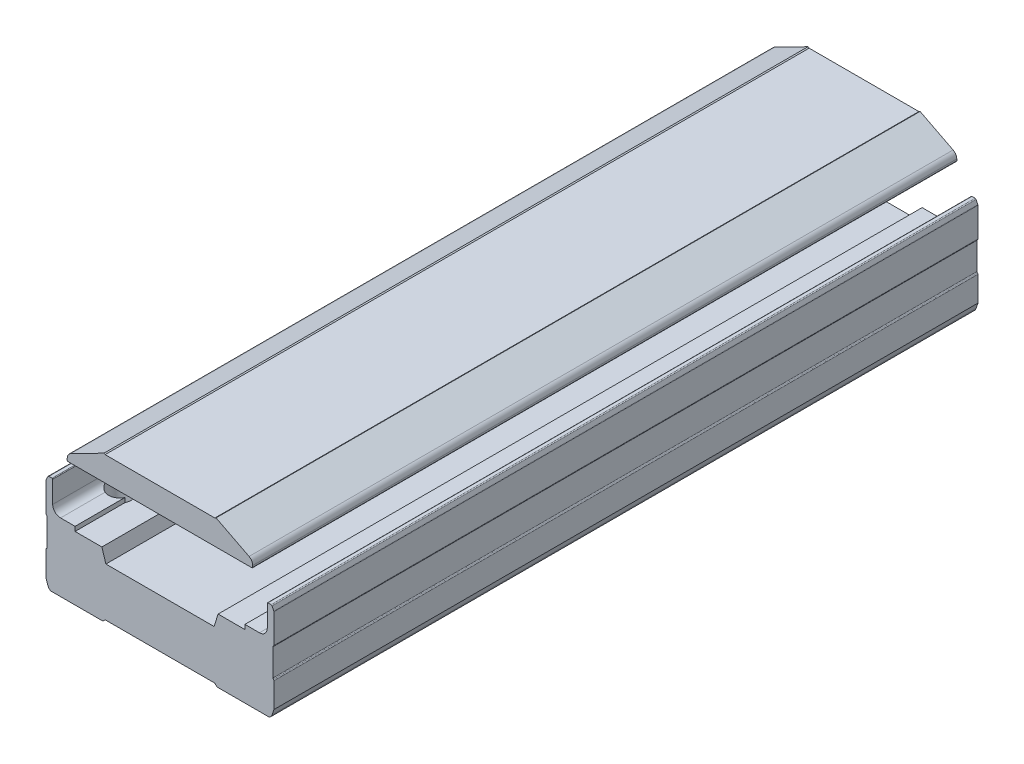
ISO-10303-21;
HEADER;
FILE_DESCRIPTION(('STEP AP214'),'2;1');
FILE_NAME('part.step','',(''),(''),'','','');
FILE_SCHEMA(('AUTOMOTIVE_DESIGN { 1 0 10303 214 1 1 1 1 }'));
ENDSEC;
DATA;
#1=APPLICATION_CONTEXT('core data for automotive mechanical design processes');
#2=APPLICATION_PROTOCOL_DEFINITION('international standard','automotive_design',2000,#1);
#3=PRODUCT_CONTEXT('',#1,'mechanical');
#4=PRODUCT('Part','Part','',(#3));
#5=PRODUCT_RELATED_PRODUCT_CATEGORY('part','',(#4));
#6=PRODUCT_DEFINITION_FORMATION('','',#4);
#7=PRODUCT_DEFINITION_CONTEXT('part definition',#1,'design');
#8=PRODUCT_DEFINITION('design','',#6,#7);
#9=PRODUCT_DEFINITION_SHAPE('','',#8);
#10=(LENGTH_UNIT() NAMED_UNIT(*) SI_UNIT(.MILLI.,.METRE.));
#11=(NAMED_UNIT(*) PLANE_ANGLE_UNIT() SI_UNIT($,.RADIAN.));
#12=(NAMED_UNIT(*) SI_UNIT($,.STERADIAN.) SOLID_ANGLE_UNIT());
#13=UNCERTAINTY_MEASURE_WITH_UNIT(LENGTH_MEASURE(1.E-05),#10,'distance_accuracy_value','');
#14=(GEOMETRIC_REPRESENTATION_CONTEXT(3) GLOBAL_UNCERTAINTY_ASSIGNED_CONTEXT((#13)) GLOBAL_UNIT_ASSIGNED_CONTEXT((#10,
#11,#12)) REPRESENTATION_CONTEXT('',''));
#15=CARTESIAN_POINT('',(0.,0.,0.));
#16=DIRECTION('',(0.,0.,1.));
#17=DIRECTION('',(1.,0.,0.));
#18=AXIS2_PLACEMENT_3D('',#15,#16,#17);
#19=CARTESIAN_POINT('',(41.0999999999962,53.3999999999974,315.));
#20=DIRECTION('',(0.,0.,-1.));
#21=DIRECTION('',(-1.,0.,0.));
#22=AXIS2_PLACEMENT_3D('',#19,#20,#21);
#23=CYLINDRICAL_SURFACE('',#22,0.400000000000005);
#24=CARTESIAN_POINT('',(41.0999999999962,53.3999999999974,0.));
#25=DIRECTION('',(0.,0.,1.));
#26=DIRECTION('',(1.,0.,0.));
#27=AXIS2_PLACEMENT_3D('',#24,#25,#26);
#28=CIRCLE('',#27,0.400000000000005);
#29=CARTESIAN_POINT('',(41.099999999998,52.9999999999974,0.));
#30=VERTEX_POINT('',#29);
#31=CARTESIAN_POINT('',(41.4999999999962,53.3999999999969,0.));
#32=VERTEX_POINT('',#31);
#33=EDGE_CURVE('E166',#30,#32,#28,.T.);
#34=ORIENTED_EDGE('',*,*,#33,.T.);
#35=DIRECTION('',(0.,0.,-1.));
#36=VECTOR('',#35,1.);
#37=CARTESIAN_POINT('',(41.4999999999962,53.3999999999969,315.));
#38=LINE('',#37,#36);
#39=CARTESIAN_POINT('',(41.4999999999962,53.3999999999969,315.));
#40=VERTEX_POINT('',#39);
#41=EDGE_CURVE('E12',#40,#32,#38,.T.);
#42=ORIENTED_EDGE('',*,*,#41,.F.);
#43=CARTESIAN_POINT('',(41.0999999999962,53.3999999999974,315.));
#44=DIRECTION('',(0.,0.,1.));
#45=DIRECTION('',(1.,0.,0.));
#46=AXIS2_PLACEMENT_3D('',#43,#44,#45);
#47=CIRCLE('',#46,0.400000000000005);
#48=CARTESIAN_POINT('',(41.099999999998,52.9999999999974,315.));
#49=VERTEX_POINT('',#48);
#50=EDGE_CURVE('E188',#49,#40,#47,.T.);
#51=ORIENTED_EDGE('',*,*,#50,.F.);
#52=DIRECTION('',(0.,0.,-1.));
#53=VECTOR('',#52,1.);
#54=CARTESIAN_POINT('',(41.099999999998,52.9999999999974,315.));
#55=LINE('',#54,#53);
#56=EDGE_CURVE('E162',#49,#30,#55,.T.);
#57=ORIENTED_EDGE('',*,*,#56,.T.);
#58=EDGE_LOOP('',(#34,#42,#51,#57));
#59=FACE_BOUND('',#58,.T.);
#60=ADVANCED_FACE('F46',(#59),#23,.T.);
#61=CARTESIAN_POINT('',(41.4999999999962,53.3999999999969,315.));
#62=DIRECTION('',(-1.,0.,0.));
#63=DIRECTION('',(0.,0.,1.));
#64=AXIS2_PLACEMENT_3D('',#61,#62,#63);
#65=PLANE('',#64);
#66=DIRECTION('',(0.,1.,0.));
#67=VECTOR('',#66,1.);
#68=CARTESIAN_POINT('',(41.4999999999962,53.3999999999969,0.));
#69=LINE('',#68,#67);
#70=CARTESIAN_POINT('',(41.4999999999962,54.0915976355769,0.));
#71=VERTEX_POINT('',#70);
#72=EDGE_CURVE('E169',#32,#71,#69,.T.);
#73=ORIENTED_EDGE('',*,*,#72,.T.);
#74=DIRECTION('',(0.,0.,-1.));
#75=VECTOR('',#74,1.);
#76=CARTESIAN_POINT('',(41.4999999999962,54.0915976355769,315.));
#77=LINE('',#76,#75);
#78=CARTESIAN_POINT('',(41.4999999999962,54.0915976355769,315.));
#79=VERTEX_POINT('',#78);
#80=EDGE_CURVE('E54',#79,#71,#77,.T.);
#81=ORIENTED_EDGE('',*,*,#80,.F.);
#82=DIRECTION('',(0.,1.,0.));
#83=VECTOR('',#82,1.);
#84=CARTESIAN_POINT('',(41.4999999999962,53.3999999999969,315.));
#85=LINE('',#84,#83);
#86=EDGE_CURVE('E117',#40,#79,#85,.T.);
#87=ORIENTED_EDGE('',*,*,#86,.F.);
#88=ORIENTED_EDGE('',*,*,#41,.T.);
#89=EDGE_LOOP('',(#73,#81,#87,#88));
#90=FACE_BOUND('',#89,.T.);
#91=ADVANCED_FACE('F266',(#90),#65,.F.);
#92=CARTESIAN_POINT('',(38.4999999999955,54.0915976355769,315.));
#93=DIRECTION('',(0.,0.,-1.));
#94=DIRECTION('',(-1.,0.,0.));
#95=AXIS2_PLACEMENT_3D('',#92,#93,#94);
#96=CYLINDRICAL_SURFACE('',#95,3.00000000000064);
#97=CARTESIAN_POINT('',(38.4999999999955,54.0915976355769,0.));
#98=DIRECTION('',(0.,0.,1.));
#99=DIRECTION('',(1.,0.,0.));
#100=AXIS2_PLACEMENT_3D('',#97,#98,#99);
#101=CIRCLE('',#100,3.00000000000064);
#102=CARTESIAN_POINT('',(39.8619714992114,56.7646172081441,0.));
#103=VERTEX_POINT('',#102);
#104=EDGE_CURVE('E171',#71,#103,#101,.T.);
#105=ORIENTED_EDGE('',*,*,#104,.T.);
#106=DIRECTION('',(0.,0.,-1.));
#107=VECTOR('',#106,1.);
#108=CARTESIAN_POINT('',(39.8619714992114,56.7646172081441,315.));
#109=LINE('',#108,#107);
#110=CARTESIAN_POINT('',(39.8619714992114,56.7646172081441,315.));
#111=VERTEX_POINT('',#110);
#112=EDGE_CURVE('E207',#111,#103,#109,.T.);
#113=ORIENTED_EDGE('',*,*,#112,.F.);
#114=CARTESIAN_POINT('',(38.4999999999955,54.0915976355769,315.));
#115=DIRECTION('',(0.,0.,1.));
#116=DIRECTION('',(1.,0.,0.));
#117=AXIS2_PLACEMENT_3D('',#114,#115,#116);
#118=CIRCLE('',#117,3.00000000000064);
#119=EDGE_CURVE('E215',#79,#111,#118,.T.);
#120=ORIENTED_EDGE('',*,*,#119,.F.);
#121=ORIENTED_EDGE('',*,*,#80,.T.);
#122=EDGE_LOOP('',(#105,#113,#120,#121));
#123=FACE_BOUND('',#122,.T.);
#124=ADVANCED_FACE('F213',(#123),#96,.T.);
#125=CARTESIAN_POINT('',(39.8619714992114,56.7646172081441,315.));
#126=DIRECTION('',(-0.453990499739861,-0.891006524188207,0.));
#127=DIRECTION('',(0.891006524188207,-0.453990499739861,0.));
#128=AXIS2_PLACEMENT_3D('',#125,#126,#127);
#129=PLANE('',#128);
#130=DIRECTION('',(-0.891006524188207,0.453990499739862,0.));
#131=VECTOR('',#130,1.);
#132=CARTESIAN_POINT('',(39.8619714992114,56.7646172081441,0.));
#133=LINE('',#132,#131);
#134=CARTESIAN_POINT('',(25.0729500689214,64.3000000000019,0.));
#135=VERTEX_POINT('',#134);
#136=EDGE_CURVE('E173',#103,#135,#133,.T.);
#137=ORIENTED_EDGE('',*,*,#136,.T.);
#138=DIRECTION('',(0.,0.,-1.));
#139=VECTOR('',#138,1.);
#140=CARTESIAN_POINT('',(25.0729500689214,64.3000000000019,315.));
#141=LINE('',#140,#139);
#142=CARTESIAN_POINT('',(25.0729500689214,64.3000000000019,315.));
#143=VERTEX_POINT('',#142);
#144=EDGE_CURVE('E204',#143,#135,#141,.T.);
#145=ORIENTED_EDGE('',*,*,#144,.F.);
#146=DIRECTION('',(-0.891006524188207,0.453990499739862,0.));
#147=VECTOR('',#146,1.);
#148=CARTESIAN_POINT('',(39.8619714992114,56.7646172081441,315.));
#149=LINE('',#148,#147);
#150=EDGE_CURVE('E233',#111,#143,#149,.T.);
#151=ORIENTED_EDGE('',*,*,#150,.F.);
#152=ORIENTED_EDGE('',*,*,#112,.T.);
#153=EDGE_LOOP('',(#137,#145,#151,#152));
#154=FACE_BOUND('',#153,.T.);
#155=ADVANCED_FACE('F224',(#154),#129,.F.);
#156=CARTESIAN_POINT('',(25.0729500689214,64.3000000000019,315.));
#157=DIRECTION('',(0.500000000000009,-0.866025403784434,0.));
#158=DIRECTION('',(0.866025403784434,0.500000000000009,0.));
#159=AXIS2_PLACEMENT_3D('',#156,#157,#158);
#160=PLANE('',#159);
#161=DIRECTION('',(-0.866025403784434,-0.500000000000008,0.));
#162=VECTOR('',#161,1.);
#163=CARTESIAN_POINT('',(25.0729500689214,64.3000000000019,0.));
#164=LINE('',#163,#162);
#165=CARTESIAN_POINT('',(24.553334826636,63.9999999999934,0.));
#166=VERTEX_POINT('',#165);
#167=EDGE_CURVE('E175',#135,#166,#164,.T.);
#168=ORIENTED_EDGE('',*,*,#167,.T.);
#169=DIRECTION('',(0.,0.,-1.));
#170=VECTOR('',#169,1.);
#171=CARTESIAN_POINT('',(24.553334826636,63.9999999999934,315.));
#172=LINE('',#171,#170);
#173=CARTESIAN_POINT('',(24.553334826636,63.9999999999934,315.));
#174=VERTEX_POINT('',#173);
#175=EDGE_CURVE('E201',#174,#166,#172,.T.);
#176=ORIENTED_EDGE('',*,*,#175,.F.);
#177=DIRECTION('',(-0.866025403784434,-0.500000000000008,0.));
#178=VECTOR('',#177,1.);
#179=CARTESIAN_POINT('',(25.0729500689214,64.3000000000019,315.));
#180=LINE('',#179,#178);
#181=EDGE_CURVE('E230',#143,#174,#180,.T.);
#182=ORIENTED_EDGE('',*,*,#181,.F.);
#183=ORIENTED_EDGE('',*,*,#144,.T.);
#184=EDGE_LOOP('',(#168,#176,#182,#183));
#185=FACE_BOUND('',#184,.T.);
#186=ADVANCED_FACE('F228',(#185),#160,.F.);
#187=CARTESIAN_POINT('',(24.553334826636,63.9999999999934,315.));
#188=DIRECTION('',(0.,-1.,0.));
#189=DIRECTION('',(0.,0.,-1.));
#190=AXIS2_PLACEMENT_3D('',#187,#188,#189);
#191=PLANE('',#190);
#192=DIRECTION('',(-1.,0.,0.));
#193=VECTOR('',#192,1.);
#194=CARTESIAN_POINT('',(24.553334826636,63.9999999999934,0.));
#195=LINE('',#194,#193);
#196=CARTESIAN_POINT('',(-24.5533348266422,63.9999999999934,0.));
#197=VERTEX_POINT('',#196);
#198=EDGE_CURVE('E177',#166,#197,#195,.T.);
#199=ORIENTED_EDGE('',*,*,#198,.T.);
#200=DIRECTION('',(0.,0.,-1.));
#201=VECTOR('',#200,1.);
#202=CARTESIAN_POINT('',(-24.5533348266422,63.9999999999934,315.));
#203=LINE('',#202,#201);
#204=CARTESIAN_POINT('',(-24.5533348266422,63.9999999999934,315.));
#205=VERTEX_POINT('',#204);
#206=EDGE_CURVE('E198',#205,#197,#203,.T.);
#207=ORIENTED_EDGE('',*,*,#206,.F.);
#208=DIRECTION('',(-1.,0.,0.));
#209=VECTOR('',#208,1.);
#210=CARTESIAN_POINT('',(24.553334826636,63.9999999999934,315.));
#211=LINE('',#210,#209);
#212=EDGE_CURVE('E232',#174,#205,#211,.T.);
#213=ORIENTED_EDGE('',*,*,#212,.F.);
#214=ORIENTED_EDGE('',*,*,#175,.T.);
#215=EDGE_LOOP('',(#199,#207,#213,#214));
#216=FACE_BOUND('',#215,.T.);
#217=ADVANCED_FACE('F279',(#216),#191,.F.);
#218=CARTESIAN_POINT('',(-24.5533348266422,63.9999999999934,315.));
#219=DIRECTION('',(-0.500000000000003,-0.866025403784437,0.));
#220=DIRECTION('',(0.866025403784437,-0.500000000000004,0.));
#221=AXIS2_PLACEMENT_3D('',#218,#219,#220);
#222=PLANE('',#221);
#223=DIRECTION('',(-0.866025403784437,0.500000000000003,0.));
#224=VECTOR('',#223,1.);
#225=CARTESIAN_POINT('',(-24.5533348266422,63.9999999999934,0.));
#226=LINE('',#225,#224);
#227=CARTESIAN_POINT('',(-25.0729500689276,64.3000000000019,0.));
#228=VERTEX_POINT('',#227);
#229=EDGE_CURVE('E179',#197,#228,#226,.T.);
#230=ORIENTED_EDGE('',*,*,#229,.T.);
#231=DIRECTION('',(0.,0.,-1.));
#232=VECTOR('',#231,1.);
#233=CARTESIAN_POINT('',(-25.0729500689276,64.3000000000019,315.));
#234=LINE('',#233,#232);
#235=CARTESIAN_POINT('',(-25.0729500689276,64.3000000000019,315.));
#236=VERTEX_POINT('',#235);
#237=EDGE_CURVE('E195',#236,#228,#234,.T.);
#238=ORIENTED_EDGE('',*,*,#237,.F.);
#239=DIRECTION('',(-0.866025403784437,0.500000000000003,0.));
#240=VECTOR('',#239,1.);
#241=CARTESIAN_POINT('',(-24.5533348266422,63.9999999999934,315.));
#242=LINE('',#241,#240);
#243=EDGE_CURVE('E235',#205,#236,#242,.T.);
#244=ORIENTED_EDGE('',*,*,#243,.F.);
#245=ORIENTED_EDGE('',*,*,#206,.T.);
#246=EDGE_LOOP('',(#230,#238,#244,#245));
#247=FACE_BOUND('',#246,.T.);
#248=ADVANCED_FACE('F282',(#247),#222,.F.);
#249=CARTESIAN_POINT('',(-25.0729500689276,64.3000000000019,315.));
#250=DIRECTION('',(0.45399049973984,-0.891006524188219,0.));
#251=DIRECTION('',(0.891006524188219,0.45399049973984,0.));
#252=AXIS2_PLACEMENT_3D('',#249,#250,#251);
#253=PLANE('',#252);
#254=DIRECTION('',(-0.891006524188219,-0.45399049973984,0.));
#255=VECTOR('',#254,1.);
#256=CARTESIAN_POINT('',(-25.0729500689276,64.3000000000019,0.));
#257=LINE('',#256,#255);
#258=CARTESIAN_POINT('',(-39.8619714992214,56.7646172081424,0.));
#259=VERTEX_POINT('',#258);
#260=EDGE_CURVE('E181',#228,#259,#257,.T.);
#261=ORIENTED_EDGE('',*,*,#260,.T.);
#262=DIRECTION('',(0.,0.,-1.));
#263=VECTOR('',#262,1.);
#264=CARTESIAN_POINT('',(-39.8619714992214,56.7646172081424,315.));
#265=LINE('',#264,#263);
#266=CARTESIAN_POINT('',(-39.8619714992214,56.7646172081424,315.));
#267=VERTEX_POINT('',#266);
#268=EDGE_CURVE('E192',#267,#259,#265,.T.);
#269=ORIENTED_EDGE('',*,*,#268,.F.);
#270=DIRECTION('',(-0.891006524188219,-0.45399049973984,0.));
#271=VECTOR('',#270,1.);
#272=CARTESIAN_POINT('',(-25.0729500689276,64.3000000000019,315.));
#273=LINE('',#272,#271);
#274=EDGE_CURVE('E241',#236,#267,#273,.T.);
#275=ORIENTED_EDGE('',*,*,#274,.F.);
#276=ORIENTED_EDGE('',*,*,#237,.T.);
#277=EDGE_LOOP('',(#261,#269,#275,#276));
#278=FACE_BOUND('',#277,.T.);
#279=ADVANCED_FACE('F247',(#278),#253,.F.);
#280=CARTESIAN_POINT('',(-38.500000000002,54.0915976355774,315.));
#281=DIRECTION('',(0.,0.,-1.));
#282=DIRECTION('',(-1.,0.,0.));
#283=AXIS2_PLACEMENT_3D('',#280,#281,#282);
#284=CYLINDRICAL_SURFACE('',#283,3.00000000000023);
#285=CARTESIAN_POINT('',(-38.500000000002,54.0915976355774,0.));
#286=DIRECTION('',(0.,0.,1.));
#287=DIRECTION('',(1.,0.,0.));
#288=AXIS2_PLACEMENT_3D('',#285,#286,#287);
#289=CIRCLE('',#288,3.00000000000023);
#290=CARTESIAN_POINT('',(-41.500000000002,54.0915976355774,0.));
#291=VERTEX_POINT('',#290);
#292=EDGE_CURVE('E183',#259,#291,#289,.T.);
#293=ORIENTED_EDGE('',*,*,#292,.T.);
#294=DIRECTION('',(0.,0.,-1.));
#295=VECTOR('',#294,1.);
#296=CARTESIAN_POINT('',(-41.500000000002,54.0915976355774,315.));
#297=LINE('',#296,#295);
#298=CARTESIAN_POINT('',(-41.500000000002,54.0915976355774,315.));
#299=VERTEX_POINT('',#298);
#300=EDGE_CURVE('E157',#299,#291,#297,.T.);
#301=ORIENTED_EDGE('',*,*,#300,.F.);
#302=CARTESIAN_POINT('',(-38.500000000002,54.0915976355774,315.));
#303=DIRECTION('',(0.,0.,1.));
#304=DIRECTION('',(1.,0.,0.));
#305=AXIS2_PLACEMENT_3D('',#302,#303,#304);
#306=CIRCLE('',#305,3.00000000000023);
#307=EDGE_CURVE('E148',#267,#299,#306,.T.);
#308=ORIENTED_EDGE('',*,*,#307,.F.);
#309=ORIENTED_EDGE('',*,*,#268,.T.);
#310=EDGE_LOOP('',(#293,#301,#308,#309));
#311=FACE_BOUND('',#310,.T.);
#312=ADVANCED_FACE('F251',(#311),#284,.T.);
#313=CARTESIAN_POINT('',(-41.500000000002,54.0915976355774,315.));
#314=DIRECTION('',(1.,0.,0.));
#315=DIRECTION('',(0.,0.,-1.));
#316=AXIS2_PLACEMENT_3D('',#313,#314,#315);
#317=PLANE('',#316);
#318=DIRECTION('',(0.,-1.,0.));
#319=VECTOR('',#318,1.);
#320=CARTESIAN_POINT('',(-41.500000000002,54.0915976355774,0.));
#321=LINE('',#320,#319);
#322=CARTESIAN_POINT('',(-41.500000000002,53.3999999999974,0.));
#323=VERTEX_POINT('',#322);
#324=EDGE_CURVE('E156',#291,#323,#321,.T.);
#325=ORIENTED_EDGE('',*,*,#324,.T.);
#326=DIRECTION('',(0.,0.,-1.));
#327=VECTOR('',#326,1.);
#328=CARTESIAN_POINT('',(-41.500000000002,53.3999999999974,315.));
#329=LINE('',#328,#327);
#330=CARTESIAN_POINT('',(-41.500000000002,53.3999999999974,315.));
#331=VERTEX_POINT('',#330);
#332=EDGE_CURVE('E153',#331,#323,#329,.T.);
#333=ORIENTED_EDGE('',*,*,#332,.F.);
#334=DIRECTION('',(0.,-1.,0.));
#335=VECTOR('',#334,1.);
#336=CARTESIAN_POINT('',(-41.500000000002,54.0915976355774,315.));
#337=LINE('',#336,#335);
#338=EDGE_CURVE('E142',#299,#331,#337,.T.);
#339=ORIENTED_EDGE('',*,*,#338,.F.);
#340=ORIENTED_EDGE('',*,*,#300,.T.);
#341=EDGE_LOOP('',(#325,#333,#339,#340));
#342=FACE_BOUND('',#341,.T.);
#343=ADVANCED_FACE('F154',(#342),#317,.F.);
#344=CARTESIAN_POINT('',(-41.100000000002,53.3999999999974,315.));
#345=DIRECTION('',(0.,0.,-1.));
#346=DIRECTION('',(-1.,0.,0.));
#347=AXIS2_PLACEMENT_3D('',#344,#345,#346);
#348=CYLINDRICAL_SURFACE('',#347,0.400000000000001);
#349=CARTESIAN_POINT('',(-41.100000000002,53.3999999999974,0.));
#350=DIRECTION('',(0.,0.,1.));
#351=DIRECTION('',(1.,0.,0.));
#352=AXIS2_PLACEMENT_3D('',#349,#350,#351);
#353=CIRCLE('',#352,0.400000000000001);
#354=CARTESIAN_POINT('',(-41.100000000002,52.9999999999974,0.));
#355=VERTEX_POINT('',#354);
#356=EDGE_CURVE('E103',#323,#355,#353,.T.);
#357=ORIENTED_EDGE('',*,*,#356,.T.);
#358=DIRECTION('',(0.,0.,-1.));
#359=VECTOR('',#358,1.);
#360=CARTESIAN_POINT('',(-41.100000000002,52.9999999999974,315.));
#361=LINE('',#360,#359);
#362=CARTESIAN_POINT('',(-41.100000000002,52.9999999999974,315.));
#363=VERTEX_POINT('',#362);
#364=EDGE_CURVE('E158',#363,#355,#361,.T.);
#365=ORIENTED_EDGE('',*,*,#364,.F.);
#366=CARTESIAN_POINT('',(-41.100000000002,53.3999999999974,315.));
#367=DIRECTION('',(0.,0.,1.));
#368=DIRECTION('',(1.,0.,0.));
#369=AXIS2_PLACEMENT_3D('',#366,#367,#368);
#370=CIRCLE('',#369,0.400000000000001);
#371=EDGE_CURVE('E146',#331,#363,#370,.T.);
#372=ORIENTED_EDGE('',*,*,#371,.F.);
#373=ORIENTED_EDGE('',*,*,#332,.T.);
#374=EDGE_LOOP('',(#357,#365,#372,#373));
#375=FACE_BOUND('',#374,.T.);
#376=ADVANCED_FACE('F160',(#375),#348,.T.);
#377=CARTESIAN_POINT('',(-41.100000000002,52.9999999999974,315.));
#378=DIRECTION('',(0.,1.,0.));
#379=DIRECTION('',(0.,0.,1.));
#380=AXIS2_PLACEMENT_3D('',#377,#378,#379);
#381=PLANE('',#380);
#382=DIRECTION('',(1.,0.,0.));
#383=VECTOR('',#382,1.);
#384=CARTESIAN_POINT('',(-41.100000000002,52.9999999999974,0.));
#385=LINE('',#384,#383);
#386=EDGE_CURVE('E109',#355,#30,#385,.T.);
#387=ORIENTED_EDGE('',*,*,#386,.T.);
#388=ORIENTED_EDGE('',*,*,#56,.F.);
#389=DIRECTION('',(1.,0.,0.));
#390=VECTOR('',#389,1.);
#391=CARTESIAN_POINT('',(-41.100000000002,52.9999999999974,315.));
#392=LINE('',#391,#390);
#393=EDGE_CURVE('E62',#363,#49,#392,.T.);
#394=ORIENTED_EDGE('',*,*,#393,.F.);
#395=ORIENTED_EDGE('',*,*,#364,.T.);
#396=EDGE_LOOP('',(#387,#388,#394,#395));
#397=FACE_BOUND('',#396,.T.);
#398=ADVANCED_FACE('F255',(#397),#381,.F.);
#399=CARTESIAN_POINT('',(41.0999999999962,53.3999999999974,315.));
#400=DIRECTION('',(0.,0.,1.));
#401=DIRECTION('',(1.,0.,0.));
#402=AXIS2_PLACEMENT_3D('',#399,#400,#401);
#403=PLANE('',#402);
#404=ORIENTED_EDGE('',*,*,#50,.T.);
#405=ORIENTED_EDGE('',*,*,#86,.T.);
#406=ORIENTED_EDGE('',*,*,#119,.T.);
#407=ORIENTED_EDGE('',*,*,#150,.T.);
#408=ORIENTED_EDGE('',*,*,#181,.T.);
#409=ORIENTED_EDGE('',*,*,#212,.T.);
#410=ORIENTED_EDGE('',*,*,#243,.T.);
#411=ORIENTED_EDGE('',*,*,#274,.T.);
#412=ORIENTED_EDGE('',*,*,#307,.T.);
#413=ORIENTED_EDGE('',*,*,#338,.T.);
#414=ORIENTED_EDGE('',*,*,#371,.T.);
#415=ORIENTED_EDGE('',*,*,#393,.T.);
#416=EDGE_LOOP('',(#404,#405,#406,#407,#408,#409,#410,#411,#412,#413,#414,#415));
#417=FACE_BOUND('',#416,.T.);
#418=ADVANCED_FACE('F144',(#417),#403,.T.);
#419=CARTESIAN_POINT('',(41.0999999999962,53.3999999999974,0.));
#420=DIRECTION('',(0.,0.,1.));
#421=DIRECTION('',(1.,0.,0.));
#422=AXIS2_PLACEMENT_3D('',#419,#420,#421);
#423=PLANE('',#422);
#424=ORIENTED_EDGE('',*,*,#33,.F.);
#425=ORIENTED_EDGE('',*,*,#386,.F.);
#426=ORIENTED_EDGE('',*,*,#356,.F.);
#427=ORIENTED_EDGE('',*,*,#324,.F.);
#428=ORIENTED_EDGE('',*,*,#292,.F.);
#429=ORIENTED_EDGE('',*,*,#260,.F.);
#430=ORIENTED_EDGE('',*,*,#229,.F.);
#431=ORIENTED_EDGE('',*,*,#198,.F.);
#432=ORIENTED_EDGE('',*,*,#167,.F.);
#433=ORIENTED_EDGE('',*,*,#136,.F.);
#434=ORIENTED_EDGE('',*,*,#104,.F.);
#435=ORIENTED_EDGE('',*,*,#72,.F.);
#436=EDGE_LOOP('',(#424,#425,#426,#427,#428,#429,#430,#431,#432,#433,#434,#435));
#437=FACE_BOUND('',#436,.T.);
#438=ADVANCED_FACE('F219',(#437),#423,.F.);
#439=CLOSED_SHELL('',(#60,#91,#124,#155,#186,#217,#248,#279,#312,#343,#376,#398,#418,#438));
#440=MANIFOLD_SOLID_BREP('B2',#439);
#441=CARTESIAN_POINT('',(-38.0000000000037,29.5,315.));
#442=DIRECTION('',(0.,-1.,0.));
#443=DIRECTION('',(0.,0.,-1.));
#444=AXIS2_PLACEMENT_3D('',#441,#442,#443);
#445=PLANE('',#444);
#446=DIRECTION('',(0.,0.,-1.));
#447=VECTOR('',#446,1.);
#448=CARTESIAN_POINT('',(-38.0000000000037,29.5,315.));
#449=LINE('',#448,#447);
#450=CARTESIAN_POINT('',(-38.0000000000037,29.5,88.320550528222));
#451=VERTEX_POINT('',#450);
#452=CARTESIAN_POINT('',(-38.0000000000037,29.5,42.679449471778));
#453=VERTEX_POINT('',#452);
#454=EDGE_CURVE('E1447',#451,#453,#449,.T.);
#455=ORIENTED_EDGE('',*,*,#454,.T.);
#456=CARTESIAN_POINT('',(-42.5,29.5,40.5));
#457=DIRECTION('',(0.,-1.,0.));
#458=DIRECTION('',(0.,0.,-1.));
#459=AXIS2_PLACEMENT_3D('',#456,#457,#458);
#460=CIRCLE('',#459,5.);
#461=CARTESIAN_POINT('',(-44.5000000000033,29.5,45.0825756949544));
#462=VERTEX_POINT('',#461);
#463=EDGE_CURVE('E853',#453,#462,#460,.T.);
#464=ORIENTED_EDGE('',*,*,#463,.T.);
#465=DIRECTION('',(0.,0.,-1.));
#466=VECTOR('',#465,1.);
#467=CARTESIAN_POINT('',(-44.5000000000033,29.5,315.));
#468=LINE('',#467,#466);
#469=CARTESIAN_POINT('',(-44.5000000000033,29.5,85.9174243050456));
#470=VERTEX_POINT('',#469);
#471=EDGE_CURVE('E2058',#470,#462,#468,.T.);
#472=ORIENTED_EDGE('',*,*,#471,.F.);
#473=CARTESIAN_POINT('',(-42.5,29.5,90.5));
#474=DIRECTION('',(0.,-1.,0.));
#475=DIRECTION('',(0.,0.,-1.));
#476=AXIS2_PLACEMENT_3D('',#473,#474,#475);
#477=CIRCLE('',#476,5.);
#478=EDGE_CURVE('E404',#470,#451,#477,.T.);
#479=ORIENTED_EDGE('',*,*,#478,.T.);
#480=EDGE_LOOP('',(#455,#464,#472,#479));
#481=FACE_BOUND('',#480,.T.);
#482=ADVANCED_FACE('F377',(#481),#445,.F.);
#483=CARTESIAN_POINT('',(-38.0000000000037,27.5000000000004,315.));
#484=DIRECTION('',(-1.,0.,0.));
#485=DIRECTION('',(0.,0.,1.));
#486=AXIS2_PLACEMENT_3D('',#483,#484,#485);
#487=PLANE('',#486);
#488=DIRECTION('',(0.,0.,-1.));
#489=VECTOR('',#488,1.);
#490=CARTESIAN_POINT('',(-38.0000000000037,27.5000000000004,315.));
#491=LINE('',#490,#489);
#492=CARTESIAN_POINT('',(-38.0000000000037,27.5000000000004,88.320550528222));
#493=VERTEX_POINT('',#492);
#494=CARTESIAN_POINT('',(-38.0000000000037,27.5000000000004,42.679449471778));
#495=VERTEX_POINT('',#494);
#496=EDGE_CURVE('E1437',#493,#495,#491,.T.);
#497=ORIENTED_EDGE('',*,*,#496,.T.);
#498=DIRECTION('',(0.,1.,0.));
#499=VECTOR('',#498,1.);
#500=CARTESIAN_POINT('',(-38.0000000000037,42.9999999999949,42.679449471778));
#501=LINE('',#500,#499);
#502=EDGE_CURVE('E854',#495,#453,#501,.T.);
#503=ORIENTED_EDGE('',*,*,#502,.T.);
#504=ORIENTED_EDGE('',*,*,#454,.F.);
#505=DIRECTION('',(0.,1.,0.));
#506=VECTOR('',#505,1.);
#507=CARTESIAN_POINT('',(-38.0000000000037,42.9999999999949,88.320550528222));
#508=LINE('',#507,#506);
#509=EDGE_CURVE('E874',#451,#493,#508,.F.);
#510=ORIENTED_EDGE('',*,*,#509,.T.);
#511=EDGE_LOOP('',(#497,#503,#504,#510));
#512=FACE_BOUND('',#511,.T.);
#513=ADVANCED_FACE('F1388',(#512),#487,.F.);
#514=CARTESIAN_POINT('',(-38.0000000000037,27.5000000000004,288.320550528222));
#515=VERTEX_POINT('',#514);
#516=CARTESIAN_POINT('',(-38.0000000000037,27.5000000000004,92.679449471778));
#517=VERTEX_POINT('',#516);
#518=EDGE_CURVE('E1307',#515,#517,#491,.T.);
#519=ORIENTED_EDGE('',*,*,#518,.T.);
#520=DIRECTION('',(0.,1.,0.));
#521=VECTOR('',#520,1.);
#522=CARTESIAN_POINT('',(-38.0000000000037,42.9999999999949,92.679449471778));
#523=LINE('',#522,#521);
#524=CARTESIAN_POINT('',(-38.0000000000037,29.5,92.679449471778));
#525=VERTEX_POINT('',#524);
#526=EDGE_CURVE('E880',#517,#525,#523,.T.);
#527=ORIENTED_EDGE('',*,*,#526,.T.);
#528=CARTESIAN_POINT('',(-38.0000000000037,29.5,288.320550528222));
#529=VERTEX_POINT('',#528);
#530=EDGE_CURVE('E1302',#529,#525,#449,.T.);
#531=ORIENTED_EDGE('',*,*,#530,.F.);
#532=DIRECTION('',(0.,1.,0.));
#533=VECTOR('',#532,1.);
#534=CARTESIAN_POINT('',(-38.0000000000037,42.9999999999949,288.320550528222));
#535=LINE('',#534,#533);
#536=EDGE_CURVE('E902',#529,#515,#535,.F.);
#537=ORIENTED_EDGE('',*,*,#536,.T.);
#538=EDGE_LOOP('',(#519,#527,#531,#537));
#539=FACE_BOUND('',#538,.T.);
#540=ADVANCED_FACE('F1396',(#539),#487,.F.);
#541=ORIENTED_EDGE('',*,*,#530,.T.);
#542=CARTESIAN_POINT('',(-44.5000000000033,29.5,95.0825756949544));
#543=VERTEX_POINT('',#542);
#544=EDGE_CURVE('E873',#525,#543,#477,.T.);
#545=ORIENTED_EDGE('',*,*,#544,.T.);
#546=CARTESIAN_POINT('',(-44.5000000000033,29.5,285.917424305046));
#547=VERTEX_POINT('',#546);
#548=EDGE_CURVE('E1297',#547,#543,#468,.T.);
#549=ORIENTED_EDGE('',*,*,#548,.F.);
#550=CARTESIAN_POINT('',(-42.5,29.5,290.5));
#551=DIRECTION('',(0.,-1.,0.));
#552=DIRECTION('',(0.,0.,-1.));
#553=AXIS2_PLACEMENT_3D('',#550,#551,#552);
#554=CIRCLE('',#553,5.);
#555=EDGE_CURVE('E892',#547,#529,#554,.T.);
#556=ORIENTED_EDGE('',*,*,#555,.T.);
#557=EDGE_LOOP('',(#541,#545,#549,#556));
#558=FACE_BOUND('',#557,.T.);
#559=ADVANCED_FACE('F1391',(#558),#445,.F.);
#560=CARTESIAN_POINT('',(-38.0000000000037,29.5,315.));
#561=VERTEX_POINT('',#560);
#562=CARTESIAN_POINT('',(-38.0000000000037,29.5,292.679449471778));
#563=VERTEX_POINT('',#562);
#564=EDGE_CURVE('E1298',#561,#563,#449,.T.);
#565=ORIENTED_EDGE('',*,*,#564,.T.);
#566=CARTESIAN_POINT('',(-44.5000000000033,29.5,295.082575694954));
#567=VERTEX_POINT('',#566);
#568=EDGE_CURVE('E895',#563,#567,#554,.T.);
#569=ORIENTED_EDGE('',*,*,#568,.T.);
#570=CARTESIAN_POINT('',(-44.5000000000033,29.5,315.));
#571=VERTEX_POINT('',#570);
#572=EDGE_CURVE('E1293',#571,#567,#468,.T.);
#573=ORIENTED_EDGE('',*,*,#572,.F.);
#574=DIRECTION('',(-1.,0.,0.));
#575=VECTOR('',#574,1.);
#576=CARTESIAN_POINT('',(-38.0000000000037,29.5,315.));
#577=LINE('',#576,#575);
#578=EDGE_CURVE('E982',#561,#571,#577,.T.);
#579=ORIENTED_EDGE('',*,*,#578,.F.);
#580=EDGE_LOOP('',(#565,#569,#573,#579));
#581=FACE_BOUND('',#580,.T.);
#582=ADVANCED_FACE('F1402',(#581),#445,.F.);
#583=CARTESIAN_POINT('',(-38.0000000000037,27.5000000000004,315.));
#584=VERTEX_POINT('',#583);
#585=CARTESIAN_POINT('',(-38.0000000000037,27.5000000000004,292.679449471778));
#586=VERTEX_POINT('',#585);
#587=EDGE_CURVE('E1303',#584,#586,#491,.T.);
#588=ORIENTED_EDGE('',*,*,#587,.T.);
#589=DIRECTION('',(0.,1.,0.));
#590=VECTOR('',#589,1.);
#591=CARTESIAN_POINT('',(-38.0000000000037,42.9999999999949,292.679449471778));
#592=LINE('',#591,#590);
#593=EDGE_CURVE('E896',#586,#563,#592,.T.);
#594=ORIENTED_EDGE('',*,*,#593,.T.);
#595=ORIENTED_EDGE('',*,*,#564,.F.);
#596=DIRECTION('',(0.,1.,0.));
#597=VECTOR('',#596,1.);
#598=CARTESIAN_POINT('',(-38.0000000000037,27.5000000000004,315.));
#599=LINE('',#598,#597);
#600=EDGE_CURVE('E980',#584,#561,#599,.T.);
#601=ORIENTED_EDGE('',*,*,#600,.F.);
#602=EDGE_LOOP('',(#588,#594,#595,#601));
#603=FACE_BOUND('',#602,.T.);
#604=ADVANCED_FACE('F1381',(#603),#487,.F.);
#605=CARTESIAN_POINT('',(44.4999999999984,29.4999999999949,315.));
#606=DIRECTION('',(0.,-1.,0.));
#607=DIRECTION('',(0.,0.,-1.));
#608=AXIS2_PLACEMENT_3D('',#605,#606,#607);
#609=PLANE('',#608);
#610=DIRECTION('',(0.,0.,-1.));
#611=VECTOR('',#610,1.);
#612=CARTESIAN_POINT('',(44.4999999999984,29.4999999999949,315.));
#613=LINE('',#612,#611);
#614=CARTESIAN_POINT('',(44.4999999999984,29.4999999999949,315.));
#615=VERTEX_POINT('',#614);
#616=CARTESIAN_POINT('',(44.4999999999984,29.4999999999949,295.082575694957));
#617=VERTEX_POINT('',#616);
#618=EDGE_CURVE('E1180',#615,#617,#613,.T.);
#619=ORIENTED_EDGE('',*,*,#618,.T.);
#620=CARTESIAN_POINT('',(42.5000000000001,29.4999999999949,290.5));
#621=DIRECTION('',(0.,-1.,0.));
#622=DIRECTION('',(0.,0.,-1.));
#623=AXIS2_PLACEMENT_3D('',#620,#621,#622);
#624=CIRCLE('',#623,5.);
#625=CARTESIAN_POINT('',(37.9999999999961,29.4999999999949,292.679449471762));
#626=VERTEX_POINT('',#625);
#627=EDGE_CURVE('E917',#617,#626,#624,.T.);
#628=ORIENTED_EDGE('',*,*,#627,.T.);
#629=DIRECTION('',(0.,0.,-1.));
#630=VECTOR('',#629,1.);
#631=CARTESIAN_POINT('',(37.9999999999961,29.4999999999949,315.));
#632=LINE('',#631,#630);
#633=CARTESIAN_POINT('',(37.9999999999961,29.4999999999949,315.));
#634=VERTEX_POINT('',#633);
#635=EDGE_CURVE('E1175',#634,#626,#632,.T.);
#636=ORIENTED_EDGE('',*,*,#635,.F.);
#637=DIRECTION('',(-1.,0.,0.));
#638=VECTOR('',#637,1.);
#639=CARTESIAN_POINT('',(44.4999999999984,29.4999999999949,315.));
#640=LINE('',#639,#638);
#641=EDGE_CURVE('E1058',#615,#634,#640,.T.);
#642=ORIENTED_EDGE('',*,*,#641,.F.);
#643=EDGE_LOOP('',(#619,#628,#636,#642));
#644=FACE_BOUND('',#643,.T.);
#645=ADVANCED_FACE('F1372',(#644),#609,.F.);
#646=CARTESIAN_POINT('',(37.9999999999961,29.4999999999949,315.));
#647=DIRECTION('',(1.,0.,0.));
#648=DIRECTION('',(0.,0.,-1.));
#649=AXIS2_PLACEMENT_3D('',#646,#647,#648);
#650=PLANE('',#649);
#651=DIRECTION('',(0.,0.,-1.));
#652=VECTOR('',#651,1.);
#653=CARTESIAN_POINT('',(37.9999999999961,27.5000000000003,315.));
#654=LINE('',#653,#652);
#655=CARTESIAN_POINT('',(37.9999999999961,27.5000000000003,288.320550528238));
#656=VERTEX_POINT('',#655);
#657=CARTESIAN_POINT('',(37.9999999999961,27.5000000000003,92.6794494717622));
#658=VERTEX_POINT('',#657);
#659=EDGE_CURVE('E1174',#656,#658,#654,.T.);
#660=ORIENTED_EDGE('',*,*,#659,.F.);
#661=DIRECTION('',(0.,1.,0.));
#662=VECTOR('',#661,1.);
#663=CARTESIAN_POINT('',(37.9999999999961,42.9999999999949,288.320550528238));
#664=LINE('',#663,#662);
#665=CARTESIAN_POINT('',(37.9999999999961,29.4999999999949,288.320550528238));
#666=VERTEX_POINT('',#665);
#667=EDGE_CURVE('E924',#656,#666,#664,.T.);
#668=ORIENTED_EDGE('',*,*,#667,.T.);
#669=CARTESIAN_POINT('',(37.9999999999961,29.4999999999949,92.6794494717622));
#670=VERTEX_POINT('',#669);
#671=EDGE_CURVE('E1179',#666,#670,#632,.T.);
#672=ORIENTED_EDGE('',*,*,#671,.T.);
#673=DIRECTION('',(0.,1.,0.));
#674=VECTOR('',#673,1.);
#675=CARTESIAN_POINT('',(37.9999999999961,42.9999999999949,92.6794494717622));
#676=LINE('',#675,#674);
#677=EDGE_CURVE('E946',#670,#658,#676,.F.);
#678=ORIENTED_EDGE('',*,*,#677,.T.);
#679=EDGE_LOOP('',(#660,#668,#672,#678));
#680=FACE_BOUND('',#679,.T.);
#681=ADVANCED_FACE('F1368',(#680),#650,.F.);
#682=ORIENTED_EDGE('',*,*,#671,.F.);
#683=CARTESIAN_POINT('',(44.4999999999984,29.4999999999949,285.917424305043));
#684=VERTEX_POINT('',#683);
#685=EDGE_CURVE('E914',#666,#684,#624,.T.);
#686=ORIENTED_EDGE('',*,*,#685,.T.);
#687=CARTESIAN_POINT('',(44.4999999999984,29.4999999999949,95.0825756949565));
#688=VERTEX_POINT('',#687);
#689=EDGE_CURVE('E1184',#684,#688,#613,.T.);
#690=ORIENTED_EDGE('',*,*,#689,.T.);
#691=CARTESIAN_POINT('',(42.5,29.4999999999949,90.5));
#692=DIRECTION('',(0.,-1.,0.));
#693=DIRECTION('',(0.,0.,-1.));
#694=AXIS2_PLACEMENT_3D('',#691,#692,#693);
#695=CIRCLE('',#694,5.);
#696=EDGE_CURVE('E939',#688,#670,#695,.T.);
#697=ORIENTED_EDGE('',*,*,#696,.T.);
#698=EDGE_LOOP('',(#682,#686,#690,#697));
#699=FACE_BOUND('',#698,.T.);
#700=ADVANCED_FACE('F1383',(#699),#609,.F.);
#701=CARTESIAN_POINT('',(37.9999999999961,27.5000000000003,88.3205505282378));
#702=VERTEX_POINT('',#701);
#703=CARTESIAN_POINT('',(37.9999999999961,27.5000000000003,42.6794494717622));
#704=VERTEX_POINT('',#703);
#705=EDGE_CURVE('E1561',#702,#704,#654,.T.);
#706=ORIENTED_EDGE('',*,*,#705,.F.);
#707=DIRECTION('',(0.,1.,0.));
#708=VECTOR('',#707,1.);
#709=CARTESIAN_POINT('',(37.9999999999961,42.9999999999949,88.3205505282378));
#710=LINE('',#709,#708);
#711=CARTESIAN_POINT('',(37.9999999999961,29.4999999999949,88.3205505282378));
#712=VERTEX_POINT('',#711);
#713=EDGE_CURVE('E940',#702,#712,#710,.T.);
#714=ORIENTED_EDGE('',*,*,#713,.T.);
#715=CARTESIAN_POINT('',(37.9999999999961,29.4999999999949,42.6794494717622));
#716=VERTEX_POINT('',#715);
#717=EDGE_CURVE('E1524',#712,#716,#632,.T.);
#718=ORIENTED_EDGE('',*,*,#717,.T.);
#719=DIRECTION('',(0.,1.,0.));
#720=VECTOR('',#719,1.);
#721=CARTESIAN_POINT('',(37.9999999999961,42.9999999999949,42.6794494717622));
#722=LINE('',#721,#720);
#723=EDGE_CURVE('E962',#716,#704,#722,.F.);
#724=ORIENTED_EDGE('',*,*,#723,.T.);
#725=EDGE_LOOP('',(#706,#714,#718,#724));
#726=FACE_BOUND('',#725,.T.);
#727=ADVANCED_FACE('F1385',(#726),#650,.F.);
#728=ORIENTED_EDGE('',*,*,#717,.F.);
#729=CARTESIAN_POINT('',(44.4999999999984,29.4999999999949,85.9174243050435));
#730=VERTEX_POINT('',#729);
#731=EDGE_CURVE('E936',#712,#730,#695,.T.);
#732=ORIENTED_EDGE('',*,*,#731,.T.);
#733=CARTESIAN_POINT('',(44.4999999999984,29.4999999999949,45.0825756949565));
#734=VERTEX_POINT('',#733);
#735=EDGE_CURVE('E1516',#730,#734,#613,.T.);
#736=ORIENTED_EDGE('',*,*,#735,.T.);
#737=CARTESIAN_POINT('',(42.5,29.4999999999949,40.5));
#738=DIRECTION('',(0.,-1.,0.));
#739=DIRECTION('',(0.,0.,-1.));
#740=AXIS2_PLACEMENT_3D('',#737,#738,#739);
#741=CIRCLE('',#740,5.);
#742=EDGE_CURVE('E961',#734,#716,#741,.T.);
#743=ORIENTED_EDGE('',*,*,#742,.T.);
#744=EDGE_LOOP('',(#728,#732,#736,#743));
#745=FACE_BOUND('',#744,.T.);
#746=ADVANCED_FACE('F1373',(#745),#609,.F.);
#747=CARTESIAN_POINT('',(37.9999999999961,27.5000000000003,38.3205505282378));
#748=VERTEX_POINT('',#747);
#749=CARTESIAN_POINT('',(37.9999999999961,27.5000000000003,0.));
#750=VERTEX_POINT('',#749);
#751=EDGE_CURVE('E1169',#748,#750,#654,.T.);
#752=ORIENTED_EDGE('',*,*,#751,.F.);
#753=DIRECTION('',(0.,1.,0.));
#754=VECTOR('',#753,1.);
#755=CARTESIAN_POINT('',(37.9999999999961,42.9999999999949,38.3205505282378));
#756=LINE('',#755,#754);
#757=CARTESIAN_POINT('',(37.9999999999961,29.4999999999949,38.3205505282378));
#758=VERTEX_POINT('',#757);
#759=EDGE_CURVE('E965',#748,#758,#756,.T.);
#760=ORIENTED_EDGE('',*,*,#759,.T.);
#761=CARTESIAN_POINT('',(37.9999999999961,29.4999999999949,0.));
#762=VERTEX_POINT('',#761);
#763=EDGE_CURVE('E1173',#758,#762,#632,.T.);
#764=ORIENTED_EDGE('',*,*,#763,.T.);
#765=DIRECTION('',(0.,-1.,0.));
#766=VECTOR('',#765,1.);
#767=CARTESIAN_POINT('',(37.9999999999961,29.4999999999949,0.));
#768=LINE('',#767,#766);
#769=EDGE_CURVE('E1158',#762,#750,#768,.T.);
#770=ORIENTED_EDGE('',*,*,#769,.T.);
#771=EDGE_LOOP('',(#752,#760,#764,#770));
#772=FACE_BOUND('',#771,.T.);
#773=ADVANCED_FACE('F1369',(#772),#650,.F.);
#774=CARTESIAN_POINT('',(24.1966438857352,21.7804851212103,315.));
#775=DIRECTION('',(0.,-1.,0.));
#776=DIRECTION('',(0.,0.,-1.));
#777=AXIS2_PLACEMENT_3D('',#774,#775,#776);
#778=PLANE('',#777);
#779=DIRECTION('',(-1.,0.,0.));
#780=VECTOR('',#779,1.);
#781=CARTESIAN_POINT('',(24.1966438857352,21.7804851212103,0.));
#782=LINE('',#781,#780);
#783=CARTESIAN_POINT('',(24.1966438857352,21.7804851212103,0.));
#784=VERTEX_POINT('',#783);
#785=CARTESIAN_POINT('',(-24.1966438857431,21.7804851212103,0.));
#786=VERTEX_POINT('',#785);
#787=EDGE_CURVE('E971',#784,#786,#782,.T.);
#788=ORIENTED_EDGE('',*,*,#787,.T.);
#789=DIRECTION('',(0.,0.,-1.));
#790=VECTOR('',#789,1.);
#791=CARTESIAN_POINT('',(-24.1966438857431,21.7804851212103,315.));
#792=LINE('',#791,#790);
#793=CARTESIAN_POINT('',(-24.1966438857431,21.7804851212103,315.));
#794=VERTEX_POINT('',#793);
#795=EDGE_CURVE('E1310',#794,#786,#792,.T.);
#796=ORIENTED_EDGE('',*,*,#795,.F.);
#797=DIRECTION('',(-1.,0.,0.));
#798=VECTOR('',#797,1.);
#799=CARTESIAN_POINT('',(24.1966438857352,21.7804851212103,315.));
#800=LINE('',#799,#798);
#801=CARTESIAN_POINT('',(24.1966438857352,21.7804851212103,315.));
#802=VERTEX_POINT('',#801);
#803=EDGE_CURVE('E972',#802,#794,#800,.T.);
#804=ORIENTED_EDGE('',*,*,#803,.F.);
#805=DIRECTION('',(0.,0.,-1.));
#806=VECTOR('',#805,1.);
#807=CARTESIAN_POINT('',(24.1966438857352,21.7804851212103,315.));
#808=LINE('',#807,#806);
#809=EDGE_CURVE('E1066',#802,#784,#808,.T.);
#810=ORIENTED_EDGE('',*,*,#809,.T.);
#811=EDGE_LOOP('',(#788,#796,#804,#810));
#812=FACE_BOUND('',#811,.T.);
#813=ADVANCED_FACE('F379',(#812),#778,.F.);
#814=CARTESIAN_POINT('',(-24.1966438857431,21.7804851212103,315.));
#815=DIRECTION('',(-0.953716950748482,-0.300705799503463,0.));
#816=DIRECTION('',(0.300705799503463,-0.953716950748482,0.));
#817=AXIS2_PLACEMENT_3D('',#814,#815,#816);
#818=PLANE('',#817);
#819=DIRECTION('',(-0.300705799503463,0.953716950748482,0.));
#820=VECTOR('',#819,1.);
#821=CARTESIAN_POINT('',(-24.1966438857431,21.7804851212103,0.));
#822=LINE('',#821,#820);
#823=CARTESIAN_POINT('',(-25.9999999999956,27.5000000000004,0.));
#824=VERTEX_POINT('',#823);
#825=EDGE_CURVE('E1069',#786,#824,#822,.T.);
#826=ORIENTED_EDGE('',*,*,#825,.T.);
#827=DIRECTION('',(0.,0.,-1.));
#828=VECTOR('',#827,1.);
#829=CARTESIAN_POINT('',(-25.9999999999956,27.5000000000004,315.));
#830=LINE('',#829,#828);
#831=CARTESIAN_POINT('',(-25.9999999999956,27.5000000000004,315.));
#832=VERTEX_POINT('',#831);
#833=EDGE_CURVE('E1306',#832,#824,#830,.T.);
#834=ORIENTED_EDGE('',*,*,#833,.F.);
#835=DIRECTION('',(-0.300705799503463,0.953716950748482,0.));
#836=VECTOR('',#835,1.);
#837=CARTESIAN_POINT('',(-24.1966438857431,21.7804851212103,315.));
#838=LINE('',#837,#836);
#839=EDGE_CURVE('E975',#794,#832,#838,.T.);
#840=ORIENTED_EDGE('',*,*,#839,.F.);
#841=ORIENTED_EDGE('',*,*,#795,.T.);
#842=EDGE_LOOP('',(#826,#834,#840,#841));
#843=FACE_BOUND('',#842,.T.);
#844=ADVANCED_FACE('F1606',(#843),#818,.F.);
#845=CARTESIAN_POINT('',(-25.9999999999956,27.5000000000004,315.));
#846=DIRECTION('',(0.,-1.,0.));
#847=DIRECTION('',(0.,0.,-1.));
#848=AXIS2_PLACEMENT_3D('',#845,#846,#847);
#849=PLANE('',#848);
#850=CARTESIAN_POINT('',(-38.0000000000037,27.5000000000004,38.320550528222));
#851=VERTEX_POINT('',#850);
#852=CARTESIAN_POINT('',(-38.0000000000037,27.5000000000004,0.));
#853=VERTEX_POINT('',#852);
#854=EDGE_CURVE('E1301',#851,#853,#491,.T.);
#855=ORIENTED_EDGE('',*,*,#854,.F.);
#856=CARTESIAN_POINT('',(-42.5,27.5000000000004,40.5));
#857=DIRECTION('',(0.,-1.,0.));
#858=DIRECTION('',(0.,0.,-1.));
#859=AXIS2_PLACEMENT_3D('',#856,#857,#858);
#860=CIRCLE('',#859,5.);
#861=EDGE_CURVE('E860',#851,#495,#860,.T.);
#862=ORIENTED_EDGE('',*,*,#861,.T.);
#863=ORIENTED_EDGE('',*,*,#496,.F.);
#864=CARTESIAN_POINT('',(-42.5,27.5000000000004,90.5));
#865=DIRECTION('',(0.,-1.,0.));
#866=DIRECTION('',(0.,0.,-1.));
#867=AXIS2_PLACEMENT_3D('',#864,#865,#866);
#868=CIRCLE('',#867,5.);
#869=EDGE_CURVE('E877',#493,#517,#868,.T.);
#870=ORIENTED_EDGE('',*,*,#869,.T.);
#871=ORIENTED_EDGE('',*,*,#518,.F.);
#872=CARTESIAN_POINT('',(-42.5,27.5000000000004,290.5));
#873=DIRECTION('',(0.,-1.,0.));
#874=DIRECTION('',(0.,0.,-1.));
#875=AXIS2_PLACEMENT_3D('',#872,#873,#874);
#876=CIRCLE('',#875,5.);
#877=EDGE_CURVE('E899',#515,#586,#876,.T.);
#878=ORIENTED_EDGE('',*,*,#877,.T.);
#879=ORIENTED_EDGE('',*,*,#587,.F.);
#880=DIRECTION('',(-1.,0.,0.));
#881=VECTOR('',#880,1.);
#882=CARTESIAN_POINT('',(-25.9999999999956,27.5000000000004,315.));
#883=LINE('',#882,#881);
#884=EDGE_CURVE('E978',#832,#584,#883,.T.);
#885=ORIENTED_EDGE('',*,*,#884,.F.);
#886=ORIENTED_EDGE('',*,*,#833,.T.);
#887=DIRECTION('',(-1.,0.,0.));
#888=VECTOR('',#887,1.);
#889=CARTESIAN_POINT('',(-25.9999999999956,27.5000000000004,0.));
#890=LINE('',#889,#888);
#891=EDGE_CURVE('E1071',#824,#853,#890,.T.);
#892=ORIENTED_EDGE('',*,*,#891,.T.);
#893=EDGE_LOOP('',(#855,#862,#863,#870,#871,#878,#879,#885,#886,#892));
#894=FACE_BOUND('',#893,.T.);
#895=ADVANCED_FACE('F1413',(#894),#849,.F.);
#896=CARTESIAN_POINT('',(-38.0000000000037,29.5,38.320550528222));
#897=VERTEX_POINT('',#896);
#898=CARTESIAN_POINT('',(-38.0000000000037,29.5,0.));
#899=VERTEX_POINT('',#898);
#900=EDGE_CURVE('E1296',#897,#899,#449,.T.);
#901=ORIENTED_EDGE('',*,*,#900,.F.);
#902=DIRECTION('',(0.,1.,0.));
#903=VECTOR('',#902,1.);
#904=CARTESIAN_POINT('',(-38.0000000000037,42.9999999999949,38.320550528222));
#905=LINE('',#904,#903);
#906=EDGE_CURVE('E857',#897,#851,#905,.F.);
#907=ORIENTED_EDGE('',*,*,#906,.T.);
#908=ORIENTED_EDGE('',*,*,#854,.T.);
#909=DIRECTION('',(0.,1.,0.));
#910=VECTOR('',#909,1.);
#911=CARTESIAN_POINT('',(-38.0000000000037,27.5000000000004,0.));
#912=LINE('',#911,#910);
#913=EDGE_CURVE('E1074',#853,#899,#912,.T.);
#914=ORIENTED_EDGE('',*,*,#913,.T.);
#915=EDGE_LOOP('',(#901,#907,#908,#914));
#916=FACE_BOUND('',#915,.T.);
#917=ADVANCED_FACE('F1399',(#916),#487,.F.);
#918=CARTESIAN_POINT('',(-44.5000000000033,29.5,35.9174243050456));
#919=VERTEX_POINT('',#918);
#920=CARTESIAN_POINT('',(-44.5000000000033,29.5,0.));
#921=VERTEX_POINT('',#920);
#922=EDGE_CURVE('E1292',#919,#921,#468,.T.);
#923=ORIENTED_EDGE('',*,*,#922,.F.);
#924=EDGE_CURVE('E397',#919,#897,#460,.T.);
#925=ORIENTED_EDGE('',*,*,#924,.T.);
#926=ORIENTED_EDGE('',*,*,#900,.T.);
#927=DIRECTION('',(-1.,0.,0.));
#928=VECTOR('',#927,1.);
#929=CARTESIAN_POINT('',(-38.0000000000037,29.5,0.));
#930=LINE('',#929,#928);
#931=EDGE_CURVE('E1077',#899,#921,#930,.T.);
#932=ORIENTED_EDGE('',*,*,#931,.T.);
#933=EDGE_LOOP('',(#923,#925,#926,#932));
#934=FACE_BOUND('',#933,.T.);
#935=ADVANCED_FACE('F1392',(#934),#445,.F.);
#936=CARTESIAN_POINT('',(-44.5000000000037,33.,315.));
#937=DIRECTION('',(0.,0.,-1.));
#938=DIRECTION('',(-1.,0.,0.));
#939=AXIS2_PLACEMENT_3D('',#936,#937,#938);
#940=CYLINDRICAL_SURFACE('',#939,3.5);
#941=ORIENTED_EDGE('',*,*,#471,.T.);
#942=CARTESIAN_POINT('',(-44.5000000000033,29.5,45.0825756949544));
#943=CARTESIAN_POINT('',(-44.5991709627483,29.4999864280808,45.0393218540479));
#944=CARTESIAN_POINT('',(-44.6968522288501,29.5042129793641,44.9928321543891));
#945=CARTESIAN_POINT('',(-44.8883599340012,29.5202922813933,44.8940024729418));
#946=CARTESIAN_POINT('',(-44.9821926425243,29.5321320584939,44.8416725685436));
#947=CARTESIAN_POINT('',(-45.1645222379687,29.5624319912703,44.7322020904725));
#948=CARTESIAN_POINT('',(-45.2530642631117,29.5808224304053,44.6751168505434));
#949=CARTESIAN_POINT('',(-45.4254703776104,29.6234052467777,44.556179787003));
#950=CARTESIAN_POINT('',(-45.5093320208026,29.6476006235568,44.494325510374));
#951=CARTESIAN_POINT('',(-45.6927802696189,29.7077641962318,44.3500672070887));
#952=CARTESIAN_POINT('',(-45.7909370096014,29.7451614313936,44.2664396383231));
#953=CARTESIAN_POINT('',(-45.9791819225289,29.826274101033,44.0932811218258));
#954=CARTESIAN_POINT('',(-46.0692639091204,29.8699943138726,44.0037457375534));
#955=CARTESIAN_POINT('',(-46.2416074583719,29.962499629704,43.819095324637));
#956=CARTESIAN_POINT('',(-46.3238333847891,30.0113058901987,43.7239577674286));
#957=CARTESIAN_POINT('',(-46.4800443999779,30.1124271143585,43.5290008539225));
#958=CARTESIAN_POINT('',(-46.5540327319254,30.1647406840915,43.4291833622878));
#959=CARTESIAN_POINT('',(-46.6956131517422,30.2728394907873,43.2226616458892));
#960=CARTESIAN_POINT('',(-46.7630056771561,30.3286782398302,43.1158489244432));
#961=CARTESIAN_POINT('',(-46.8893978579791,30.4411074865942,42.8977239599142));
#962=CARTESIAN_POINT('',(-46.9483959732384,30.4976981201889,42.786410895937));
#963=CARTESIAN_POINT('',(-47.0579643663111,30.6098223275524,42.55933109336));
#964=CARTESIAN_POINT('',(-47.1085420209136,30.6653567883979,42.4435683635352));
#965=CARTESIAN_POINT('',(-47.2011959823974,30.7732089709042,42.2072915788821));
#966=CARTESIAN_POINT('',(-47.2432758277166,30.8255280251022,42.0867795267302));
#967=CARTESIAN_POINT('',(-47.3287603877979,30.9374128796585,41.8075830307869));
#968=CARTESIAN_POINT('',(-47.3695007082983,30.9951658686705,41.6473204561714));
#969=CARTESIAN_POINT('',(-47.4353695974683,31.0928678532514,41.3185177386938));
#970=CARTESIAN_POINT('',(-47.4605515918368,31.1328776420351,41.1500080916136));
#971=CARTESIAN_POINT('',(-47.4854223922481,31.1731192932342,40.8914828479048));
#972=CARTESIAN_POINT('',(-47.4915578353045,31.1832367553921,40.8035953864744));
#973=CARTESIAN_POINT('',(-47.4991645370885,31.1958178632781,40.6270628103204));
#974=CARTESIAN_POINT('',(-47.5006365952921,31.1982828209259,40.5384178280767));
#975=CARTESIAN_POINT('',(-47.4988602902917,31.1953288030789,40.3612724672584));
#976=CARTESIAN_POINT('',(-47.4956099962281,31.1899066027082,40.2727721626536));
#977=CARTESIAN_POINT('',(-47.4845013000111,31.1716502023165,40.0968481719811));
#978=CARTESIAN_POINT('',(-47.4766417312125,31.1588141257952,40.0094247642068));
#979=CARTESIAN_POINT('',(-47.443119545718,31.1052711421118,39.7210426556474));
#980=CARTESIAN_POINT('',(-47.40768338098,31.0502052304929,39.5237909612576));
#981=CARTESIAN_POINT('',(-47.3388882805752,30.9524861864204,39.2370789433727));
#982=CARTESIAN_POINT('',(-47.3132494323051,30.917264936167,39.1427677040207));
#983=CARTESIAN_POINT('',(-47.2569619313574,30.843307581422,38.957050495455));
#984=CARTESIAN_POINT('',(-47.2263146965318,30.8045724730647,38.8656437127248));
#985=CARTESIAN_POINT('',(-47.1404509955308,30.7011239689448,38.6319283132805));
#986=CARTESIAN_POINT('',(-47.0814800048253,30.6346908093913,38.4917627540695));
#987=CARTESIAN_POINT('',(-46.9514252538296,30.5001406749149,38.2179432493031));
#988=CARTESIAN_POINT('',(-46.8803347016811,30.4320227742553,38.0842930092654));
#989=CARTESIAN_POINT('',(-46.7261236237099,30.2972522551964,37.8236666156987));
#990=CARTESIAN_POINT('',(-46.6430229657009,30.2305974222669,37.696679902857));
#991=CARTESIAN_POINT('',(-46.4645501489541,30.1012597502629,37.4494958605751));
#992=CARTESIAN_POINT('',(-46.3691785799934,30.0385767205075,37.3292982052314));
#993=CARTESIAN_POINT('',(-46.1246572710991,29.8955018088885,37.0490429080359));
#994=CARTESIAN_POINT('',(-45.9693919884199,29.8182493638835,36.8926094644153));
#995=CARTESIAN_POINT('',(-45.6349074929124,29.6842414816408,36.5985137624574));
#996=CARTESIAN_POINT('',(-45.4557861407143,29.6274056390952,36.46077922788));
#997=CARTESIAN_POINT('',(-45.1461582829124,29.5579792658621,36.2551804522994));
#998=CARTESIAN_POINT('',(-45.0222116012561,29.5367981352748,36.1803298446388));
#999=CARTESIAN_POINT('',(-44.8305744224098,29.5150489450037,36.0757760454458));
#1000=CARTESIAN_POINT('',(-44.7655709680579,29.509468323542,36.0421366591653));
#1001=CARTESIAN_POINT('',(-44.6339372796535,29.5019414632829,35.9776446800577));
#1002=CARTESIAN_POINT('',(-44.567305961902,29.4999977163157,35.9467940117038));
#1003=CARTESIAN_POINT('',(-44.5000000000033,29.5,35.9174243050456));
#1004=B_SPLINE_CURVE_WITH_KNOTS('',3,(#942,#943,#944,#945,#946,#947,#948,#949,#950,#951,#952,
#953,#954,#955,#956,#957,#958,#959,#960,#961,#962,#963,#964,#965,#966,#967,#968,#969,#970,#971,
#972,#973,#974,#975,#976,#977,#978,#979,#980,#981,#982,#983,#984,#985,#986,#987,#988,#989,#990,
#991,#992,#993,#994,#995,#996,#997,#998,#999,#1000,#1001,#1002,#1003),.UNSPECIFIED.,.F.,.F.,(4,
2,2,2,2,2,2,2,2,2,2,2,2,2,2,2,2,2,2,2,2,2,2,2,2,2,2,2,2,2,4),(0.,0.324334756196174,
0.648118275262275,0.968554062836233,1.28915578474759,1.69135217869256,2.09385412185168,
2.49810286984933,2.90219189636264,3.31611825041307,3.73012045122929,4.14375803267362,
4.55722302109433,5.08144045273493,5.60384762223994,5.86948743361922,6.13508170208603,
6.40078459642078,6.66655477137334,7.28594589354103,7.5975104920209,7.90898704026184,
8.40616474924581,8.90362200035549,9.40026555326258,9.89688524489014,10.5950848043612,
11.290503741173,11.728405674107,11.948471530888,12.1686881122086),.UNSPECIFIED.);
#1005=EDGE_CURVE('E44',#462,#919,#1004,.T.);
#1006=ORIENTED_EDGE('',*,*,#1005,.T.);
#1007=ORIENTED_EDGE('',*,*,#922,.T.);
#1008=CARTESIAN_POINT('',(-44.5000000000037,33.,0.));
#1009=DIRECTION('',(0.,0.,-1.));
#1010=DIRECTION('',(1.,0.,0.));
#1011=AXIS2_PLACEMENT_3D('',#1008,#1009,#1010);
#1012=CIRCLE('',#1011,3.5);
#1013=CARTESIAN_POINT('',(-48.0000000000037,33.,0.));
#1014=VERTEX_POINT('',#1013);
#1015=EDGE_CURVE('E1080',#921,#1014,#1012,.T.);
#1016=ORIENTED_EDGE('',*,*,#1015,.T.);
#1017=DIRECTION('',(0.,0.,-1.));
#1018=VECTOR('',#1017,1.);
#1019=CARTESIAN_POINT('',(-48.0000000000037,33.,315.));
#1020=LINE('',#1019,#1018);
#1021=CARTESIAN_POINT('',(-48.0000000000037,33.,315.));
#1022=VERTEX_POINT('',#1021);
#1023=EDGE_CURVE('E1289',#1022,#1014,#1020,.T.);
#1024=ORIENTED_EDGE('',*,*,#1023,.F.);
#1025=CARTESIAN_POINT('',(-44.5000000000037,33.,315.));
#1026=DIRECTION('',(0.,0.,-1.));
#1027=DIRECTION('',(1.,0.,0.));
#1028=AXIS2_PLACEMENT_3D('',#1025,#1026,#1027);
#1029=CIRCLE('',#1028,3.5);
#1030=EDGE_CURVE('E984',#571,#1022,#1029,.T.);
#1031=ORIENTED_EDGE('',*,*,#1030,.F.);
#1032=ORIENTED_EDGE('',*,*,#572,.T.);
#1033=CARTESIAN_POINT('',(-44.5000000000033,29.5,295.082575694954));
#1034=CARTESIAN_POINT('',(-44.5991709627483,29.4999864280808,295.039321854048));
#1035=CARTESIAN_POINT('',(-44.6968522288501,29.5042129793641,294.992832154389));
#1036=CARTESIAN_POINT('',(-44.8883599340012,29.5202922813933,294.894002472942));
#1037=CARTESIAN_POINT('',(-44.9821926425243,29.5321320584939,294.841672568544));
#1038=CARTESIAN_POINT('',(-45.1645222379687,29.5624319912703,294.732202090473));
#1039=CARTESIAN_POINT('',(-45.2530642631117,29.5808224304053,294.675116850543));
#1040=CARTESIAN_POINT('',(-45.4254703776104,29.6234052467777,294.556179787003));
#1041=CARTESIAN_POINT('',(-45.5093320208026,29.6476006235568,294.494325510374));
#1042=CARTESIAN_POINT('',(-45.6927802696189,29.7077641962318,294.350067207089));
#1043=CARTESIAN_POINT('',(-45.7909370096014,29.7451614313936,294.266439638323));
#1044=CARTESIAN_POINT('',(-45.9791819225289,29.826274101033,294.093281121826));
#1045=CARTESIAN_POINT('',(-46.0692639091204,29.8699943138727,294.003745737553));
#1046=CARTESIAN_POINT('',(-46.2416074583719,29.962499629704,293.819095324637));
#1047=CARTESIAN_POINT('',(-46.3238333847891,30.0113058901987,293.723957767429));
#1048=CARTESIAN_POINT('',(-46.4800443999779,30.1124271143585,293.529000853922));
#1049=CARTESIAN_POINT('',(-46.5540327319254,30.1647406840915,293.429183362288));
#1050=CARTESIAN_POINT('',(-46.6956131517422,30.2728394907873,293.222661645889));
#1051=CARTESIAN_POINT('',(-46.7630056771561,30.3286782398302,293.115848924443));
#1052=CARTESIAN_POINT('',(-46.8893978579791,30.4411074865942,292.897723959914));
#1053=CARTESIAN_POINT('',(-46.9483959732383,30.4976981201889,292.786410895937));
#1054=CARTESIAN_POINT('',(-47.0579643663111,30.6098223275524,292.55933109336));
#1055=CARTESIAN_POINT('',(-47.1085420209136,30.6653567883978,292.443568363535));
#1056=CARTESIAN_POINT('',(-47.2011959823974,30.7732089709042,292.207291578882));
#1057=CARTESIAN_POINT('',(-47.2432758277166,30.8255280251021,292.08677952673));
#1058=CARTESIAN_POINT('',(-47.3287603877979,30.9374128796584,291.807583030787));
#1059=CARTESIAN_POINT('',(-47.3695007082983,30.9951658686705,291.647320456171));
#1060=CARTESIAN_POINT('',(-47.4353695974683,31.0928678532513,291.318517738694));
#1061=CARTESIAN_POINT('',(-47.4605515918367,31.1328776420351,291.150008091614));
#1062=CARTESIAN_POINT('',(-47.4854223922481,31.1731192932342,290.891482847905));
#1063=CARTESIAN_POINT('',(-47.4915578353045,31.1832367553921,290.803595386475));
#1064=CARTESIAN_POINT('',(-47.4991645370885,31.1958178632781,290.627062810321));
#1065=CARTESIAN_POINT('',(-47.5006365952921,31.1982828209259,290.538417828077));
#1066=CARTESIAN_POINT('',(-47.4988602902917,31.195328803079,290.361272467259));
#1067=CARTESIAN_POINT('',(-47.4956099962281,31.1899066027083,290.272772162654));
#1068=CARTESIAN_POINT('',(-47.4845013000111,31.1716502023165,290.096848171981));
#1069=CARTESIAN_POINT('',(-47.4766417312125,31.1588141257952,290.009424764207));
#1070=CARTESIAN_POINT('',(-47.4431195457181,31.1052711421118,289.721042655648));
#1071=CARTESIAN_POINT('',(-47.40768338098,31.0502052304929,289.523790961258));
#1072=CARTESIAN_POINT('',(-47.3388882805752,30.9524861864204,289.237078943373));
#1073=CARTESIAN_POINT('',(-47.3132494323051,30.9172649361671,289.142767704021));
#1074=CARTESIAN_POINT('',(-47.2569619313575,30.8433075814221,288.957050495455));
#1075=CARTESIAN_POINT('',(-47.2263146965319,30.8045724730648,288.865643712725));
#1076=CARTESIAN_POINT('',(-47.1404509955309,30.7011239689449,288.631928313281));
#1077=CARTESIAN_POINT('',(-47.0814800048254,30.6346908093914,288.49176275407));
#1078=CARTESIAN_POINT('',(-46.9514252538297,30.500140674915,288.217943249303));
#1079=CARTESIAN_POINT('',(-46.8803347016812,30.4320227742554,288.084293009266));
#1080=CARTESIAN_POINT('',(-46.7261236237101,30.2972522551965,287.823666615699));
#1081=CARTESIAN_POINT('',(-46.643022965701,30.230597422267,287.696679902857));
#1082=CARTESIAN_POINT('',(-46.4645501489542,30.101259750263,287.449495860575));
#1083=CARTESIAN_POINT('',(-46.3691785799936,30.0385767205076,287.329298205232));
#1084=CARTESIAN_POINT('',(-46.1246572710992,29.8955018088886,287.049042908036));
#1085=CARTESIAN_POINT('',(-45.96939198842,29.8182493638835,286.892609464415));
#1086=CARTESIAN_POINT('',(-45.6349074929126,29.6842414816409,286.598513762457));
#1087=CARTESIAN_POINT('',(-45.4557861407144,29.6274056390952,286.46077922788));
#1088=CARTESIAN_POINT('',(-45.1461582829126,29.5579792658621,286.255180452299));
#1089=CARTESIAN_POINT('',(-45.0222116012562,29.5367981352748,286.180329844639));
#1090=CARTESIAN_POINT('',(-44.8305744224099,29.5150489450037,286.075776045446));
#1091=CARTESIAN_POINT('',(-44.765570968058,29.509468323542,286.042136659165));
#1092=CARTESIAN_POINT('',(-44.6339372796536,29.5019414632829,285.977644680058));
#1093=CARTESIAN_POINT('',(-44.5673059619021,29.4999977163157,285.946794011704));
#1094=CARTESIAN_POINT('',(-44.5000000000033,29.5,285.917424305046));
#1095=B_SPLINE_CURVE_WITH_KNOTS('',3,(#1033,#1034,#1035,#1036,#1037,#1038,#1039,#1040,#1041,
#1042,#1043,#1044,#1045,#1046,#1047,#1048,#1049,#1050,#1051,#1052,#1053,#1054,#1055,#1056,#1057,
#1058,#1059,#1060,#1061,#1062,#1063,#1064,#1065,#1066,#1067,#1068,#1069,#1070,#1071,#1072,#1073,
#1074,#1075,#1076,#1077,#1078,#1079,#1080,#1081,#1082,#1083,#1084,#1085,#1086,#1087,#1088,#1089,
#1090,#1091,#1092,#1093,#1094),.UNSPECIFIED.,.F.,.F.,(4,2,2,2,2,2,2,2,2,2,2,2,2,2,2,2,2,2,2,2,2,
2,2,2,2,2,2,2,2,2,4),(0.,0.324334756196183,0.648118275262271,0.968554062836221,1.28915578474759,
1.69135217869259,2.09385412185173,2.4981028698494,2.90219189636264,3.31611825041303,
3.73012045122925,4.14375803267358,4.55722302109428,5.08144045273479,5.6038476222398,
5.86948743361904,6.13508170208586,6.40078459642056,6.66655477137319,7.28594589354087,
7.59751049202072,7.9089870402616,8.40616474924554,8.90362200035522,9.40026555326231,
9.89688524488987,10.595084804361,11.2905037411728,11.7284056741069,11.9484715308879,
12.1686881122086),.UNSPECIFIED.);
#1096=EDGE_CURVE('E1458',#567,#547,#1095,.T.);
#1097=ORIENTED_EDGE('',*,*,#1096,.T.);
#1098=ORIENTED_EDGE('',*,*,#548,.T.);
#1099=CARTESIAN_POINT('',(-44.5000000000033,29.5,95.0825756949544));
#1100=CARTESIAN_POINT('',(-44.5991709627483,29.4999864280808,95.0393218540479));
#1101=CARTESIAN_POINT('',(-44.6968522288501,29.5042129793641,94.9928321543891));
#1102=CARTESIAN_POINT('',(-44.8883599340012,29.5202922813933,94.8940024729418));
#1103=CARTESIAN_POINT('',(-44.9821926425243,29.5321320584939,94.8416725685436));
#1104=CARTESIAN_POINT('',(-45.1645222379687,29.5624319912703,94.7322020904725));
#1105=CARTESIAN_POINT('',(-45.2530642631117,29.5808224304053,94.6751168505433));
#1106=CARTESIAN_POINT('',(-45.4254703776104,29.6234052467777,94.556179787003));
#1107=CARTESIAN_POINT('',(-45.5093320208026,29.6476006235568,94.494325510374));
#1108=CARTESIAN_POINT('',(-45.6927802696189,29.7077641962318,94.3500672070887));
#1109=CARTESIAN_POINT('',(-45.7909370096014,29.7451614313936,94.2664396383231));
#1110=CARTESIAN_POINT('',(-45.9791819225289,29.826274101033,94.0932811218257));
#1111=CARTESIAN_POINT('',(-46.0692639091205,29.8699943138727,94.0037457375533));
#1112=CARTESIAN_POINT('',(-46.2416074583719,29.962499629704,93.8190953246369));
#1113=CARTESIAN_POINT('',(-46.3238333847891,30.0113058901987,93.7239577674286));
#1114=CARTESIAN_POINT('',(-46.4800443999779,30.1124271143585,93.5290008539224));
#1115=CARTESIAN_POINT('',(-46.5540327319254,30.1647406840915,93.4291833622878));
#1116=CARTESIAN_POINT('',(-46.6956131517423,30.2728394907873,93.2226616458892));
#1117=CARTESIAN_POINT('',(-46.7630056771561,30.3286782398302,93.1158489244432));
#1118=CARTESIAN_POINT('',(-46.8893978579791,30.4411074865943,92.8977239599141));
#1119=CARTESIAN_POINT('',(-46.9483959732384,30.4976981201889,92.786410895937));
#1120=CARTESIAN_POINT('',(-47.0579643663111,30.6098223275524,92.55933109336));
#1121=CARTESIAN_POINT('',(-47.1085420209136,30.6653567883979,92.4435683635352));
#1122=CARTESIAN_POINT('',(-47.2011959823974,30.7732089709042,92.207291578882));
#1123=CARTESIAN_POINT('',(-47.2432758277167,30.8255280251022,92.0867795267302));
#1124=CARTESIAN_POINT('',(-47.3287603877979,30.9374128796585,91.8075830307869));
#1125=CARTESIAN_POINT('',(-47.3695007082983,30.9951658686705,91.6473204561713));
#1126=CARTESIAN_POINT('',(-47.4353695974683,31.0928678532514,91.3185177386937));
#1127=CARTESIAN_POINT('',(-47.4605515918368,31.1328776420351,91.1500080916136));
#1128=CARTESIAN_POINT('',(-47.4854223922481,31.1731192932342,90.8914828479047));
#1129=CARTESIAN_POINT('',(-47.4915578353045,31.1832367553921,90.8035953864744));
#1130=CARTESIAN_POINT('',(-47.4991645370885,31.1958178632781,90.6270628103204));
#1131=CARTESIAN_POINT('',(-47.5006365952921,31.1982828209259,90.5384178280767));
#1132=CARTESIAN_POINT('',(-47.4988602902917,31.1953288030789,90.3612724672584));
#1133=CARTESIAN_POINT('',(-47.4956099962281,31.1899066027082,90.2727721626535));
#1134=CARTESIAN_POINT('',(-47.4845013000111,31.1716502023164,90.0968481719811));
#1135=CARTESIAN_POINT('',(-47.4766417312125,31.1588141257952,90.0094247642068));
#1136=CARTESIAN_POINT('',(-47.443119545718,31.1052711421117,89.7210426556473));
#1137=CARTESIAN_POINT('',(-47.40768338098,31.0502052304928,89.5237909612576));
#1138=CARTESIAN_POINT('',(-47.3388882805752,30.9524861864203,89.2370789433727));
#1139=CARTESIAN_POINT('',(-47.3132494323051,30.917264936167,89.1427677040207));
#1140=CARTESIAN_POINT('',(-47.2569619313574,30.843307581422,88.957050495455));
#1141=CARTESIAN_POINT('',(-47.2263146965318,30.8045724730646,88.8656437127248));
#1142=CARTESIAN_POINT('',(-47.1404509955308,30.7011239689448,88.6319283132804));
#1143=CARTESIAN_POINT('',(-47.0814800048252,30.6346908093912,88.4917627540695));
#1144=CARTESIAN_POINT('',(-46.9514252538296,30.5001406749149,88.2179432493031));
#1145=CARTESIAN_POINT('',(-46.880334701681,30.4320227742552,88.0842930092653));
#1146=CARTESIAN_POINT('',(-46.7261236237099,30.2972522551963,87.8236666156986));
#1147=CARTESIAN_POINT('',(-46.6430229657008,30.2305974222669,87.696679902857));
#1148=CARTESIAN_POINT('',(-46.464550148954,30.1012597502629,87.449495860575));
#1149=CARTESIAN_POINT('',(-46.3691785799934,30.0385767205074,87.3292982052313));
#1150=CARTESIAN_POINT('',(-46.124657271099,29.8955018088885,87.0490429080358));
#1151=CARTESIAN_POINT('',(-45.9693919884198,29.8182493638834,86.8926094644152));
#1152=CARTESIAN_POINT('',(-45.6349074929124,29.6842414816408,86.5985137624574));
#1153=CARTESIAN_POINT('',(-45.4557861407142,29.6274056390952,86.46077922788));
#1154=CARTESIAN_POINT('',(-45.1461582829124,29.5579792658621,86.2551804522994));
#1155=CARTESIAN_POINT('',(-45.0222116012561,29.5367981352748,86.1803298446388));
#1156=CARTESIAN_POINT('',(-44.8305744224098,29.5150489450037,86.0757760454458));
#1157=CARTESIAN_POINT('',(-44.7655709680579,29.509468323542,86.0421366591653));
#1158=CARTESIAN_POINT('',(-44.6339372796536,29.5019414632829,85.9776446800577));
#1159=CARTESIAN_POINT('',(-44.567305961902,29.4999977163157,85.9467940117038));
#1160=CARTESIAN_POINT('',(-44.5000000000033,29.5,85.9174243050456));
#1161=B_SPLINE_CURVE_WITH_KNOTS('',3,(#1099,#1100,#1101,#1102,#1103,#1104,#1105,#1106,#1107,
#1108,#1109,#1110,#1111,#1112,#1113,#1114,#1115,#1116,#1117,#1118,#1119,#1120,#1121,#1122,#1123,
#1124,#1125,#1126,#1127,#1128,#1129,#1130,#1131,#1132,#1133,#1134,#1135,#1136,#1137,#1138,#1139,
#1140,#1141,#1142,#1143,#1144,#1145,#1146,#1147,#1148,#1149,#1150,#1151,#1152,#1153,#1154,#1155,
#1156,#1157,#1158,#1159,#1160),.UNSPECIFIED.,.F.,.F.,(4,2,2,2,2,2,2,2,2,2,2,2,2,2,2,2,2,2,2,2,2,
2,2,2,2,2,2,2,2,2,4),(0.,0.324334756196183,0.648118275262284,0.968554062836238,1.2891557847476,
1.69135217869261,2.09385412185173,2.49810286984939,2.90219189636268,3.31611825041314,
3.73012045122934,4.14375803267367,4.55722302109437,5.08144045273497,5.60384762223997,
5.86948743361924,6.13508170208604,6.40078459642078,6.66655477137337,7.28594589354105,
7.59751049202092,7.90898704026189,8.40616474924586,8.90362200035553,9.40026555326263,
9.89688524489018,10.5950848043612,11.290503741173,11.728405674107,11.9484715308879,
12.1686881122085),.UNSPECIFIED.);
#1162=EDGE_CURVE('E390',#543,#470,#1161,.T.);
#1163=ORIENTED_EDGE('',*,*,#1162,.T.);
#1164=EDGE_LOOP('',(#941,#1006,#1007,#1016,#1024,#1031,#1032,#1097,#1098,#1163));
#1165=FACE_BOUND('',#1164,.T.);
#1166=ADVANCED_FACE('F1405',(#1165),#940,.F.);
#1167=CARTESIAN_POINT('',(-48.0000000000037,33.,315.));
#1168=DIRECTION('',(-1.,0.,0.));
#1169=DIRECTION('',(0.,0.,1.));
#1170=AXIS2_PLACEMENT_3D('',#1167,#1168,#1169);
#1171=PLANE('',#1170);
#1172=DIRECTION('',(0.,1.,0.));
#1173=VECTOR('',#1172,1.);
#1174=CARTESIAN_POINT('',(-48.0000000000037,33.,0.));
#1175=LINE('',#1174,#1173);
#1176=CARTESIAN_POINT('',(-48.0000000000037,42.6999999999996,0.));
#1177=VERTEX_POINT('',#1176);
#1178=EDGE_CURVE('E1082',#1014,#1177,#1175,.T.);
#1179=ORIENTED_EDGE('',*,*,#1178,.T.);
#1180=DIRECTION('',(0.,0.,-1.));
#1181=VECTOR('',#1180,1.);
#1182=CARTESIAN_POINT('',(-48.0000000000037,42.6999999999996,315.));
#1183=LINE('',#1182,#1181);
#1184=CARTESIAN_POINT('',(-48.0000000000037,42.6999999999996,315.));
#1185=VERTEX_POINT('',#1184);
#1186=EDGE_CURVE('E1286',#1185,#1177,#1183,.T.);
#1187=ORIENTED_EDGE('',*,*,#1186,.F.);
#1188=DIRECTION('',(0.,1.,0.));
#1189=VECTOR('',#1188,1.);
#1190=CARTESIAN_POINT('',(-48.0000000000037,33.,315.));
#1191=LINE('',#1190,#1189);
#1192=EDGE_CURVE('E986',#1022,#1185,#1191,.T.);
#1193=ORIENTED_EDGE('',*,*,#1192,.F.);
#1194=ORIENTED_EDGE('',*,*,#1023,.T.);
#1195=EDGE_LOOP('',(#1179,#1187,#1193,#1194));
#1196=FACE_BOUND('',#1195,.T.);
#1197=ADVANCED_FACE('F1411',(#1196),#1171,.F.);
#1198=CARTESIAN_POINT('',(-48.3000000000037,42.7,315.));
#1199=DIRECTION('',(0.,0.,-1.));
#1200=DIRECTION('',(-1.,0.,0.));
#1201=AXIS2_PLACEMENT_3D('',#1198,#1199,#1200);
#1202=CYLINDRICAL_SURFACE('',#1201,0.299999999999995);
#1203=CARTESIAN_POINT('',(-48.3000000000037,42.7,0.));
#1204=DIRECTION('',(0.,0.,1.));
#1205=DIRECTION('',(1.,0.,0.));
#1206=AXIS2_PLACEMENT_3D('',#1203,#1204,#1205);
#1207=CIRCLE('',#1206,0.299999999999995);
#1208=CARTESIAN_POINT('',(-48.3000000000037,43.,0.));
#1209=VERTEX_POINT('',#1208);
#1210=EDGE_CURVE('E1084',#1177,#1209,#1207,.T.);
#1211=ORIENTED_EDGE('',*,*,#1210,.T.);
#1212=DIRECTION('',(0.,0.,-1.));
#1213=VECTOR('',#1212,1.);
#1214=CARTESIAN_POINT('',(-48.3000000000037,43.,315.));
#1215=LINE('',#1214,#1213);
#1216=CARTESIAN_POINT('',(-48.3000000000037,43.,315.));
#1217=VERTEX_POINT('',#1216);
#1218=EDGE_CURVE('E1283',#1217,#1209,#1215,.T.);
#1219=ORIENTED_EDGE('',*,*,#1218,.F.);
#1220=CARTESIAN_POINT('',(-48.3000000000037,42.7,315.));
#1221=DIRECTION('',(0.,0.,1.));
#1222=DIRECTION('',(1.,0.,0.));
#1223=AXIS2_PLACEMENT_3D('',#1220,#1221,#1222);
#1224=CIRCLE('',#1223,0.299999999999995);
#1225=EDGE_CURVE('E988',#1185,#1217,#1224,.T.);
#1226=ORIENTED_EDGE('',*,*,#1225,.F.);
#1227=ORIENTED_EDGE('',*,*,#1186,.T.);
#1228=EDGE_LOOP('',(#1211,#1219,#1226,#1227));
#1229=FACE_BOUND('',#1228,.T.);
#1230=ADVANCED_FACE('F2052',(#1229),#1202,.T.);
#1231=CARTESIAN_POINT('',(-48.3000000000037,43.,315.));
#1232=DIRECTION('',(0.,-1.,0.));
#1233=DIRECTION('',(0.,0.,-1.));
#1234=AXIS2_PLACEMENT_3D('',#1231,#1232,#1233);
#1235=PLANE('',#1234);
#1236=DIRECTION('',(-1.,0.,0.));
#1237=VECTOR('',#1236,1.);
#1238=CARTESIAN_POINT('',(-48.3000000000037,43.,0.));
#1239=LINE('',#1238,#1237);
#1240=CARTESIAN_POINT('',(-49.6909830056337,43.,0.));
#1241=VERTEX_POINT('',#1240);
#1242=EDGE_CURVE('E1086',#1209,#1241,#1239,.T.);
#1243=ORIENTED_EDGE('',*,*,#1242,.T.);
#1244=DIRECTION('',(0.,0.,-1.));
#1245=VECTOR('',#1244,1.);
#1246=CARTESIAN_POINT('',(-49.6909830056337,43.,315.));
#1247=LINE('',#1246,#1245);
#1248=CARTESIAN_POINT('',(-49.6909830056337,43.,315.));
#1249=VERTEX_POINT('',#1248);
#1250=EDGE_CURVE('E1280',#1249,#1241,#1247,.T.);
#1251=ORIENTED_EDGE('',*,*,#1250,.F.);
#1252=DIRECTION('',(-1.,0.,0.));
#1253=VECTOR('',#1252,1.);
#1254=CARTESIAN_POINT('',(-48.3000000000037,43.,315.));
#1255=LINE('',#1254,#1253);
#1256=EDGE_CURVE('E990',#1217,#1249,#1255,.T.);
#1257=ORIENTED_EDGE('',*,*,#1256,.F.);
#1258=ORIENTED_EDGE('',*,*,#1218,.T.);
#1259=EDGE_LOOP('',(#1243,#1251,#1257,#1258));
#1260=FACE_BOUND('',#1259,.T.);
#1261=ADVANCED_FACE('F2047',(#1260),#1235,.F.);
#1262=CARTESIAN_POINT('',(-49.6909830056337,42.5000000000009,315.));
#1263=DIRECTION('',(0.,0.,-1.));
#1264=DIRECTION('',(-1.,0.,0.));
#1265=AXIS2_PLACEMENT_3D('',#1262,#1263,#1264);
#1266=CYLINDRICAL_SURFACE('',#1265,0.499999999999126);
#1267=CARTESIAN_POINT('',(-49.6909830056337,42.5000000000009,0.));
#1268=DIRECTION('',(0.,0.,1.));
#1269=DIRECTION('',(1.,0.,0.));
#1270=AXIS2_PLACEMENT_3D('',#1267,#1268,#1269);
#1271=CIRCLE('',#1270,0.499999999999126);
#1272=CARTESIAN_POINT('',(-50.1381966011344,42.7236067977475,0.));
#1273=VERTEX_POINT('',#1272);
#1274=EDGE_CURVE('E1088',#1241,#1273,#1271,.T.);
#1275=ORIENTED_EDGE('',*,*,#1274,.T.);
#1276=DIRECTION('',(0.,0.,-1.));
#1277=VECTOR('',#1276,1.);
#1278=CARTESIAN_POINT('',(-50.1381966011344,42.7236067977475,315.));
#1279=LINE('',#1278,#1277);
#1280=CARTESIAN_POINT('',(-50.1381966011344,42.7236067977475,315.));
#1281=VERTEX_POINT('',#1280);
#1282=EDGE_CURVE('E1277',#1281,#1273,#1279,.T.);
#1283=ORIENTED_EDGE('',*,*,#1282,.F.);
#1284=CARTESIAN_POINT('',(-49.6909830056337,42.5000000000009,315.));
#1285=DIRECTION('',(0.,0.,1.));
#1286=DIRECTION('',(1.,0.,0.));
#1287=AXIS2_PLACEMENT_3D('',#1284,#1285,#1286);
#1288=CIRCLE('',#1287,0.499999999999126);
#1289=EDGE_CURVE('E992',#1249,#1281,#1288,.T.);
#1290=ORIENTED_EDGE('',*,*,#1289,.F.);
#1291=ORIENTED_EDGE('',*,*,#1250,.T.);
#1292=EDGE_LOOP('',(#1275,#1283,#1290,#1291));
#1293=FACE_BOUND('',#1292,.T.);
#1294=ADVANCED_FACE('F2042',(#1293),#1266,.T.);
#1295=CARTESIAN_POINT('',(-50.1381966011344,42.7236067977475,315.));
#1296=DIRECTION('',(0.894427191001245,-0.447213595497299,0.));
#1297=DIRECTION('',(0.447213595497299,0.894427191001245,0.));
#1298=AXIS2_PLACEMENT_3D('',#1295,#1296,#1297);
#1299=PLANE('',#1298);
#1300=DIRECTION('',(-0.447213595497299,-0.894427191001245,0.));
#1301=VECTOR('',#1300,1.);
#1302=CARTESIAN_POINT('',(-50.1381966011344,42.7236067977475,0.));
#1303=LINE('',#1302,#1301);
#1304=CARTESIAN_POINT('',(-50.9472135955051,41.1055728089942,0.));
#1305=VERTEX_POINT('',#1304);
#1306=EDGE_CURVE('E1090',#1273,#1305,#1303,.T.);
#1307=ORIENTED_EDGE('',*,*,#1306,.T.);
#1308=DIRECTION('',(0.,0.,-1.));
#1309=VECTOR('',#1308,1.);
#1310=CARTESIAN_POINT('',(-50.9472135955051,41.1055728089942,315.));
#1311=LINE('',#1310,#1309);
#1312=CARTESIAN_POINT('',(-50.9472135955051,41.1055728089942,315.));
#1313=VERTEX_POINT('',#1312);
#1314=EDGE_CURVE('E1274',#1313,#1305,#1311,.T.);
#1315=ORIENTED_EDGE('',*,*,#1314,.F.);
#1316=DIRECTION('',(-0.447213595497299,-0.894427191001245,0.));
#1317=VECTOR('',#1316,1.);
#1318=CARTESIAN_POINT('',(-50.1381966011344,42.7236067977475,315.));
#1319=LINE('',#1318,#1317);
#1320=EDGE_CURVE('E994',#1281,#1313,#1319,.T.);
#1321=ORIENTED_EDGE('',*,*,#1320,.F.);
#1322=ORIENTED_EDGE('',*,*,#1282,.T.);
#1323=EDGE_LOOP('',(#1307,#1315,#1321,#1322));
#1324=FACE_BOUND('',#1323,.T.);
#1325=ADVANCED_FACE('F2038',(#1324),#1299,.F.);
#1326=CARTESIAN_POINT('',(-50.5000000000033,40.8819660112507,315.));
#1327=DIRECTION('',(0.,0.,-1.));
#1328=DIRECTION('',(-1.,0.,0.));
#1329=AXIS2_PLACEMENT_3D('',#1326,#1327,#1328);
#1330=CYLINDRICAL_SURFACE('',#1329,0.499999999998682);
#1331=CARTESIAN_POINT('',(-50.5000000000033,40.8819660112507,0.));
#1332=DIRECTION('',(0.,0.,1.));
#1333=DIRECTION('',(1.,0.,0.));
#1334=AXIS2_PLACEMENT_3D('',#1331,#1332,#1333);
#1335=CIRCLE('',#1334,0.499999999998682);
#1336=CARTESIAN_POINT('',(-51.000000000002,40.8819660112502,0.));
#1337=VERTEX_POINT('',#1336);
#1338=EDGE_CURVE('E1092',#1305,#1337,#1335,.T.);
#1339=ORIENTED_EDGE('',*,*,#1338,.T.);
#1340=DIRECTION('',(0.,0.,-1.));
#1341=VECTOR('',#1340,1.);
#1342=CARTESIAN_POINT('',(-51.000000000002,40.8819660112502,315.));
#1343=LINE('',#1342,#1341);
#1344=CARTESIAN_POINT('',(-51.000000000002,40.8819660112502,315.));
#1345=VERTEX_POINT('',#1344);
#1346=EDGE_CURVE('E1271',#1345,#1337,#1343,.T.);
#1347=ORIENTED_EDGE('',*,*,#1346,.F.);
#1348=CARTESIAN_POINT('',(-50.5000000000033,40.8819660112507,315.));
#1349=DIRECTION('',(0.,0.,1.));
#1350=DIRECTION('',(1.,0.,0.));
#1351=AXIS2_PLACEMENT_3D('',#1348,#1349,#1350);
#1352=CIRCLE('',#1351,0.499999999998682);
#1353=EDGE_CURVE('E996',#1313,#1345,#1352,.T.);
#1354=ORIENTED_EDGE('',*,*,#1353,.F.);
#1355=ORIENTED_EDGE('',*,*,#1314,.T.);
#1356=EDGE_LOOP('',(#1339,#1347,#1354,#1355));
#1357=FACE_BOUND('',#1356,.T.);
#1358=ADVANCED_FACE('F2033',(#1357),#1330,.T.);
#1359=CARTESIAN_POINT('',(-51.000000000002,40.8819660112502,315.));
#1360=DIRECTION('',(1.,0.,0.));
#1361=DIRECTION('',(0.,0.,-1.));
#1362=AXIS2_PLACEMENT_3D('',#1359,#1360,#1361);
#1363=PLANE('',#1362);
#1364=DIRECTION('',(0.,-1.,0.));
#1365=VECTOR('',#1364,1.);
#1366=CARTESIAN_POINT('',(-51.000000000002,40.8819660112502,0.));
#1367=LINE('',#1366,#1365);
#1368=CARTESIAN_POINT('',(-51.000000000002,27.8660254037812,0.));
#1369=VERTEX_POINT('',#1368);
#1370=EDGE_CURVE('E1094',#1337,#1369,#1367,.T.);
#1371=ORIENTED_EDGE('',*,*,#1370,.T.);
#1372=DIRECTION('',(0.,0.,-1.));
#1373=VECTOR('',#1372,1.);
#1374=CARTESIAN_POINT('',(-51.000000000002,27.8660254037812,315.));
#1375=LINE('',#1374,#1373);
#1376=CARTESIAN_POINT('',(-51.000000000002,27.8660254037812,315.));
#1377=VERTEX_POINT('',#1376);
#1378=EDGE_CURVE('E1268',#1377,#1369,#1375,.T.);
#1379=ORIENTED_EDGE('',*,*,#1378,.F.);
#1380=DIRECTION('',(0.,-1.,0.));
#1381=VECTOR('',#1380,1.);
#1382=CARTESIAN_POINT('',(-51.000000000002,40.8819660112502,315.));
#1383=LINE('',#1382,#1381);
#1384=EDGE_CURVE('E998',#1345,#1377,#1383,.T.);
#1385=ORIENTED_EDGE('',*,*,#1384,.F.);
#1386=ORIENTED_EDGE('',*,*,#1346,.T.);
#1387=EDGE_LOOP('',(#1371,#1379,#1385,#1386));
#1388=FACE_BOUND('',#1387,.T.);
#1389=ADVANCED_FACE('F2027',(#1388),#1363,.F.);
#1390=CARTESIAN_POINT('',(-50.500000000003,27.8660254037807,315.));
#1391=DIRECTION('',(0.,0.,-1.));
#1392=DIRECTION('',(-1.,0.,0.));
#1393=AXIS2_PLACEMENT_3D('',#1390,#1391,#1392);
#1394=CYLINDRICAL_SURFACE('',#1393,0.499999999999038);
#1395=CARTESIAN_POINT('',(-50.500000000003,27.8660254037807,0.));
#1396=DIRECTION('',(0.,0.,1.));
#1397=DIRECTION('',(1.,0.,0.));
#1398=AXIS2_PLACEMENT_3D('',#1395,#1396,#1397);
#1399=CIRCLE('',#1398,0.499999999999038);
#1400=CARTESIAN_POINT('',(-50.7500000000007,27.4330127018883,0.));
#1401=VERTEX_POINT('',#1400);
#1402=EDGE_CURVE('E1096',#1369,#1401,#1399,.T.);
#1403=ORIENTED_EDGE('',*,*,#1402,.T.);
#1404=DIRECTION('',(0.,0.,-1.));
#1405=VECTOR('',#1404,1.);
#1406=CARTESIAN_POINT('',(-50.7500000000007,27.4330127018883,315.));
#1407=LINE('',#1406,#1405);
#1408=CARTESIAN_POINT('',(-50.7500000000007,27.4330127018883,315.));
#1409=VERTEX_POINT('',#1408);
#1410=EDGE_CURVE('E1265',#1409,#1401,#1407,.T.);
#1411=ORIENTED_EDGE('',*,*,#1410,.F.);
#1412=CARTESIAN_POINT('',(-50.500000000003,27.8660254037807,315.));
#1413=DIRECTION('',(0.,0.,1.));
#1414=DIRECTION('',(1.,0.,0.));
#1415=AXIS2_PLACEMENT_3D('',#1412,#1413,#1414);
#1416=CIRCLE('',#1415,0.499999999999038);
#1417=EDGE_CURVE('E1000',#1377,#1409,#1416,.T.);
#1418=ORIENTED_EDGE('',*,*,#1417,.F.);
#1419=ORIENTED_EDGE('',*,*,#1378,.T.);
#1420=EDGE_LOOP('',(#1403,#1411,#1418,#1419));
#1421=FACE_BOUND('',#1420,.T.);
#1422=ADVANCED_FACE('F2023',(#1421),#1394,.T.);
#1423=CARTESIAN_POINT('',(-51.0000000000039,26.999999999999,315.));
#1424=DIRECTION('',(0.,0.,-1.));
#1425=DIRECTION('',(-1.,0.,0.));
#1426=AXIS2_PLACEMENT_3D('',#1423,#1424,#1425);
#1427=CYLINDRICAL_SURFACE('',#1426,0.499999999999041);
#1428=CARTESIAN_POINT('',(-51.0000000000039,26.999999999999,0.));
#1429=DIRECTION('',(0.,0.,-1.));
#1430=DIRECTION('',(1.,0.,0.));
#1431=AXIS2_PLACEMENT_3D('',#1428,#1429,#1430);
#1432=CIRCLE('',#1431,0.499999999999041);
#1433=CARTESIAN_POINT('',(-50.5000000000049,26.9999999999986,0.));
#1434=VERTEX_POINT('',#1433);
#1435=EDGE_CURVE('E1098',#1401,#1434,#1432,.T.);
#1436=ORIENTED_EDGE('',*,*,#1435,.T.);
#1437=DIRECTION('',(0.,0.,-1.));
#1438=VECTOR('',#1437,1.);
#1439=CARTESIAN_POINT('',(-50.5000000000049,26.9999999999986,315.));
#1440=LINE('',#1439,#1438);
#1441=CARTESIAN_POINT('',(-50.5000000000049,26.9999999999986,315.));
#1442=VERTEX_POINT('',#1441);
#1443=EDGE_CURVE('E1262',#1442,#1434,#1440,.T.);
#1444=ORIENTED_EDGE('',*,*,#1443,.F.);
#1445=CARTESIAN_POINT('',(-51.0000000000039,26.999999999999,315.));
#1446=DIRECTION('',(0.,0.,-1.));
#1447=DIRECTION('',(1.,0.,0.));
#1448=AXIS2_PLACEMENT_3D('',#1445,#1446,#1447);
#1449=CIRCLE('',#1448,0.499999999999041);
#1450=EDGE_CURVE('E1002',#1409,#1442,#1449,.T.);
#1451=ORIENTED_EDGE('',*,*,#1450,.F.);
#1452=ORIENTED_EDGE('',*,*,#1410,.T.);
#1453=EDGE_LOOP('',(#1436,#1444,#1451,#1452));
#1454=FACE_BOUND('',#1453,.T.);
#1455=ADVANCED_FACE('F2018',(#1454),#1427,.F.);
#1456=CARTESIAN_POINT('',(-50.5000000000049,26.9999999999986,315.));
#1457=DIRECTION('',(1.,0.,0.));
#1458=DIRECTION('',(0.,0.,-1.));
#1459=AXIS2_PLACEMENT_3D('',#1456,#1457,#1458);
#1460=PLANE('',#1459);
#1461=DIRECTION('',(0.,-1.,0.));
#1462=VECTOR('',#1461,1.);
#1463=CARTESIAN_POINT('',(-50.5000000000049,26.9999999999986,0.));
#1464=LINE('',#1463,#1462);
#1465=CARTESIAN_POINT('',(-50.5000000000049,14.9999999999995,0.));
#1466=VERTEX_POINT('',#1465);
#1467=EDGE_CURVE('E1100',#1434,#1466,#1464,.T.);
#1468=ORIENTED_EDGE('',*,*,#1467,.T.);
#1469=DIRECTION('',(0.,0.,-1.));
#1470=VECTOR('',#1469,1.);
#1471=CARTESIAN_POINT('',(-50.5000000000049,14.9999999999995,315.));
#1472=LINE('',#1471,#1470);
#1473=CARTESIAN_POINT('',(-50.5000000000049,14.9999999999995,315.));
#1474=VERTEX_POINT('',#1473);
#1475=EDGE_CURVE('E1259',#1474,#1466,#1472,.T.);
#1476=ORIENTED_EDGE('',*,*,#1475,.F.);
#1477=DIRECTION('',(0.,-1.,0.));
#1478=VECTOR('',#1477,1.);
#1479=CARTESIAN_POINT('',(-50.5000000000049,26.9999999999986,315.));
#1480=LINE('',#1479,#1478);
#1481=EDGE_CURVE('E1004',#1442,#1474,#1480,.T.);
#1482=ORIENTED_EDGE('',*,*,#1481,.F.);
#1483=ORIENTED_EDGE('',*,*,#1443,.T.);
#1484=EDGE_LOOP('',(#1468,#1476,#1482,#1483));
#1485=FACE_BOUND('',#1484,.T.);
#1486=ADVANCED_FACE('F2012',(#1485),#1460,.F.);
#1487=CARTESIAN_POINT('',(-51.0000000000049,14.999999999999,315.));
#1488=DIRECTION('',(0.,0.,-1.));
#1489=DIRECTION('',(-1.,0.,0.));
#1490=AXIS2_PLACEMENT_3D('',#1487,#1488,#1489);
#1491=CYLINDRICAL_SURFACE('',#1490,0.499999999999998);
#1492=CARTESIAN_POINT('',(-51.0000000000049,14.999999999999,0.));
#1493=DIRECTION('',(0.,0.,-1.));
#1494=DIRECTION('',(1.,0.,0.));
#1495=AXIS2_PLACEMENT_3D('',#1492,#1493,#1494);
#1496=CIRCLE('',#1495,0.499999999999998);
#1497=CARTESIAN_POINT('',(-50.7500000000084,14.5669872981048,0.));
#1498=VERTEX_POINT('',#1497);
#1499=EDGE_CURVE('E1102',#1466,#1498,#1496,.T.);
#1500=ORIENTED_EDGE('',*,*,#1499,.T.);
#1501=DIRECTION('',(0.,0.,-1.));
#1502=VECTOR('',#1501,1.);
#1503=CARTESIAN_POINT('',(-50.7500000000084,14.5669872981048,315.));
#1504=LINE('',#1503,#1502);
#1505=CARTESIAN_POINT('',(-50.7500000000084,14.5669872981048,315.));
#1506=VERTEX_POINT('',#1505);
#1507=EDGE_CURVE('E1256',#1506,#1498,#1504,.T.);
#1508=ORIENTED_EDGE('',*,*,#1507,.F.);
#1509=CARTESIAN_POINT('',(-51.0000000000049,14.999999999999,315.));
#1510=DIRECTION('',(0.,0.,-1.));
#1511=DIRECTION('',(1.,0.,0.));
#1512=AXIS2_PLACEMENT_3D('',#1509,#1510,#1511);
#1513=CIRCLE('',#1512,0.499999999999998);
#1514=EDGE_CURVE('E1006',#1474,#1506,#1513,.T.);
#1515=ORIENTED_EDGE('',*,*,#1514,.F.);
#1516=ORIENTED_EDGE('',*,*,#1475,.T.);
#1517=EDGE_LOOP('',(#1500,#1508,#1515,#1516));
#1518=FACE_BOUND('',#1517,.T.);
#1519=ADVANCED_FACE('F2008',(#1518),#1491,.F.);
#1520=CARTESIAN_POINT('',(-50.5000000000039,14.1339745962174,315.));
#1521=DIRECTION('',(0.,0.,-1.));
#1522=DIRECTION('',(-1.,0.,0.));
#1523=AXIS2_PLACEMENT_3D('',#1520,#1521,#1522);
#1524=CYLINDRICAL_SURFACE('',#1523,0.499999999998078);
#1525=CARTESIAN_POINT('',(-50.5000000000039,14.1339745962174,0.));
#1526=DIRECTION('',(0.,0.,1.));
#1527=DIRECTION('',(1.,0.,0.));
#1528=AXIS2_PLACEMENT_3D('',#1525,#1526,#1527);
#1529=CIRCLE('',#1528,0.499999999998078);
#1530=CARTESIAN_POINT('',(-51.000000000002,14.1339745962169,0.));
#1531=VERTEX_POINT('',#1530);
#1532=EDGE_CURVE('E1104',#1498,#1531,#1529,.T.);
#1533=ORIENTED_EDGE('',*,*,#1532,.T.);
#1534=DIRECTION('',(0.,0.,-1.));
#1535=VECTOR('',#1534,1.);
#1536=CARTESIAN_POINT('',(-51.000000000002,14.1339745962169,315.));
#1537=LINE('',#1536,#1535);
#1538=CARTESIAN_POINT('',(-51.000000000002,14.1339745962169,315.));
#1539=VERTEX_POINT('',#1538);
#1540=EDGE_CURVE('E1253',#1539,#1531,#1537,.T.);
#1541=ORIENTED_EDGE('',*,*,#1540,.F.);
#1542=CARTESIAN_POINT('',(-50.5000000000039,14.1339745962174,315.));
#1543=DIRECTION('',(0.,0.,1.));
#1544=DIRECTION('',(1.,0.,0.));
#1545=AXIS2_PLACEMENT_3D('',#1542,#1543,#1544);
#1546=CIRCLE('',#1545,0.499999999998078);
#1547=EDGE_CURVE('E1008',#1506,#1539,#1546,.T.);
#1548=ORIENTED_EDGE('',*,*,#1547,.F.);
#1549=ORIENTED_EDGE('',*,*,#1507,.T.);
#1550=EDGE_LOOP('',(#1533,#1541,#1548,#1549));
#1551=FACE_BOUND('',#1550,.T.);
#1552=ADVANCED_FACE('F2003',(#1551),#1524,.T.);
#1553=CARTESIAN_POINT('',(-51.000000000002,14.1339745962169,315.));
#1554=DIRECTION('',(1.,0.,0.));
#1555=DIRECTION('',(0.,0.,-1.));
#1556=AXIS2_PLACEMENT_3D('',#1553,#1554,#1555);
#1557=PLANE('',#1556);
#1558=DIRECTION('',(0.,-1.,0.));
#1559=VECTOR('',#1558,1.);
#1560=CARTESIAN_POINT('',(-51.000000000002,14.1339745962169,0.));
#1561=LINE('',#1560,#1559);
#1562=CARTESIAN_POINT('',(-51.000000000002,3.00000000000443,0.));
#1563=VERTEX_POINT('',#1562);
#1564=EDGE_CURVE('E1106',#1531,#1563,#1561,.T.);
#1565=ORIENTED_EDGE('',*,*,#1564,.T.);
#1566=DIRECTION('',(0.,0.,-1.));
#1567=VECTOR('',#1566,1.);
#1568=CARTESIAN_POINT('',(-51.000000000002,3.00000000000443,315.));
#1569=LINE('',#1568,#1567);
#1570=CARTESIAN_POINT('',(-51.000000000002,3.00000000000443,315.));
#1571=VERTEX_POINT('',#1570);
#1572=EDGE_CURVE('E1250',#1571,#1563,#1569,.T.);
#1573=ORIENTED_EDGE('',*,*,#1572,.F.);
#1574=DIRECTION('',(0.,-1.,0.));
#1575=VECTOR('',#1574,1.);
#1576=CARTESIAN_POINT('',(-51.000000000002,14.1339745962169,315.));
#1577=LINE('',#1576,#1575);
#1578=EDGE_CURVE('E1010',#1539,#1571,#1577,.T.);
#1579=ORIENTED_EDGE('',*,*,#1578,.F.);
#1580=ORIENTED_EDGE('',*,*,#1540,.T.);
#1581=EDGE_LOOP('',(#1565,#1573,#1579,#1580));
#1582=FACE_BOUND('',#1581,.T.);
#1583=ADVANCED_FACE('F1997',(#1582),#1557,.F.);
#1584=CARTESIAN_POINT('',(-51.000000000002,3.00000000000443,315.));
#1585=DIRECTION('',(0.945518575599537,0.325568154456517,0.));
#1586=DIRECTION('',(-0.325568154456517,0.945518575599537,0.));
#1587=AXIS2_PLACEMENT_3D('',#1584,#1585,#1586);
#1588=PLANE('',#1587);
#1589=DIRECTION('',(0.325568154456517,-0.945518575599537,0.));
#1590=VECTOR('',#1589,1.);
#1591=CARTESIAN_POINT('',(-51.000000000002,3.00000000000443,0.));
#1592=LINE('',#1591,#1590);
#1593=CARTESIAN_POINT('',(-50.1378012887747,0.495993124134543,0.));
#1594=VERTEX_POINT('',#1593);
#1595=EDGE_CURVE('E1108',#1563,#1594,#1592,.T.);
#1596=ORIENTED_EDGE('',*,*,#1595,.T.);
#1597=DIRECTION('',(0.,0.,-1.));
#1598=VECTOR('',#1597,1.);
#1599=CARTESIAN_POINT('',(-50.1378012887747,0.495993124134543,315.));
#1600=LINE('',#1599,#1598);
#1601=CARTESIAN_POINT('',(-50.1378012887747,0.495993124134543,315.));
#1602=VERTEX_POINT('',#1601);
#1603=EDGE_CURVE('E1247',#1602,#1594,#1600,.T.);
#1604=ORIENTED_EDGE('',*,*,#1603,.F.);
#1605=DIRECTION('',(0.325568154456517,-0.945518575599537,0.));
#1606=VECTOR('',#1605,1.);
#1607=CARTESIAN_POINT('',(-51.000000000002,3.00000000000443,315.));
#1608=LINE('',#1607,#1606);
#1609=EDGE_CURVE('E1012',#1571,#1602,#1608,.T.);
#1610=ORIENTED_EDGE('',*,*,#1609,.F.);
#1611=ORIENTED_EDGE('',*,*,#1572,.T.);
#1612=EDGE_LOOP('',(#1596,#1604,#1610,#1611));
#1613=FACE_BOUND('',#1612,.T.);
#1614=ADVANCED_FACE('F1993',(#1613),#1588,.F.);
#1615=CARTESIAN_POINT('',(-47.3012455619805,1.4726975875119,315.));
#1616=DIRECTION('',(0.,0.,-1.));
#1617=DIRECTION('',(-1.,0.,0.));
#1618=AXIS2_PLACEMENT_3D('',#1615,#1616,#1617);
#1619=CYLINDRICAL_SURFACE('',#1618,2.9999999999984);
#1620=CARTESIAN_POINT('',(-47.3012455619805,1.4726975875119,0.));
#1621=DIRECTION('',(0.,0.,1.));
#1622=DIRECTION('',(1.,0.,0.));
#1623=AXIS2_PLACEMENT_3D('',#1620,#1621,#1622);
#1624=CIRCLE('',#1623,2.9999999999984);
#1625=CARTESIAN_POINT('',(-49.0000000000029,-1.00000000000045,0.));
#1626=VERTEX_POINT('',#1625);
#1627=EDGE_CURVE('E1110',#1594,#1626,#1624,.T.);
#1628=ORIENTED_EDGE('',*,*,#1627,.T.);
#1629=DIRECTION('',(0.,0.,-1.));
#1630=VECTOR('',#1629,1.);
#1631=CARTESIAN_POINT('',(-49.0000000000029,-1.00000000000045,315.));
#1632=LINE('',#1631,#1630);
#1633=CARTESIAN_POINT('',(-49.0000000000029,-1.00000000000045,315.));
#1634=VERTEX_POINT('',#1633);
#1635=EDGE_CURVE('E1244',#1634,#1626,#1632,.T.);
#1636=ORIENTED_EDGE('',*,*,#1635,.F.);
#1637=CARTESIAN_POINT('',(-47.3012455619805,1.4726975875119,315.));
#1638=DIRECTION('',(0.,0.,1.));
#1639=DIRECTION('',(1.,0.,0.));
#1640=AXIS2_PLACEMENT_3D('',#1637,#1638,#1639);
#1641=CIRCLE('',#1640,2.9999999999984);
#1642=EDGE_CURVE('E1014',#1602,#1634,#1641,.T.);
#1643=ORIENTED_EDGE('',*,*,#1642,.F.);
#1644=ORIENTED_EDGE('',*,*,#1603,.T.);
#1645=EDGE_LOOP('',(#1628,#1636,#1643,#1644));
#1646=FACE_BOUND('',#1645,.T.);
#1647=ADVANCED_FACE('F1791',(#1646),#1619,.T.);
#1648=CARTESIAN_POINT('',(-49.0000000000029,-1.00000000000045,315.));
#1649=DIRECTION('',(0.,1.,0.));
#1650=DIRECTION('',(0.,0.,1.));
#1651=AXIS2_PLACEMENT_3D('',#1648,#1649,#1650);
#1652=PLANE('',#1651);
#1653=CARTESIAN_POINT('',(-42.5,-1.00000000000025,30.5));
#1654=DIRECTION('',(0.,-1.,0.));
#1655=DIRECTION('',(0.,0.,-1.));
#1656=AXIS2_PLACEMENT_3D('',#1653,#1654,#1655);
#1657=CIRCLE('',#1656,2.09999999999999);
#1658=CARTESIAN_POINT('',(-42.5,-1.00000000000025,28.4));
#1659=VERTEX_POINT('',#1658);
#1660=EDGE_CURVE('E808',#1659,#1659,#1657,.T.);
#1661=ORIENTED_EDGE('',*,*,#1660,.F.);
#1662=EDGE_LOOP('',(#1661));
#1663=FACE_BOUND('',#1662,.T.);
#1664=CARTESIAN_POINT('',(-42.5000000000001,-1.00000000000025,280.5));
#1665=DIRECTION('',(0.,-1.,0.));
#1666=DIRECTION('',(0.,0.,-1.));
#1667=AXIS2_PLACEMENT_3D('',#1664,#1665,#1666);
#1668=CIRCLE('',#1667,2.09999999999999);
#1669=CARTESIAN_POINT('',(-42.5000000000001,-1.00000000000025,278.4));
#1670=VERTEX_POINT('',#1669);
#1671=EDGE_CURVE('E831',#1670,#1670,#1668,.T.);
#1672=ORIENTED_EDGE('',*,*,#1671,.F.);
#1673=EDGE_LOOP('',(#1672));
#1674=FACE_BOUND('',#1673,.T.);
#1675=CARTESIAN_POINT('',(-42.5,-1.00000000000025,80.5));
#1676=DIRECTION('',(0.,-1.,0.));
#1677=DIRECTION('',(0.,0.,-1.));
#1678=AXIS2_PLACEMENT_3D('',#1675,#1676,#1677);
#1679=CIRCLE('',#1678,2.09999999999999);
#1680=CARTESIAN_POINT('',(-42.5,-1.00000000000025,78.4));
#1681=VERTEX_POINT('',#1680);
#1682=EDGE_CURVE('E837',#1681,#1681,#1679,.T.);
#1683=ORIENTED_EDGE('',*,*,#1682,.F.);
#1684=EDGE_LOOP('',(#1683));
#1685=FACE_BOUND('',#1684,.T.);
#1686=CARTESIAN_POINT('',(-42.5,-1.00000000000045,40.5));
#1687=DIRECTION('',(0.,1.,0.));
#1688=DIRECTION('',(0.,0.,1.));
#1689=AXIS2_PLACEMENT_3D('',#1686,#1687,#1688);
#1690=CIRCLE('',#1689,2.74999999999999);
#1691=CARTESIAN_POINT('',(-42.5,-1.00000000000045,43.25));
#1692=VERTEX_POINT('',#1691);
#1693=EDGE_CURVE('E849',#1692,#1692,#1690,.T.);
#1694=ORIENTED_EDGE('',*,*,#1693,.T.);
#1695=EDGE_LOOP('',(#1694));
#1696=FACE_BOUND('',#1695,.T.);
#1697=CARTESIAN_POINT('',(-42.5,-1.00000000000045,90.5));
#1698=DIRECTION('',(0.,1.,0.));
#1699=DIRECTION('',(0.,0.,1.));
#1700=AXIS2_PLACEMENT_3D('',#1697,#1698,#1699);
#1701=CIRCLE('',#1700,2.74999999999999);
#1702=CARTESIAN_POINT('',(-42.5,-1.00000000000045,93.25));
#1703=VERTEX_POINT('',#1702);
#1704=EDGE_CURVE('E869',#1703,#1703,#1701,.T.);
#1705=ORIENTED_EDGE('',*,*,#1704,.T.);
#1706=EDGE_LOOP('',(#1705));
#1707=FACE_BOUND('',#1706,.T.);
#1708=CARTESIAN_POINT('',(-42.5,-1.00000000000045,290.5));
#1709=DIRECTION('',(0.,1.,0.));
#1710=DIRECTION('',(0.,0.,1.));
#1711=AXIS2_PLACEMENT_3D('',#1708,#1709,#1710);
#1712=CIRCLE('',#1711,2.74999999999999);
#1713=CARTESIAN_POINT('',(-42.5,-1.00000000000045,293.25));
#1714=VERTEX_POINT('',#1713);
#1715=EDGE_CURVE('E889',#1714,#1714,#1712,.T.);
#1716=ORIENTED_EDGE('',*,*,#1715,.T.);
#1717=EDGE_LOOP('',(#1716));
#1718=FACE_BOUND('',#1717,.T.);
#1719=DIRECTION('',(1.,0.,0.));
#1720=VECTOR('',#1719,1.);
#1721=CARTESIAN_POINT('',(-49.0000000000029,-1.00000000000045,0.));
#1722=LINE('',#1721,#1720);
#1723=CARTESIAN_POINT('',(-25.4999999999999,-1.00000000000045,0.));
#1724=VERTEX_POINT('',#1723);
#1725=EDGE_CURVE('E1112',#1626,#1724,#1722,.T.);
#1726=ORIENTED_EDGE('',*,*,#1725,.T.);
#1727=DIRECTION('',(0.,0.,-1.));
#1728=VECTOR('',#1727,1.);
#1729=CARTESIAN_POINT('',(-25.4999999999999,-1.00000000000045,315.));
#1730=LINE('',#1729,#1728);
#1731=CARTESIAN_POINT('',(-25.4999999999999,-1.00000000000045,315.));
#1732=VERTEX_POINT('',#1731);
#1733=EDGE_CURVE('E1241',#1732,#1724,#1730,.T.);
#1734=ORIENTED_EDGE('',*,*,#1733,.F.);
#1735=DIRECTION('',(1.,0.,0.));
#1736=VECTOR('',#1735,1.);
#1737=CARTESIAN_POINT('',(-49.0000000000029,-1.00000000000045,315.));
#1738=LINE('',#1737,#1736);
#1739=EDGE_CURVE('E1016',#1634,#1732,#1738,.T.);
#1740=ORIENTED_EDGE('',*,*,#1739,.F.);
#1741=ORIENTED_EDGE('',*,*,#1635,.T.);
#1742=EDGE_LOOP('',(#1726,#1734,#1740,#1741));
#1743=FACE_BOUND('',#1742,.T.);
#1744=ADVANCED_FACE('F1785',(#1663,#1674,#1685,#1696,#1707,#1718,#1743),#1652,.F.);
#1745=CARTESIAN_POINT('',(-25.4999999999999,-1.00000000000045,315.));
#1746=DIRECTION('',(-0.707106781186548,0.707106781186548,0.));
#1747=DIRECTION('',(-0.707106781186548,-0.707106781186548,0.));
#1748=AXIS2_PLACEMENT_3D('',#1745,#1746,#1747);
#1749=PLANE('',#1748);
#1750=DIRECTION('',(0.707106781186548,0.707106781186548,0.));
#1751=VECTOR('',#1750,1.);
#1752=CARTESIAN_POINT('',(-25.4999999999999,-1.00000000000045,0.));
#1753=LINE('',#1752,#1751);
#1754=CARTESIAN_POINT('',(-24.4999999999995,0.,0.));
#1755=VERTEX_POINT('',#1754);
#1756=EDGE_CURVE('E1114',#1724,#1755,#1753,.T.);
#1757=ORIENTED_EDGE('',*,*,#1756,.T.);
#1758=DIRECTION('',(0.,0.,-1.));
#1759=VECTOR('',#1758,1.);
#1760=CARTESIAN_POINT('',(-24.4999999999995,0.,315.));
#1761=LINE('',#1760,#1759);
#1762=CARTESIAN_POINT('',(-24.4999999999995,0.,315.));
#1763=VERTEX_POINT('',#1762);
#1764=EDGE_CURVE('E1238',#1763,#1755,#1761,.T.);
#1765=ORIENTED_EDGE('',*,*,#1764,.F.);
#1766=DIRECTION('',(0.707106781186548,0.707106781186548,0.));
#1767=VECTOR('',#1766,1.);
#1768=CARTESIAN_POINT('',(-25.4999999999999,-1.00000000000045,315.));
#1769=LINE('',#1768,#1767);
#1770=EDGE_CURVE('E1018',#1732,#1763,#1769,.T.);
#1771=ORIENTED_EDGE('',*,*,#1770,.F.);
#1772=ORIENTED_EDGE('',*,*,#1733,.T.);
#1773=EDGE_LOOP('',(#1757,#1765,#1771,#1772));
#1774=FACE_BOUND('',#1773,.T.);
#1775=ADVANCED_FACE('F1790',(#1774),#1749,.F.);
#1776=CARTESIAN_POINT('',(-24.4999999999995,0.,315.));
#1777=DIRECTION('',(0.,1.,0.));
#1778=DIRECTION('',(0.,0.,1.));
#1779=AXIS2_PLACEMENT_3D('',#1776,#1777,#1778);
#1780=PLANE('',#1779);
#1781=DIRECTION('',(1.,0.,0.));
#1782=VECTOR('',#1781,1.);
#1783=CARTESIAN_POINT('',(-24.4999999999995,0.,0.));
#1784=LINE('',#1783,#1782);
#1785=CARTESIAN_POINT('',(24.4999999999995,0.,0.));
#1786=VERTEX_POINT('',#1785);
#1787=EDGE_CURVE('E1116',#1755,#1786,#1784,.T.);
#1788=ORIENTED_EDGE('',*,*,#1787,.T.);
#1789=DIRECTION('',(0.,0.,-1.));
#1790=VECTOR('',#1789,1.);
#1791=CARTESIAN_POINT('',(24.4999999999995,0.,315.));
#1792=LINE('',#1791,#1790);
#1793=CARTESIAN_POINT('',(24.4999999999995,0.,315.));
#1794=VERTEX_POINT('',#1793);
#1795=EDGE_CURVE('E1235',#1794,#1786,#1792,.T.);
#1796=ORIENTED_EDGE('',*,*,#1795,.F.);
#1797=DIRECTION('',(1.,0.,0.));
#1798=VECTOR('',#1797,1.);
#1799=CARTESIAN_POINT('',(-24.4999999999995,0.,315.));
#1800=LINE('',#1799,#1798);
#1801=EDGE_CURVE('E1020',#1763,#1794,#1800,.T.);
#1802=ORIENTED_EDGE('',*,*,#1801,.F.);
#1803=ORIENTED_EDGE('',*,*,#1764,.T.);
#1804=EDGE_LOOP('',(#1788,#1796,#1802,#1803));
#1805=FACE_BOUND('',#1804,.T.);
#1806=ADVANCED_FACE('F1977',(#1805),#1780,.F.);
#1807=CARTESIAN_POINT('',(24.4999999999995,0.,315.));
#1808=DIRECTION('',(0.707106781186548,0.707106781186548,0.));
#1809=DIRECTION('',(-0.707106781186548,0.707106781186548,0.));
#1810=AXIS2_PLACEMENT_3D('',#1807,#1808,#1809);
#1811=PLANE('',#1810);
#1812=DIRECTION('',(0.707106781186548,-0.707106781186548,0.));
#1813=VECTOR('',#1812,1.);
#1814=CARTESIAN_POINT('',(24.4999999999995,0.,0.));
#1815=LINE('',#1814,#1813);
#1816=CARTESIAN_POINT('',(25.4999999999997,-1.00000000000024,0.));
#1817=VERTEX_POINT('',#1816);
#1818=EDGE_CURVE('E1118',#1786,#1817,#1815,.T.);
#1819=ORIENTED_EDGE('',*,*,#1818,.T.);
#1820=DIRECTION('',(0.,0.,-1.));
#1821=VECTOR('',#1820,1.);
#1822=CARTESIAN_POINT('',(25.4999999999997,-1.00000000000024,315.));
#1823=LINE('',#1822,#1821);
#1824=CARTESIAN_POINT('',(25.4999999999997,-1.00000000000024,315.));
#1825=VERTEX_POINT('',#1824);
#1826=EDGE_CURVE('E1232',#1825,#1817,#1823,.T.);
#1827=ORIENTED_EDGE('',*,*,#1826,.F.);
#1828=DIRECTION('',(0.707106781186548,-0.707106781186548,0.));
#1829=VECTOR('',#1828,1.);
#1830=CARTESIAN_POINT('',(24.4999999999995,0.,315.));
#1831=LINE('',#1830,#1829);
#1832=EDGE_CURVE('E1022',#1794,#1825,#1831,.T.);
#1833=ORIENTED_EDGE('',*,*,#1832,.F.);
#1834=ORIENTED_EDGE('',*,*,#1795,.T.);
#1835=EDGE_LOOP('',(#1819,#1827,#1833,#1834));
#1836=FACE_BOUND('',#1835,.T.);
#1837=ADVANCED_FACE('F1807',(#1836),#1811,.F.);
#1838=CARTESIAN_POINT('',(25.4999999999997,-1.00000000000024,315.));
#1839=DIRECTION('',(0.,1.,0.));
#1840=DIRECTION('',(0.,0.,1.));
#1841=AXIS2_PLACEMENT_3D('',#1838,#1839,#1840);
#1842=PLANE('',#1841);
#1843=CARTESIAN_POINT('',(42.5,-1.00000000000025,30.5));
#1844=DIRECTION('',(0.,-1.,0.));
#1845=DIRECTION('',(0.,0.,-1.));
#1846=AXIS2_PLACEMENT_3D('',#1843,#1844,#1845);
#1847=CIRCLE('',#1846,2.09999999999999);
#1848=CARTESIAN_POINT('',(42.5,-1.00000000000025,28.4));
#1849=VERTEX_POINT('',#1848);
#1850=EDGE_CURVE('E809',#1849,#1849,#1847,.T.);
#1851=ORIENTED_EDGE('',*,*,#1850,.F.);
#1852=EDGE_LOOP('',(#1851));
#1853=FACE_BOUND('',#1852,.T.);
#1854=CARTESIAN_POINT('',(42.5,-1.00000000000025,80.5));
#1855=DIRECTION('',(0.,-1.,0.));
#1856=DIRECTION('',(0.,0.,-1.));
#1857=AXIS2_PLACEMENT_3D('',#1854,#1855,#1856);
#1858=CIRCLE('',#1857,2.09999999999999);
#1859=CARTESIAN_POINT('',(42.5,-1.00000000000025,78.4));
#1860=VERTEX_POINT('',#1859);
#1861=EDGE_CURVE('E819',#1860,#1860,#1858,.T.);
#1862=ORIENTED_EDGE('',*,*,#1861,.F.);
#1863=EDGE_LOOP('',(#1862));
#1864=FACE_BOUND('',#1863,.T.);
#1865=CARTESIAN_POINT('',(42.5,-1.00000000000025,280.5));
#1866=DIRECTION('',(0.,-1.,0.));
#1867=DIRECTION('',(0.,0.,-1.));
#1868=AXIS2_PLACEMENT_3D('',#1865,#1866,#1867);
#1869=CIRCLE('',#1868,2.09999999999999);
#1870=CARTESIAN_POINT('',(42.5,-1.00000000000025,278.4));
#1871=VERTEX_POINT('',#1870);
#1872=EDGE_CURVE('E825',#1871,#1871,#1869,.T.);
#1873=ORIENTED_EDGE('',*,*,#1872,.F.);
#1874=EDGE_LOOP('',(#1873));
#1875=FACE_BOUND('',#1874,.T.);
#1876=CARTESIAN_POINT('',(42.5000000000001,-1.00000000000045,290.5));
#1877=DIRECTION('',(0.,1.,0.));
#1878=DIRECTION('',(0.,0.,1.));
#1879=AXIS2_PLACEMENT_3D('',#1876,#1877,#1878);
#1880=CIRCLE('',#1879,2.74999999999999);
#1881=CARTESIAN_POINT('',(42.5000000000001,-1.00000000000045,293.25));
#1882=VERTEX_POINT('',#1881);
#1883=EDGE_CURVE('E911',#1882,#1882,#1880,.T.);
#1884=ORIENTED_EDGE('',*,*,#1883,.T.);
#1885=EDGE_LOOP('',(#1884));
#1886=FACE_BOUND('',#1885,.T.);
#1887=CARTESIAN_POINT('',(42.5,-1.00000000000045,90.5));
#1888=DIRECTION('',(0.,1.,0.));
#1889=DIRECTION('',(0.,0.,1.));
#1890=AXIS2_PLACEMENT_3D('',#1887,#1888,#1889);
#1891=CIRCLE('',#1890,2.74999999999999);
#1892=CARTESIAN_POINT('',(42.5,-1.00000000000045,93.25));
#1893=VERTEX_POINT('',#1892);
#1894=EDGE_CURVE('E933',#1893,#1893,#1891,.T.);
#1895=ORIENTED_EDGE('',*,*,#1894,.T.);
#1896=EDGE_LOOP('',(#1895));
#1897=FACE_BOUND('',#1896,.T.);
#1898=CARTESIAN_POINT('',(42.5,-1.00000000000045,40.5));
#1899=DIRECTION('',(0.,1.,0.));
#1900=DIRECTION('',(0.,0.,1.));
#1901=AXIS2_PLACEMENT_3D('',#1898,#1899,#1900);
#1902=CIRCLE('',#1901,2.74999999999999);
#1903=CARTESIAN_POINT('',(42.5,-1.00000000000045,43.25));
#1904=VERTEX_POINT('',#1903);
#1905=EDGE_CURVE('E955',#1904,#1904,#1902,.T.);
#1906=ORIENTED_EDGE('',*,*,#1905,.T.);
#1907=EDGE_LOOP('',(#1906));
#1908=FACE_BOUND('',#1907,.T.);
#1909=DIRECTION('',(1.,0.,0.));
#1910=VECTOR('',#1909,1.);
#1911=CARTESIAN_POINT('',(25.4999999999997,-1.00000000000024,0.));
#1912=LINE('',#1911,#1910);
#1913=CARTESIAN_POINT('',(49.0000000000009,-1.00000000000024,0.));
#1914=VERTEX_POINT('',#1913);
#1915=EDGE_CURVE('E1120',#1817,#1914,#1912,.T.);
#1916=ORIENTED_EDGE('',*,*,#1915,.T.);
#1917=DIRECTION('',(0.,0.,-1.));
#1918=VECTOR('',#1917,1.);
#1919=CARTESIAN_POINT('',(49.0000000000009,-1.00000000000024,315.));
#1920=LINE('',#1919,#1918);
#1921=CARTESIAN_POINT('',(49.0000000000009,-1.00000000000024,315.));
#1922=VERTEX_POINT('',#1921);
#1923=EDGE_CURVE('E1229',#1922,#1914,#1920,.T.);
#1924=ORIENTED_EDGE('',*,*,#1923,.F.);
#1925=DIRECTION('',(1.,0.,0.));
#1926=VECTOR('',#1925,1.);
#1927=CARTESIAN_POINT('',(25.4999999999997,-1.00000000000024,315.));
#1928=LINE('',#1927,#1926);
#1929=EDGE_CURVE('E1024',#1825,#1922,#1928,.T.);
#1930=ORIENTED_EDGE('',*,*,#1929,.F.);
#1931=ORIENTED_EDGE('',*,*,#1826,.T.);
#1932=EDGE_LOOP('',(#1916,#1924,#1930,#1931));
#1933=FACE_BOUND('',#1932,.T.);
#1934=ADVANCED_FACE('F1801',(#1853,#1864,#1875,#1886,#1897,#1908,#1933),#1842,.F.);
#1935=CARTESIAN_POINT('',(47.30124556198,1.47269758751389,315.));
#1936=DIRECTION('',(0.,0.,-1.));
#1937=DIRECTION('',(-1.,0.,0.));
#1938=AXIS2_PLACEMENT_3D('',#1935,#1936,#1937);
#1939=CYLINDRICAL_SURFACE('',#1938,2.99999999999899);
#1940=CARTESIAN_POINT('',(47.30124556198,1.47269758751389,0.));
#1941=DIRECTION('',(0.,0.,1.));
#1942=DIRECTION('',(1.,0.,0.));
#1943=AXIS2_PLACEMENT_3D('',#1940,#1941,#1942);
#1944=CIRCLE('',#1943,2.99999999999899);
#1945=CARTESIAN_POINT('',(50.1378012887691,0.495993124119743,0.));
#1946=VERTEX_POINT('',#1945);
#1947=EDGE_CURVE('E1122',#1914,#1946,#1944,.T.);
#1948=ORIENTED_EDGE('',*,*,#1947,.T.);
#1949=DIRECTION('',(0.,0.,-1.));
#1950=VECTOR('',#1949,1.);
#1951=CARTESIAN_POINT('',(50.1378012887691,0.495993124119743,315.));
#1952=LINE('',#1951,#1950);
#1953=CARTESIAN_POINT('',(50.1378012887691,0.495993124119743,315.));
#1954=VERTEX_POINT('',#1953);
#1955=EDGE_CURVE('E1226',#1954,#1946,#1952,.T.);
#1956=ORIENTED_EDGE('',*,*,#1955,.F.);
#1957=CARTESIAN_POINT('',(47.30124556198,1.47269758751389,315.));
#1958=DIRECTION('',(0.,0.,1.));
#1959=DIRECTION('',(1.,0.,0.));
#1960=AXIS2_PLACEMENT_3D('',#1957,#1958,#1959);
#1961=CIRCLE('',#1960,2.99999999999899);
#1962=EDGE_CURVE('E1026',#1922,#1954,#1961,.T.);
#1963=ORIENTED_EDGE('',*,*,#1962,.F.);
#1964=ORIENTED_EDGE('',*,*,#1923,.T.);
#1965=EDGE_LOOP('',(#1948,#1956,#1963,#1964));
#1966=FACE_BOUND('',#1965,.T.);
#1967=ADVANCED_FACE('F1806',(#1966),#1939,.T.);
#1968=CARTESIAN_POINT('',(50.1378012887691,0.495993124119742,315.));
#1969=DIRECTION('',(-0.945518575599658,0.325568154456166,0.));
#1970=DIRECTION('',(-0.325568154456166,-0.945518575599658,0.));
#1971=AXIS2_PLACEMENT_3D('',#1968,#1969,#1970);
#1972=PLANE('',#1971);
#1973=DIRECTION('',(0.325568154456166,0.945518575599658,0.));
#1974=VECTOR('',#1973,1.);
#1975=CARTESIAN_POINT('',(50.1378012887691,0.495993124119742,0.));
#1976=LINE('',#1975,#1974);
#1977=CARTESIAN_POINT('',(51.000000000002,3.00000000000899,0.));
#1978=VERTEX_POINT('',#1977);
#1979=EDGE_CURVE('E1124',#1946,#1978,#1976,.T.);
#1980=ORIENTED_EDGE('',*,*,#1979,.T.);
#1981=DIRECTION('',(0.,0.,-1.));
#1982=VECTOR('',#1981,1.);
#1983=CARTESIAN_POINT('',(51.000000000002,3.00000000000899,315.));
#1984=LINE('',#1983,#1982);
#1985=CARTESIAN_POINT('',(51.000000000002,3.00000000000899,315.));
#1986=VERTEX_POINT('',#1985);
#1987=EDGE_CURVE('E1223',#1986,#1978,#1984,.T.);
#1988=ORIENTED_EDGE('',*,*,#1987,.F.);
#1989=DIRECTION('',(0.325568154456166,0.945518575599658,0.));
#1990=VECTOR('',#1989,1.);
#1991=CARTESIAN_POINT('',(50.1378012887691,0.495993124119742,315.));
#1992=LINE('',#1991,#1990);
#1993=EDGE_CURVE('E1028',#1954,#1986,#1992,.T.);
#1994=ORIENTED_EDGE('',*,*,#1993,.F.);
#1995=ORIENTED_EDGE('',*,*,#1955,.T.);
#1996=EDGE_LOOP('',(#1980,#1988,#1994,#1995));
#1997=FACE_BOUND('',#1996,.T.);
#1998=ADVANCED_FACE('F1961',(#1997),#1972,.F.);
#1999=CARTESIAN_POINT('',(51.000000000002,3.00000000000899,315.));
#2000=DIRECTION('',(-1.,0.,0.));
#2001=DIRECTION('',(0.,0.,1.));
#2002=AXIS2_PLACEMENT_3D('',#1999,#2000,#2001);
#2003=PLANE('',#2002);
#2004=DIRECTION('',(0.,1.,0.));
#2005=VECTOR('',#2004,1.);
#2006=CARTESIAN_POINT('',(51.000000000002,3.00000000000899,0.));
#2007=LINE('',#2006,#2005);
#2008=CARTESIAN_POINT('',(51.000000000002,14.1339745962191,0.));
#2009=VERTEX_POINT('',#2008);
#2010=EDGE_CURVE('E1126',#1978,#2009,#2007,.T.);
#2011=ORIENTED_EDGE('',*,*,#2010,.T.);
#2012=DIRECTION('',(0.,0.,-1.));
#2013=VECTOR('',#2012,1.);
#2014=CARTESIAN_POINT('',(51.000000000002,14.1339745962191,315.));
#2015=LINE('',#2014,#2013);
#2016=CARTESIAN_POINT('',(51.000000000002,14.1339745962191,315.));
#2017=VERTEX_POINT('',#2016);
#2018=EDGE_CURVE('E1220',#2017,#2009,#2015,.T.);
#2019=ORIENTED_EDGE('',*,*,#2018,.F.);
#2020=DIRECTION('',(0.,1.,0.));
#2021=VECTOR('',#2020,1.);
#2022=CARTESIAN_POINT('',(51.000000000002,3.00000000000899,315.));
#2023=LINE('',#2022,#2021);
#2024=EDGE_CURVE('E1030',#1986,#2017,#2023,.T.);
#2025=ORIENTED_EDGE('',*,*,#2024,.F.);
#2026=ORIENTED_EDGE('',*,*,#1987,.T.);
#2027=EDGE_LOOP('',(#2011,#2019,#2025,#2026));
#2028=FACE_BOUND('',#2027,.T.);
#2029=ADVANCED_FACE('F1965',(#2028),#2003,.F.);
#2030=CARTESIAN_POINT('',(50.5000000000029,14.1339745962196,315.));
#2031=DIRECTION('',(0.,0.,-1.));
#2032=DIRECTION('',(-1.,0.,0.));
#2033=AXIS2_PLACEMENT_3D('',#2030,#2031,#2032);
#2034=CYLINDRICAL_SURFACE('',#2033,0.499999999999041);
#2035=CARTESIAN_POINT('',(50.5000000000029,14.1339745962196,0.));
#2036=DIRECTION('',(0.,0.,1.));
#2037=DIRECTION('',(1.,0.,0.));
#2038=AXIS2_PLACEMENT_3D('',#2035,#2036,#2037);
#2039=CIRCLE('',#2038,0.499999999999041);
#2040=CARTESIAN_POINT('',(50.7500000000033,14.5669872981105,0.));
#2041=VERTEX_POINT('',#2040);
#2042=EDGE_CURVE('E1128',#2009,#2041,#2039,.T.);
#2043=ORIENTED_EDGE('',*,*,#2042,.T.);
#2044=DIRECTION('',(0.,0.,-1.));
#2045=VECTOR('',#2044,1.);
#2046=CARTESIAN_POINT('',(50.7500000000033,14.5669872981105,315.));
#2047=LINE('',#2046,#2045);
#2048=CARTESIAN_POINT('',(50.7500000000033,14.5669872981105,315.));
#2049=VERTEX_POINT('',#2048);
#2050=EDGE_CURVE('E1217',#2049,#2041,#2047,.T.);
#2051=ORIENTED_EDGE('',*,*,#2050,.F.);
#2052=CARTESIAN_POINT('',(50.5000000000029,14.1339745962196,315.));
#2053=DIRECTION('',(0.,0.,1.));
#2054=DIRECTION('',(1.,0.,0.));
#2055=AXIS2_PLACEMENT_3D('',#2052,#2053,#2054);
#2056=CIRCLE('',#2055,0.499999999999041);
#2057=EDGE_CURVE('E1032',#2017,#2049,#2056,.T.);
#2058=ORIENTED_EDGE('',*,*,#2057,.F.);
#2059=ORIENTED_EDGE('',*,*,#2018,.T.);
#2060=EDGE_LOOP('',(#2043,#2051,#2058,#2059));
#2061=FACE_BOUND('',#2060,.T.);
#2062=ADVANCED_FACE('F2224',(#2061),#2034,.T.);
#2063=CARTESIAN_POINT('',(51.0000000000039,15.0000000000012,315.));
#2064=DIRECTION('',(0.,0.,-1.));
#2065=DIRECTION('',(-1.,0.,0.));
#2066=AXIS2_PLACEMENT_3D('',#2063,#2064,#2065);
#2067=CYLINDRICAL_SURFACE('',#2066,0.499999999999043);
#2068=CARTESIAN_POINT('',(51.0000000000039,15.0000000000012,0.));
#2069=DIRECTION('',(0.,0.,-1.));
#2070=DIRECTION('',(1.,0.,0.));
#2071=AXIS2_PLACEMENT_3D('',#2068,#2069,#2070);
#2072=CIRCLE('',#2071,0.499999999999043);
#2073=CARTESIAN_POINT('',(50.5000000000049,15.0000000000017,0.));
#2074=VERTEX_POINT('',#2073);
#2075=EDGE_CURVE('E1130',#2041,#2074,#2072,.T.);
#2076=ORIENTED_EDGE('',*,*,#2075,.T.);
#2077=DIRECTION('',(0.,0.,-1.));
#2078=VECTOR('',#2077,1.);
#2079=CARTESIAN_POINT('',(50.5000000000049,15.0000000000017,315.));
#2080=LINE('',#2079,#2078);
#2081=CARTESIAN_POINT('',(50.5000000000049,15.0000000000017,315.));
#2082=VERTEX_POINT('',#2081);
#2083=EDGE_CURVE('E1214',#2082,#2074,#2080,.T.);
#2084=ORIENTED_EDGE('',*,*,#2083,.F.);
#2085=CARTESIAN_POINT('',(51.0000000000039,15.0000000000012,315.));
#2086=DIRECTION('',(0.,0.,-1.));
#2087=DIRECTION('',(1.,0.,0.));
#2088=AXIS2_PLACEMENT_3D('',#2085,#2086,#2087);
#2089=CIRCLE('',#2088,0.499999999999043);
#2090=EDGE_CURVE('E1034',#2049,#2082,#2089,.T.);
#2091=ORIENTED_EDGE('',*,*,#2090,.F.);
#2092=ORIENTED_EDGE('',*,*,#2050,.T.);
#2093=EDGE_LOOP('',(#2076,#2084,#2091,#2092));
#2094=FACE_BOUND('',#2093,.T.);
#2095=ADVANCED_FACE('F2233',(#2094),#2067,.F.);
#2096=CARTESIAN_POINT('',(50.5000000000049,15.0000000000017,315.));
#2097=DIRECTION('',(-1.,0.,0.));
#2098=DIRECTION('',(0.,0.,1.));
#2099=AXIS2_PLACEMENT_3D('',#2096,#2097,#2098);
#2100=PLANE('',#2099);
#2101=DIRECTION('',(0.,1.,0.));
#2102=VECTOR('',#2101,1.);
#2103=CARTESIAN_POINT('',(50.5000000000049,15.0000000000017,0.));
#2104=LINE('',#2103,#2102);
#2105=CARTESIAN_POINT('',(50.5000000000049,27.0000000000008,0.));
#2106=VERTEX_POINT('',#2105);
#2107=EDGE_CURVE('E1132',#2074,#2106,#2104,.T.);
#2108=ORIENTED_EDGE('',*,*,#2107,.T.);
#2109=DIRECTION('',(0.,0.,-1.));
#2110=VECTOR('',#2109,1.);
#2111=CARTESIAN_POINT('',(50.5000000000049,27.0000000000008,315.));
#2112=LINE('',#2111,#2110);
#2113=CARTESIAN_POINT('',(50.5000000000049,27.0000000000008,315.));
#2114=VERTEX_POINT('',#2113);
#2115=EDGE_CURVE('E1211',#2114,#2106,#2112,.T.);
#2116=ORIENTED_EDGE('',*,*,#2115,.F.);
#2117=DIRECTION('',(0.,1.,0.));
#2118=VECTOR('',#2117,1.);
#2119=CARTESIAN_POINT('',(50.5000000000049,15.0000000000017,315.));
#2120=LINE('',#2119,#2118);
#2121=EDGE_CURVE('E1036',#2082,#2114,#2120,.T.);
#2122=ORIENTED_EDGE('',*,*,#2121,.F.);
#2123=ORIENTED_EDGE('',*,*,#2083,.T.);
#2124=EDGE_LOOP('',(#2108,#2116,#2122,#2123));
#2125=FACE_BOUND('',#2124,.T.);
#2126=ADVANCED_FACE('F2243',(#2125),#2100,.F.);
#2127=CARTESIAN_POINT('',(51.0000000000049,27.0000000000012,315.));
#2128=DIRECTION('',(0.,0.,-1.));
#2129=DIRECTION('',(-1.,0.,0.));
#2130=AXIS2_PLACEMENT_3D('',#2127,#2128,#2129);
#2131=CYLINDRICAL_SURFACE('',#2130,0.5);
#2132=CARTESIAN_POINT('',(51.0000000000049,27.0000000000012,0.));
#2133=DIRECTION('',(0.,0.,-1.));
#2134=DIRECTION('',(1.,0.,0.));
#2135=AXIS2_PLACEMENT_3D('',#2132,#2133,#2134);
#2136=CIRCLE('',#2135,0.5);
#2137=CARTESIAN_POINT('',(50.7500000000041,27.433012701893,0.));
#2138=VERTEX_POINT('',#2137);
#2139=EDGE_CURVE('E1134',#2106,#2138,#2136,.T.);
#2140=ORIENTED_EDGE('',*,*,#2139,.T.);
#2141=DIRECTION('',(0.,0.,-1.));
#2142=VECTOR('',#2141,1.);
#2143=CARTESIAN_POINT('',(50.7500000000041,27.433012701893,315.));
#2144=LINE('',#2143,#2142);
#2145=CARTESIAN_POINT('',(50.7500000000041,27.433012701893,315.));
#2146=VERTEX_POINT('',#2145);
#2147=EDGE_CURVE('E1208',#2146,#2138,#2144,.T.);
#2148=ORIENTED_EDGE('',*,*,#2147,.F.);
#2149=CARTESIAN_POINT('',(51.0000000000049,27.0000000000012,315.));
#2150=DIRECTION('',(0.,0.,-1.));
#2151=DIRECTION('',(1.,0.,0.));
#2152=AXIS2_PLACEMENT_3D('',#2149,#2150,#2151);
#2153=CIRCLE('',#2152,0.5);
#2154=EDGE_CURVE('E1038',#2114,#2146,#2153,.T.);
#2155=ORIENTED_EDGE('',*,*,#2154,.F.);
#2156=ORIENTED_EDGE('',*,*,#2115,.T.);
#2157=EDGE_LOOP('',(#2140,#2148,#2155,#2156));
#2158=FACE_BOUND('',#2157,.T.);
#2159=ADVANCED_FACE('F2253',(#2158),#2131,.F.);
#2160=CARTESIAN_POINT('',(50.5000000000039,27.8660254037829,315.));
#2161=DIRECTION('',(0.,0.,-1.));
#2162=DIRECTION('',(-1.,0.,0.));
#2163=AXIS2_PLACEMENT_3D('',#2160,#2161,#2162);
#2164=CYLINDRICAL_SURFACE('',#2163,0.499999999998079);
#2165=CARTESIAN_POINT('',(50.5000000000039,27.8660254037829,0.));
#2166=DIRECTION('',(0.,0.,1.));
#2167=DIRECTION('',(1.,0.,0.));
#2168=AXIS2_PLACEMENT_3D('',#2165,#2166,#2167);
#2169=CIRCLE('',#2168,0.499999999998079);
#2170=CARTESIAN_POINT('',(51.000000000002,27.8660254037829,0.));
#2171=VERTEX_POINT('',#2170);
#2172=EDGE_CURVE('E1136',#2138,#2171,#2169,.T.);
#2173=ORIENTED_EDGE('',*,*,#2172,.T.);
#2174=DIRECTION('',(0.,0.,-1.));
#2175=VECTOR('',#2174,1.);
#2176=CARTESIAN_POINT('',(51.000000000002,27.8660254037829,315.));
#2177=LINE('',#2176,#2175);
#2178=CARTESIAN_POINT('',(51.000000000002,27.8660254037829,315.));
#2179=VERTEX_POINT('',#2178);
#2180=EDGE_CURVE('E1205',#2179,#2171,#2177,.T.);
#2181=ORIENTED_EDGE('',*,*,#2180,.F.);
#2182=CARTESIAN_POINT('',(50.5000000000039,27.8660254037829,315.));
#2183=DIRECTION('',(0.,0.,1.));
#2184=DIRECTION('',(1.,0.,0.));
#2185=AXIS2_PLACEMENT_3D('',#2182,#2183,#2184);
#2186=CIRCLE('',#2185,0.499999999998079);
#2187=EDGE_CURVE('E1040',#2146,#2179,#2186,.T.);
#2188=ORIENTED_EDGE('',*,*,#2187,.F.);
#2189=ORIENTED_EDGE('',*,*,#2147,.T.);
#2190=EDGE_LOOP('',(#2173,#2181,#2188,#2189));
#2191=FACE_BOUND('',#2190,.T.);
#2192=ADVANCED_FACE('F2263',(#2191),#2164,.T.);
#2193=CARTESIAN_POINT('',(51.000000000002,27.8660254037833,315.));
#2194=DIRECTION('',(-1.,0.,0.));
#2195=DIRECTION('',(0.,0.,1.));
#2196=AXIS2_PLACEMENT_3D('',#2193,#2194,#2195);
#2197=PLANE('',#2196);
#2198=DIRECTION('',(0.,1.,0.));
#2199=VECTOR('',#2198,1.);
#2200=CARTESIAN_POINT('',(51.000000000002,27.8660254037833,0.));
#2201=LINE('',#2200,#2199);
#2202=CARTESIAN_POINT('',(51.000000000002,40.8819660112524,0.));
#2203=VERTEX_POINT('',#2202);
#2204=EDGE_CURVE('E1138',#2171,#2203,#2201,.T.);
#2205=ORIENTED_EDGE('',*,*,#2204,.T.);
#2206=DIRECTION('',(0.,0.,-1.));
#2207=VECTOR('',#2206,1.);
#2208=CARTESIAN_POINT('',(51.000000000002,40.8819660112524,315.));
#2209=LINE('',#2208,#2207);
#2210=CARTESIAN_POINT('',(51.000000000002,40.8819660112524,315.));
#2211=VERTEX_POINT('',#2210);
#2212=EDGE_CURVE('E1202',#2211,#2203,#2209,.T.);
#2213=ORIENTED_EDGE('',*,*,#2212,.F.);
#2214=DIRECTION('',(0.,1.,0.));
#2215=VECTOR('',#2214,1.);
#2216=CARTESIAN_POINT('',(51.000000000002,27.8660254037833,315.));
#2217=LINE('',#2216,#2215);
#2218=EDGE_CURVE('E1042',#2179,#2211,#2217,.T.);
#2219=ORIENTED_EDGE('',*,*,#2218,.F.);
#2220=ORIENTED_EDGE('',*,*,#2180,.T.);
#2221=EDGE_LOOP('',(#2205,#2213,#2219,#2220));
#2222=FACE_BOUND('',#2221,.T.);
#2223=ADVANCED_FACE('F2273',(#2222),#2197,.F.);
#2224=CARTESIAN_POINT('',(50.5000000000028,40.8819660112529,315.));
#2225=DIRECTION('',(0.,0.,-1.));
#2226=DIRECTION('',(-1.,0.,0.));
#2227=AXIS2_PLACEMENT_3D('',#2224,#2225,#2226);
#2228=CYLINDRICAL_SURFACE('',#2227,0.499999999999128);
#2229=CARTESIAN_POINT('',(50.5000000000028,40.8819660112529,0.));
#2230=DIRECTION('',(0.,0.,1.));
#2231=DIRECTION('',(1.,0.,0.));
#2232=AXIS2_PLACEMENT_3D('',#2229,#2230,#2231);
#2233=CIRCLE('',#2232,0.499999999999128);
#2234=CARTESIAN_POINT('',(50.947213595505,41.1055728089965,0.));
#2235=VERTEX_POINT('',#2234);
#2236=EDGE_CURVE('E1140',#2203,#2235,#2233,.T.);
#2237=ORIENTED_EDGE('',*,*,#2236,.T.);
#2238=DIRECTION('',(0.,0.,-1.));
#2239=VECTOR('',#2238,1.);
#2240=CARTESIAN_POINT('',(50.947213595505,41.1055728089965,315.));
#2241=LINE('',#2240,#2239);
#2242=CARTESIAN_POINT('',(50.947213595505,41.1055728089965,315.));
#2243=VERTEX_POINT('',#2242);
#2244=EDGE_CURVE('E1199',#2243,#2235,#2241,.T.);
#2245=ORIENTED_EDGE('',*,*,#2244,.F.);
#2246=CARTESIAN_POINT('',(50.5000000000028,40.8819660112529,315.));
#2247=DIRECTION('',(0.,0.,1.));
#2248=DIRECTION('',(1.,0.,0.));
#2249=AXIS2_PLACEMENT_3D('',#2246,#2247,#2248);
#2250=CIRCLE('',#2249,0.499999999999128);
#2251=EDGE_CURVE('E1044',#2211,#2243,#2250,.T.);
#2252=ORIENTED_EDGE('',*,*,#2251,.F.);
#2253=ORIENTED_EDGE('',*,*,#2212,.T.);
#2254=EDGE_LOOP('',(#2237,#2245,#2252,#2253));
#2255=FACE_BOUND('',#2254,.T.);
#2256=ADVANCED_FACE('F2283',(#2255),#2228,.T.);
#2257=CARTESIAN_POINT('',(50.947213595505,41.1055728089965,315.));
#2258=DIRECTION('',(-0.894427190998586,-0.447213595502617,0.));
#2259=DIRECTION('',(0.447213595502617,-0.894427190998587,0.));
#2260=AXIS2_PLACEMENT_3D('',#2257,#2258,#2259);
#2261=PLANE('',#2260);
#2262=DIRECTION('',(-0.447213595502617,0.894427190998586,0.));
#2263=VECTOR('',#2262,1.);
#2264=CARTESIAN_POINT('',(50.947213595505,41.1055728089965,0.));
#2265=LINE('',#2264,#2263);
#2266=CARTESIAN_POINT('',(50.138196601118,42.7236067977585,0.));
#2267=VERTEX_POINT('',#2266);
#2268=EDGE_CURVE('E1142',#2235,#2267,#2265,.T.);
#2269=ORIENTED_EDGE('',*,*,#2268,.T.);
#2270=DIRECTION('',(0.,0.,-1.));
#2271=VECTOR('',#2270,1.);
#2272=CARTESIAN_POINT('',(50.138196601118,42.7236067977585,315.));
#2273=LINE('',#2272,#2271);
#2274=CARTESIAN_POINT('',(50.138196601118,42.7236067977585,315.));
#2275=VERTEX_POINT('',#2274);
#2276=EDGE_CURVE('E1196',#2275,#2267,#2273,.T.);
#2277=ORIENTED_EDGE('',*,*,#2276,.F.);
#2278=DIRECTION('',(-0.447213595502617,0.894427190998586,0.));
#2279=VECTOR('',#2278,1.);
#2280=CARTESIAN_POINT('',(50.947213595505,41.1055728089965,315.));
#2281=LINE('',#2280,#2279);
#2282=EDGE_CURVE('E1046',#2243,#2275,#2281,.T.);
#2283=ORIENTED_EDGE('',*,*,#2282,.F.);
#2284=ORIENTED_EDGE('',*,*,#2244,.T.);
#2285=EDGE_LOOP('',(#2269,#2277,#2283,#2284));
#2286=FACE_BOUND('',#2285,.T.);
#2287=ADVANCED_FACE('F2293',(#2286),#2261,.F.);
#2288=CARTESIAN_POINT('',(49.6909830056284,42.5000000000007,315.));
#2289=DIRECTION('',(0.,0.,-1.));
#2290=DIRECTION('',(-1.,0.,0.));
#2291=AXIS2_PLACEMENT_3D('',#2288,#2289,#2290);
#2292=CYLINDRICAL_SURFACE('',#2291,0.499999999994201);
#2293=CARTESIAN_POINT('',(49.6909830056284,42.5000000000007,0.));
#2294=DIRECTION('',(0.,0.,1.));
#2295=DIRECTION('',(1.,0.,0.));
#2296=AXIS2_PLACEMENT_3D('',#2293,#2294,#2295);
#2297=CIRCLE('',#2296,0.499999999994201);
#2298=CARTESIAN_POINT('',(49.6909830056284,42.9999999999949,0.));
#2299=VERTEX_POINT('',#2298);
#2300=EDGE_CURVE('E1144',#2267,#2299,#2297,.T.);
#2301=ORIENTED_EDGE('',*,*,#2300,.T.);
#2302=DIRECTION('',(0.,0.,-1.));
#2303=VECTOR('',#2302,1.);
#2304=CARTESIAN_POINT('',(49.6909830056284,42.9999999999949,315.));
#2305=LINE('',#2304,#2303);
#2306=CARTESIAN_POINT('',(49.6909830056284,42.9999999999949,315.));
#2307=VERTEX_POINT('',#2306);
#2308=EDGE_CURVE('E1193',#2307,#2299,#2305,.T.);
#2309=ORIENTED_EDGE('',*,*,#2308,.F.);
#2310=CARTESIAN_POINT('',(49.6909830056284,42.5000000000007,315.));
#2311=DIRECTION('',(0.,0.,1.));
#2312=DIRECTION('',(1.,0.,0.));
#2313=AXIS2_PLACEMENT_3D('',#2310,#2311,#2312);
#2314=CIRCLE('',#2313,0.499999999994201);
#2315=EDGE_CURVE('E1048',#2275,#2307,#2314,.T.);
#2316=ORIENTED_EDGE('',*,*,#2315,.F.);
#2317=ORIENTED_EDGE('',*,*,#2276,.T.);
#2318=EDGE_LOOP('',(#2301,#2309,#2316,#2317));
#2319=FACE_BOUND('',#2318,.T.);
#2320=ADVANCED_FACE('F2303',(#2319),#2292,.T.);
#2321=CARTESIAN_POINT('',(49.6909830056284,42.9999999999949,315.));
#2322=DIRECTION('',(0.,-1.,0.));
#2323=DIRECTION('',(0.,0.,-1.));
#2324=AXIS2_PLACEMENT_3D('',#2321,#2322,#2323);
#2325=PLANE('',#2324);
#2326=DIRECTION('',(-1.,0.,0.));
#2327=VECTOR('',#2326,1.);
#2328=CARTESIAN_POINT('',(49.6909830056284,42.9999999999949,0.));
#2329=LINE('',#2328,#2327);
#2330=CARTESIAN_POINT('',(48.2999999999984,42.9999999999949,0.));
#2331=VERTEX_POINT('',#2330);
#2332=EDGE_CURVE('E1146',#2299,#2331,#2329,.T.);
#2333=ORIENTED_EDGE('',*,*,#2332,.T.);
#2334=DIRECTION('',(0.,0.,-1.));
#2335=VECTOR('',#2334,1.);
#2336=CARTESIAN_POINT('',(48.2999999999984,42.9999999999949,315.));
#2337=LINE('',#2336,#2335);
#2338=CARTESIAN_POINT('',(48.2999999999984,42.9999999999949,315.));
#2339=VERTEX_POINT('',#2338);
#2340=EDGE_CURVE('E1190',#2339,#2331,#2337,.T.);
#2341=ORIENTED_EDGE('',*,*,#2340,.F.);
#2342=DIRECTION('',(-1.,0.,0.));
#2343=VECTOR('',#2342,1.);
#2344=CARTESIAN_POINT('',(49.6909830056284,42.9999999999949,315.));
#2345=LINE('',#2344,#2343);
#2346=EDGE_CURVE('E1050',#2307,#2339,#2345,.T.);
#2347=ORIENTED_EDGE('',*,*,#2346,.F.);
#2348=ORIENTED_EDGE('',*,*,#2308,.T.);
#2349=EDGE_LOOP('',(#2333,#2341,#2347,#2348));
#2350=FACE_BOUND('',#2349,.T.);
#2351=ADVANCED_FACE('F2313',(#2350),#2325,.F.);
#2352=CARTESIAN_POINT('',(48.2999999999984,42.6999999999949,315.));
#2353=DIRECTION('',(0.,0.,-1.));
#2354=DIRECTION('',(-1.,0.,0.));
#2355=AXIS2_PLACEMENT_3D('',#2352,#2353,#2354);
#2356=CYLINDRICAL_SURFACE('',#2355,0.299999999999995);
#2357=CARTESIAN_POINT('',(48.2999999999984,42.6999999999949,0.));
#2358=DIRECTION('',(0.,0.,1.));
#2359=DIRECTION('',(1.,0.,0.));
#2360=AXIS2_PLACEMENT_3D('',#2357,#2358,#2359);
#2361=CIRCLE('',#2360,0.299999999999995);
#2362=CARTESIAN_POINT('',(47.9999999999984,42.6999999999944,0.));
#2363=VERTEX_POINT('',#2362);
#2364=EDGE_CURVE('E1148',#2331,#2363,#2361,.T.);
#2365=ORIENTED_EDGE('',*,*,#2364,.T.);
#2366=DIRECTION('',(0.,0.,-1.));
#2367=VECTOR('',#2366,1.);
#2368=CARTESIAN_POINT('',(47.9999999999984,42.6999999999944,315.));
#2369=LINE('',#2368,#2367);
#2370=CARTESIAN_POINT('',(47.9999999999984,42.6999999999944,315.));
#2371=VERTEX_POINT('',#2370);
#2372=EDGE_CURVE('E1187',#2371,#2363,#2369,.T.);
#2373=ORIENTED_EDGE('',*,*,#2372,.F.);
#2374=CARTESIAN_POINT('',(48.2999999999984,42.6999999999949,315.));
#2375=DIRECTION('',(0.,0.,1.));
#2376=DIRECTION('',(1.,0.,0.));
#2377=AXIS2_PLACEMENT_3D('',#2374,#2375,#2376);
#2378=CIRCLE('',#2377,0.299999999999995);
#2379=EDGE_CURVE('E1052',#2339,#2371,#2378,.T.);
#2380=ORIENTED_EDGE('',*,*,#2379,.F.);
#2381=ORIENTED_EDGE('',*,*,#2340,.T.);
#2382=EDGE_LOOP('',(#2365,#2373,#2380,#2381));
#2383=FACE_BOUND('',#2382,.T.);
#2384=ADVANCED_FACE('F2323',(#2383),#2356,.T.);
#2385=CARTESIAN_POINT('',(47.9999999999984,42.6999999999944,315.));
#2386=DIRECTION('',(1.,0.,0.));
#2387=DIRECTION('',(0.,0.,-1.));
#2388=AXIS2_PLACEMENT_3D('',#2385,#2386,#2387);
#2389=PLANE('',#2388);
#2390=DIRECTION('',(0.,-1.,0.));
#2391=VECTOR('',#2390,1.);
#2392=CARTESIAN_POINT('',(47.9999999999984,42.6999999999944,0.));
#2393=LINE('',#2392,#2391);
#2394=CARTESIAN_POINT('',(47.9999999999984,32.9999999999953,0.));
#2395=VERTEX_POINT('',#2394);
#2396=EDGE_CURVE('E1150',#2363,#2395,#2393,.T.);
#2397=ORIENTED_EDGE('',*,*,#2396,.T.);
#2398=DIRECTION('',(0.,0.,-1.));
#2399=VECTOR('',#2398,1.);
#2400=CARTESIAN_POINT('',(47.9999999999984,32.9999999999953,315.));
#2401=LINE('',#2400,#2399);
#2402=CARTESIAN_POINT('',(47.9999999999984,32.9999999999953,315.));
#2403=VERTEX_POINT('',#2402);
#2404=EDGE_CURVE('E1183',#2403,#2395,#2401,.T.);
#2405=ORIENTED_EDGE('',*,*,#2404,.F.);
#2406=DIRECTION('',(0.,-1.,0.));
#2407=VECTOR('',#2406,1.);
#2408=CARTESIAN_POINT('',(47.9999999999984,42.6999999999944,315.));
#2409=LINE('',#2408,#2407);
#2410=EDGE_CURVE('E1054',#2371,#2403,#2409,.T.);
#2411=ORIENTED_EDGE('',*,*,#2410,.F.);
#2412=ORIENTED_EDGE('',*,*,#2372,.T.);
#2413=EDGE_LOOP('',(#2397,#2405,#2411,#2412));
#2414=FACE_BOUND('',#2413,.T.);
#2415=ADVANCED_FACE('F1377',(#2414),#2389,.F.);
#2416=CARTESIAN_POINT('',(44.4999999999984,32.9999999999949,315.));
#2417=DIRECTION('',(0.,0.,-1.));
#2418=DIRECTION('',(-1.,0.,0.));
#2419=AXIS2_PLACEMENT_3D('',#2416,#2417,#2418);
#2420=CYLINDRICAL_SURFACE('',#2419,3.5);
#2421=ORIENTED_EDGE('',*,*,#689,.F.);
#2422=CARTESIAN_POINT('',(44.4999999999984,29.4999999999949,285.917424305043));
#2423=CARTESIAN_POINT('',(44.5991709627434,29.4999864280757,285.96067814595));
#2424=CARTESIAN_POINT('',(44.6968522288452,29.504212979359,286.007167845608));
#2425=CARTESIAN_POINT('',(44.8883599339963,29.5202922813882,286.105997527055));
#2426=CARTESIAN_POINT('',(44.9821926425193,29.5321320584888,286.158327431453));
#2427=CARTESIAN_POINT('',(45.1645222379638,29.5624319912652,286.267797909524));
#2428=CARTESIAN_POINT('',(45.2530642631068,29.5808224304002,286.324883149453));
#2429=CARTESIAN_POINT('',(45.4254703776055,29.6234052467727,286.443820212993));
#2430=CARTESIAN_POINT('',(45.5093320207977,29.6476006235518,286.505674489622));
#2431=CARTESIAN_POINT('',(45.692780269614,29.7077641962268,286.649932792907));
#2432=CARTESIAN_POINT('',(45.7909370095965,29.7451614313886,286.733560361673));
#2433=CARTESIAN_POINT('',(45.979181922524,29.8262741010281,286.906718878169));
#2434=CARTESIAN_POINT('',(46.0692639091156,29.8699943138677,286.996254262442));
#2435=CARTESIAN_POINT('',(46.2416074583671,29.9624996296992,287.180904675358));
#2436=CARTESIAN_POINT('',(46.3238333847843,30.0113058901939,287.276042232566));
#2437=CARTESIAN_POINT('',(46.4800443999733,30.1124271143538,287.470999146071));
#2438=CARTESIAN_POINT('',(46.5540327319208,30.1647406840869,287.570816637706));
#2439=CARTESIAN_POINT('',(46.6956131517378,30.2728394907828,287.777338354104));
#2440=CARTESIAN_POINT('',(46.7630056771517,30.3286782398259,287.88415107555));
#2441=CARTESIAN_POINT('',(46.889397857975,30.4411074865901,288.102276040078));
#2442=CARTESIAN_POINT('',(46.9483959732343,30.497698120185,288.213589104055));
#2443=CARTESIAN_POINT('',(47.0579643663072,30.6098223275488,288.440668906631));
#2444=CARTESIAN_POINT('',(47.1085420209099,30.6653567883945,288.556431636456));
#2445=CARTESIAN_POINT('',(47.201195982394,30.7732089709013,288.792708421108));
#2446=CARTESIAN_POINT('',(47.2432758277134,30.8255280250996,288.91322047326));
#2447=CARTESIAN_POINT('',(47.3287603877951,30.9374128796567,289.192416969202));
#2448=CARTESIAN_POINT('',(47.3695007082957,30.9951658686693,289.352679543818));
#2449=CARTESIAN_POINT('',(47.4353695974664,31.0928678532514,289.681482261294));
#2450=CARTESIAN_POINT('',(47.4605515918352,31.1328776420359,289.849991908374));
#2451=CARTESIAN_POINT('',(47.4854223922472,31.1731192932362,290.108517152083));
#2452=CARTESIAN_POINT('',(47.4915578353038,31.1832367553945,290.196404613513));
#2453=CARTESIAN_POINT('',(47.4991645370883,31.1958178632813,290.372937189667));
#2454=CARTESIAN_POINT('',(47.500636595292,31.1982828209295,290.461582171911));
#2455=CARTESIAN_POINT('',(47.4988602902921,31.1953288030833,290.638727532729));
#2456=CARTESIAN_POINT('',(47.4956099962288,31.1899066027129,290.727227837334));
#2457=CARTESIAN_POINT('',(47.4845013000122,31.1716502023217,290.903151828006));
#2458=CARTESIAN_POINT('',(47.4766417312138,31.1588141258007,290.99057523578));
#2459=CARTESIAN_POINT('',(47.4431195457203,31.1052711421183,291.278957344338));
#2460=CARTESIAN_POINT('',(47.4076833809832,31.0502052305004,291.476209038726));
#2461=CARTESIAN_POINT('',(47.3388882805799,30.9524861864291,291.762921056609));
#2462=CARTESIAN_POINT('',(47.3132494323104,30.9172649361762,291.857232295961));
#2463=CARTESIAN_POINT('',(47.256961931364,30.843307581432,292.042949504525));
#2464=CARTESIAN_POINT('',(47.226314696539,30.8045724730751,292.134356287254));
#2465=CARTESIAN_POINT('',(47.1404509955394,30.7011239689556,292.368071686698));
#2466=CARTESIAN_POINT('',(47.0814800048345,30.634690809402,292.50823724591));
#2467=CARTESIAN_POINT('',(46.9514252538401,30.5001406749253,292.782056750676));
#2468=CARTESIAN_POINT('',(46.8803347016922,30.4320227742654,292.915706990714));
#2469=CARTESIAN_POINT('',(46.7261236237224,30.2972522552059,293.176333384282));
#2470=CARTESIAN_POINT('',(46.643022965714,30.2305974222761,293.303320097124));
#2471=CARTESIAN_POINT('',(46.4645501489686,30.1012597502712,293.550504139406));
#2472=CARTESIAN_POINT('',(46.3691785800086,30.0385767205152,293.67070179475));
#2473=CARTESIAN_POINT('',(46.124657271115,29.8955018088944,293.950957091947));
#2474=CARTESIAN_POINT('',(45.9693919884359,29.8182493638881,294.107390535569));
#2475=CARTESIAN_POINT('',(45.6349074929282,29.6842414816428,294.40148623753));
#2476=CARTESIAN_POINT('',(45.4557861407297,29.6274056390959,294.539220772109));
#2477=CARTESIAN_POINT('',(45.1461582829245,29.5579792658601,294.744819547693));
#2478=CARTESIAN_POINT('',(45.0222116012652,29.5367981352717,294.819670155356));
#2479=CARTESIAN_POINT('',(44.8305744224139,29.5150489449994,294.924223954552));
#2480=CARTESIAN_POINT('',(44.7655709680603,29.5094683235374,294.957863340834));
#2481=CARTESIAN_POINT('',(44.6339372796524,29.5019414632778,295.022355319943));
#2482=CARTESIAN_POINT('',(44.567305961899,29.4999977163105,295.053205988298));
#2483=CARTESIAN_POINT('',(44.4999999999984,29.4999999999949,295.082575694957));
#2484=B_SPLINE_CURVE_WITH_KNOTS('',3,(#2422,#2423,#2424,#2425,#2426,#2427,#2428,#2429,#2430,
#2431,#2432,#2433,#2434,#2435,#2436,#2437,#2438,#2439,#2440,#2441,#2442,#2443,#2444,#2445,#2446,
#2447,#2448,#2449,#2450,#2451,#2452,#2453,#2454,#2455,#2456,#2457,#2458,#2459,#2460,#2461,#2462,
#2463,#2464,#2465,#2466,#2467,#2468,#2469,#2470,#2471,#2472,#2473,#2474,#2475,#2476,#2477,#2478,
#2479,#2480,#2481,#2482,#2483),.UNSPECIFIED.,.F.,.F.,(4,2,2,2,2,2,2,2,2,2,2,2,2,2,2,2,2,2,2,2,2,
2,2,2,2,2,2,2,2,2,4),(0.,0.324334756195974,0.648118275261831,0.968554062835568,1.28915578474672,
1.69135217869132,2.09385412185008,2.49810286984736,2.9021918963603,3.31611825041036,
3.73012045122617,4.1437580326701,4.55722302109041,5.0814404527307,5.60384762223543,
5.86948743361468,6.13508170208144,6.40078459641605,6.66655477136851,7.28594589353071,
7.59751049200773,7.90898704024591,8.40616474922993,8.90362200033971,9.4002655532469,
9.89688524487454,10.5950848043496,11.2905037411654,11.7284056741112,11.9484715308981,
12.1686881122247),.UNSPECIFIED.);
#2485=EDGE_CURVE('E1460',#684,#617,#2484,.T.);
#2486=ORIENTED_EDGE('',*,*,#2485,.T.);
#2487=ORIENTED_EDGE('',*,*,#618,.F.);
#2488=CARTESIAN_POINT('',(44.4999999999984,32.9999999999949,315.));
#2489=DIRECTION('',(0.,0.,-1.));
#2490=DIRECTION('',(1.,0.,0.));
#2491=AXIS2_PLACEMENT_3D('',#2488,#2489,#2490);
#2492=CIRCLE('',#2491,3.5);
#2493=EDGE_CURVE('E1056',#2403,#615,#2492,.T.);
#2494=ORIENTED_EDGE('',*,*,#2493,.F.);
#2495=ORIENTED_EDGE('',*,*,#2404,.T.);
#2496=CARTESIAN_POINT('',(44.4999999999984,32.9999999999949,0.));
#2497=DIRECTION('',(0.,0.,-1.));
#2498=DIRECTION('',(1.,0.,0.));
#2499=AXIS2_PLACEMENT_3D('',#2496,#2497,#2498);
#2500=CIRCLE('',#2499,3.5);
#2501=CARTESIAN_POINT('',(44.4999999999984,29.4999999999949,0.));
#2502=VERTEX_POINT('',#2501);
#2503=EDGE_CURVE('E1152',#2395,#2502,#2500,.T.);
#2504=ORIENTED_EDGE('',*,*,#2503,.T.);
#2505=CARTESIAN_POINT('',(44.4999999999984,29.4999999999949,35.9174243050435));
#2506=VERTEX_POINT('',#2505);
#2507=EDGE_CURVE('E1178',#2506,#2502,#613,.T.);
#2508=ORIENTED_EDGE('',*,*,#2507,.F.);
#2509=CARTESIAN_POINT('',(44.4999999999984,29.4999999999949,35.9174243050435));
#2510=CARTESIAN_POINT('',(44.5991709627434,29.4999864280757,35.9606781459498));
#2511=CARTESIAN_POINT('',(44.6968522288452,29.504212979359,36.0071678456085));
#2512=CARTESIAN_POINT('',(44.8883599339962,29.5202922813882,36.1059975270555));
#2513=CARTESIAN_POINT('',(44.9821926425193,29.5321320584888,36.1583274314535));
#2514=CARTESIAN_POINT('',(45.1645222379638,29.5624319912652,36.2677979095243));
#2515=CARTESIAN_POINT('',(45.2530642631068,29.5808224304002,36.3248831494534));
#2516=CARTESIAN_POINT('',(45.4254703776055,29.6234052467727,36.4438202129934));
#2517=CARTESIAN_POINT('',(45.5093320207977,29.6476006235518,36.5056744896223));
#2518=CARTESIAN_POINT('',(45.692780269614,29.7077641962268,36.6499327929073));
#2519=CARTESIAN_POINT('',(45.7909370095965,29.7451614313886,36.7335603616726));
#2520=CARTESIAN_POINT('',(45.9791819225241,29.8262741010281,36.9067188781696));
#2521=CARTESIAN_POINT('',(46.0692639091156,29.8699943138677,36.9962542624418));
#2522=CARTESIAN_POINT('',(46.2416074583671,29.9624996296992,37.1809046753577));
#2523=CARTESIAN_POINT('',(46.3238333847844,30.0113058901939,37.2760422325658));
#2524=CARTESIAN_POINT('',(46.4800443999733,30.1124271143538,37.4709991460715));
#2525=CARTESIAN_POINT('',(46.5540327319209,30.1647406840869,37.5708166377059));
#2526=CARTESIAN_POINT('',(46.6956131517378,30.2728394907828,37.777338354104));
#2527=CARTESIAN_POINT('',(46.7630056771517,30.3286782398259,37.8841510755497));
#2528=CARTESIAN_POINT('',(46.889397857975,30.4411074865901,38.1022760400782));
#2529=CARTESIAN_POINT('',(46.9483959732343,30.497698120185,38.2135891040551));
#2530=CARTESIAN_POINT('',(47.0579643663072,30.6098223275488,38.4406689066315));
#2531=CARTESIAN_POINT('',(47.1085420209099,30.6653567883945,38.556431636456));
#2532=CARTESIAN_POINT('',(47.201195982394,30.7732089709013,38.7927084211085));
#2533=CARTESIAN_POINT('',(47.2432758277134,30.8255280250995,38.91322047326));
#2534=CARTESIAN_POINT('',(47.3287603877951,30.9374128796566,39.1924169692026));
#2535=CARTESIAN_POINT('',(47.3695007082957,30.9951658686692,39.3526795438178));
#2536=CARTESIAN_POINT('',(47.4353695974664,31.0928678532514,39.6814822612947));
#2537=CARTESIAN_POINT('',(47.4605515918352,31.1328776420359,39.8499919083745));
#2538=CARTESIAN_POINT('',(47.4854223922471,31.1731192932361,40.108517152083));
#2539=CARTESIAN_POINT('',(47.4915578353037,31.1832367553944,40.1964046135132));
#2540=CARTESIAN_POINT('',(47.4991645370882,31.1958178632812,40.3729371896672));
#2541=CARTESIAN_POINT('',(47.500636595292,31.1982828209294,40.4615821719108));
#2542=CARTESIAN_POINT('',(47.4988602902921,31.1953288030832,40.6387275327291));
#2543=CARTESIAN_POINT('',(47.4956099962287,31.1899066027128,40.727227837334));
#2544=CARTESIAN_POINT('',(47.4845013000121,31.1716502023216,40.9031518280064));
#2545=CARTESIAN_POINT('',(47.4766417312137,31.1588141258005,40.9905752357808));
#2546=CARTESIAN_POINT('',(47.4431195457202,31.1052711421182,41.2789573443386));
#2547=CARTESIAN_POINT('',(47.407683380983,31.0502052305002,41.4762090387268));
#2548=CARTESIAN_POINT('',(47.3388882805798,30.9524861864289,41.7629210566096));
#2549=CARTESIAN_POINT('',(47.3132494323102,30.917264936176,41.8572322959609));
#2550=CARTESIAN_POINT('',(47.2569619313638,30.8433075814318,42.0429495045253));
#2551=CARTESIAN_POINT('',(47.2263146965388,30.8045724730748,42.1343562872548));
#2552=CARTESIAN_POINT('',(47.1404509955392,30.7011239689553,42.3680716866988));
#2553=CARTESIAN_POINT('',(47.0814800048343,30.6346908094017,42.50823724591));
#2554=CARTESIAN_POINT('',(46.9514252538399,30.500140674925,42.7820567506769));
#2555=CARTESIAN_POINT('',(46.880334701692,30.4320227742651,42.9157069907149));
#2556=CARTESIAN_POINT('',(46.7261236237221,30.2972522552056,43.1763333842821));
#2557=CARTESIAN_POINT('',(46.6430229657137,30.2305974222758,43.303320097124));
#2558=CARTESIAN_POINT('',(46.4645501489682,30.101259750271,43.5505041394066));
#2559=CARTESIAN_POINT('',(46.3691785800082,30.038576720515,43.6707017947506));
#2560=CARTESIAN_POINT('',(46.1246572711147,29.8955018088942,43.9509570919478));
#2561=CARTESIAN_POINT('',(45.9693919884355,29.8182493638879,44.1073905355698));
#2562=CARTESIAN_POINT('',(45.6349074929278,29.6842414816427,44.4014862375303));
#2563=CARTESIAN_POINT('',(45.4557861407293,29.6274056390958,44.539220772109));
#2564=CARTESIAN_POINT('',(45.1461582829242,29.55797926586,44.7448195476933));
#2565=CARTESIAN_POINT('',(45.0222116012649,29.5367981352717,44.8196701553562));
#2566=CARTESIAN_POINT('',(44.8305744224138,29.5150489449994,44.9242239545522));
#2567=CARTESIAN_POINT('',(44.7655709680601,29.5094683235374,44.9578633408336));
#2568=CARTESIAN_POINT('',(44.6339372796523,29.5019414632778,45.0223553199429));
#2569=CARTESIAN_POINT('',(44.567305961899,29.4999977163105,45.0532059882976));
#2570=CARTESIAN_POINT('',(44.4999999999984,29.4999999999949,45.0825756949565));
#2571=B_SPLINE_CURVE_WITH_KNOTS('',3,(#2509,#2510,#2511,#2512,#2513,#2514,#2515,#2516,#2517,
#2518,#2519,#2520,#2521,#2522,#2523,#2524,#2525,#2526,#2527,#2528,#2529,#2530,#2531,#2532,#2533,
#2534,#2535,#2536,#2537,#2538,#2539,#2540,#2541,#2542,#2543,#2544,#2545,#2546,#2547,#2548,#2549,
#2550,#2551,#2552,#2553,#2554,#2555,#2556,#2557,#2558,#2559,#2560,#2561,#2562,#2563,#2564,#2565,
#2566,#2567,#2568,#2569,#2570),.UNSPECIFIED.,.F.,.F.,(4,2,2,2,2,2,2,2,2,2,2,2,2,2,2,2,2,2,2,2,2,
2,2,2,2,2,2,2,2,2,4),(0.,0.324334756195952,0.648118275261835,0.968554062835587,1.28915578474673,
1.69135217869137,2.09385412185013,2.49810286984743,2.90219189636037,3.31611825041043,
3.73012045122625,4.1437580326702,4.55722302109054,5.08144045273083,5.60384762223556,
5.86948743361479,6.13508170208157,6.40078459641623,6.6665547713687,7.28594589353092,
7.59751049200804,7.90898704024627,8.40616474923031,8.90362200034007,9.40026555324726,
9.89688524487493,10.5950848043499,11.2905037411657,11.7284056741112,11.948471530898,
12.1686881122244),.UNSPECIFIED.);
#2572=EDGE_CURVE('E1313',#2506,#734,#2571,.T.);
#2573=ORIENTED_EDGE('',*,*,#2572,.T.);
#2574=ORIENTED_EDGE('',*,*,#735,.F.);
#2575=CARTESIAN_POINT('',(44.4999999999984,29.4999999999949,85.9174243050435));
#2576=CARTESIAN_POINT('',(44.5991709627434,29.4999864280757,85.9606781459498));
#2577=CARTESIAN_POINT('',(44.6968522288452,29.504212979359,86.0071678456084));
#2578=CARTESIAN_POINT('',(44.8883599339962,29.5202922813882,86.1059975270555));
#2579=CARTESIAN_POINT('',(44.9821926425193,29.5321320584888,86.1583274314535));
#2580=CARTESIAN_POINT('',(45.1645222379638,29.5624319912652,86.2677979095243));
#2581=CARTESIAN_POINT('',(45.2530642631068,29.5808224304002,86.3248831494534));
#2582=CARTESIAN_POINT('',(45.4254703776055,29.6234052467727,86.4438202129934));
#2583=CARTESIAN_POINT('',(45.5093320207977,29.6476006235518,86.5056744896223));
#2584=CARTESIAN_POINT('',(45.692780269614,29.7077641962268,86.6499327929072));
#2585=CARTESIAN_POINT('',(45.7909370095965,29.7451614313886,86.7335603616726));
#2586=CARTESIAN_POINT('',(45.9791819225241,29.8262741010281,86.9067188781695));
#2587=CARTESIAN_POINT('',(46.0692639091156,29.8699943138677,86.9962542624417));
#2588=CARTESIAN_POINT('',(46.2416074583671,29.9624996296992,87.1809046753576));
#2589=CARTESIAN_POINT('',(46.3238333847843,30.0113058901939,87.2760422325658));
#2590=CARTESIAN_POINT('',(46.4800443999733,30.1124271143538,87.4709991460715));
#2591=CARTESIAN_POINT('',(46.5540327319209,30.1647406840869,87.5708166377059));
#2592=CARTESIAN_POINT('',(46.6956131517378,30.2728394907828,87.777338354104));
#2593=CARTESIAN_POINT('',(46.7630056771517,30.3286782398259,87.8841510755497));
#2594=CARTESIAN_POINT('',(46.889397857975,30.4411074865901,88.1022760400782));
#2595=CARTESIAN_POINT('',(46.9483959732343,30.497698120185,88.2135891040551));
#2596=CARTESIAN_POINT('',(47.0579643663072,30.6098223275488,88.4406689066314));
#2597=CARTESIAN_POINT('',(47.1085420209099,30.6653567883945,88.5564316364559));
#2598=CARTESIAN_POINT('',(47.201195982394,30.7732089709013,88.7927084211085));
#2599=CARTESIAN_POINT('',(47.2432758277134,30.8255280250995,88.91322047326));
#2600=CARTESIAN_POINT('',(47.3287603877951,30.9374128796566,89.1924169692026));
#2601=CARTESIAN_POINT('',(47.3695007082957,30.9951658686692,89.3526795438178));
#2602=CARTESIAN_POINT('',(47.4353695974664,31.0928678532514,89.6814822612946));
#2603=CARTESIAN_POINT('',(47.4605515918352,31.1328776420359,89.8499919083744));
#2604=CARTESIAN_POINT('',(47.4854223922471,31.1731192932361,90.1085171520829));
#2605=CARTESIAN_POINT('',(47.4915578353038,31.1832367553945,90.1964046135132));
#2606=CARTESIAN_POINT('',(47.4991645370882,31.1958178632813,90.3729371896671));
#2607=CARTESIAN_POINT('',(47.500636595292,31.1982828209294,90.4615821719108));
#2608=CARTESIAN_POINT('',(47.4988602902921,31.1953288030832,90.638727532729));
#2609=CARTESIAN_POINT('',(47.4956099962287,31.1899066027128,90.7272278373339));
#2610=CARTESIAN_POINT('',(47.4845013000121,31.1716502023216,90.9031518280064));
#2611=CARTESIAN_POINT('',(47.4766417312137,31.1588141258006,90.9905752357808));
#2612=CARTESIAN_POINT('',(47.4431195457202,31.1052711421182,91.2789573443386));
#2613=CARTESIAN_POINT('',(47.4076833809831,31.0502052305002,91.4762090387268));
#2614=CARTESIAN_POINT('',(47.3388882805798,30.952486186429,91.7629210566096));
#2615=CARTESIAN_POINT('',(47.3132494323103,30.917264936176,91.8572322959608));
#2616=CARTESIAN_POINT('',(47.2569619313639,30.8433075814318,92.0429495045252));
#2617=CARTESIAN_POINT('',(47.2263146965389,30.8045724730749,92.1343562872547));
#2618=CARTESIAN_POINT('',(47.1404509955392,30.7011239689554,92.3680716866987));
#2619=CARTESIAN_POINT('',(47.0814800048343,30.6346908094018,92.5082372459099));
#2620=CARTESIAN_POINT('',(46.9514252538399,30.5001406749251,92.7820567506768));
#2621=CARTESIAN_POINT('',(46.880334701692,30.4320227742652,92.9157069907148));
#2622=CARTESIAN_POINT('',(46.7261236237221,30.2972522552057,93.176333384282));
#2623=CARTESIAN_POINT('',(46.6430229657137,30.2305974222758,93.3033200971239));
#2624=CARTESIAN_POINT('',(46.4645501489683,30.101259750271,93.5505041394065));
#2625=CARTESIAN_POINT('',(46.3691785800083,30.038576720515,93.6707017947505));
#2626=CARTESIAN_POINT('',(46.1246572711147,29.8955018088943,93.9509570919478));
#2627=CARTESIAN_POINT('',(45.9693919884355,29.818249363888,94.1073905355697));
#2628=CARTESIAN_POINT('',(45.6349074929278,29.6842414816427,94.4014862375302));
#2629=CARTESIAN_POINT('',(45.4557861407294,29.6274056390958,94.539220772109));
#2630=CARTESIAN_POINT('',(45.1461582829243,29.55797926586,94.7448195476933));
#2631=CARTESIAN_POINT('',(45.022211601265,29.5367981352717,94.8196701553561));
#2632=CARTESIAN_POINT('',(44.8305744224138,29.5150489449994,94.9242239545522));
#2633=CARTESIAN_POINT('',(44.7655709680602,29.5094683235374,94.9578633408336));
#2634=CARTESIAN_POINT('',(44.6339372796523,29.5019414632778,95.0223553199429));
#2635=CARTESIAN_POINT('',(44.567305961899,29.4999977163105,95.0532059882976));
#2636=CARTESIAN_POINT('',(44.4999999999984,29.4999999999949,95.0825756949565));
#2637=B_SPLINE_CURVE_WITH_KNOTS('',3,(#2575,#2576,#2577,#2578,#2579,#2580,#2581,#2582,#2583,
#2584,#2585,#2586,#2587,#2588,#2589,#2590,#2591,#2592,#2593,#2594,#2595,#2596,#2597,#2598,#2599,
#2600,#2601,#2602,#2603,#2604,#2605,#2606,#2607,#2608,#2609,#2610,#2611,#2612,#2613,#2614,#2615,
#2616,#2617,#2618,#2619,#2620,#2621,#2622,#2623,#2624,#2625,#2626,#2627,#2628,#2629,#2630,#2631,
#2632,#2633,#2634,#2635,#2636),.UNSPECIFIED.,.F.,.F.,(4,2,2,2,2,2,2,2,2,2,2,2,2,2,2,2,2,2,2,2,2,
2,2,2,2,2,2,2,2,2,4),(0.,0.324334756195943,0.648118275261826,0.968554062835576,1.28915578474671,
1.69135217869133,2.0938541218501,2.49810286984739,2.90219189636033,3.31611825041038,
3.73012045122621,4.14375803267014,4.55722302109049,5.08144045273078,5.60384762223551,
5.86948743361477,6.13508170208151,6.40078459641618,6.66655477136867,7.28594589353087,
7.59751049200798,7.90898704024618,8.40616474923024,8.90362200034,9.40026555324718,
9.89688524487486,10.5950848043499,11.2905037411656,11.7284056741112,11.948471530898,
12.1686881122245),.UNSPECIFIED.);
#2638=EDGE_CURVE('E1321',#730,#688,#2637,.T.);
#2639=ORIENTED_EDGE('',*,*,#2638,.T.);
#2640=EDGE_LOOP('',(#2421,#2486,#2487,#2494,#2495,#2504,#2508,#2573,#2574,#2639));
#2641=FACE_BOUND('',#2640,.T.);
#2642=ADVANCED_FACE('F1327',(#2641),#2420,.F.);
#2643=ORIENTED_EDGE('',*,*,#763,.F.);
#2644=EDGE_CURVE('E958',#758,#2506,#741,.T.);
#2645=ORIENTED_EDGE('',*,*,#2644,.T.);
#2646=ORIENTED_EDGE('',*,*,#2507,.T.);
#2647=DIRECTION('',(-1.,0.,0.));
#2648=VECTOR('',#2647,1.);
#2649=CARTESIAN_POINT('',(44.4999999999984,29.4999999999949,0.));
#2650=LINE('',#2649,#2648);
#2651=EDGE_CURVE('E1155',#2502,#762,#2650,.T.);
#2652=ORIENTED_EDGE('',*,*,#2651,.T.);
#2653=EDGE_LOOP('',(#2643,#2645,#2646,#2652));
#2654=FACE_BOUND('',#2653,.T.);
#2655=ADVANCED_FACE('F1366',(#2654),#609,.F.);
#2656=ORIENTED_EDGE('',*,*,#635,.T.);
#2657=DIRECTION('',(0.,1.,0.));
#2658=VECTOR('',#2657,1.);
#2659=CARTESIAN_POINT('',(37.9999999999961,42.9999999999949,292.679449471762));
#2660=LINE('',#2659,#2658);
#2661=CARTESIAN_POINT('',(37.9999999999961,27.5000000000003,292.679449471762));
#2662=VERTEX_POINT('',#2661);
#2663=EDGE_CURVE('E918',#626,#2662,#2660,.F.);
#2664=ORIENTED_EDGE('',*,*,#2663,.T.);
#2665=CARTESIAN_POINT('',(37.9999999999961,27.5000000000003,315.));
#2666=VERTEX_POINT('',#2665);
#2667=EDGE_CURVE('E1170',#2666,#2662,#654,.T.);
#2668=ORIENTED_EDGE('',*,*,#2667,.F.);
#2669=DIRECTION('',(0.,-1.,0.));
#2670=VECTOR('',#2669,1.);
#2671=CARTESIAN_POINT('',(37.9999999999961,29.4999999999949,315.));
#2672=LINE('',#2671,#2670);
#2673=EDGE_CURVE('E1060',#634,#2666,#2672,.T.);
#2674=ORIENTED_EDGE('',*,*,#2673,.F.);
#2675=EDGE_LOOP('',(#2656,#2664,#2668,#2674));
#2676=FACE_BOUND('',#2675,.T.);
#2677=ADVANCED_FACE('F1363',(#2676),#650,.F.);
#2678=CARTESIAN_POINT('',(37.9999999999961,27.5000000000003,315.));
#2679=DIRECTION('',(0.,-1.,0.));
#2680=DIRECTION('',(0.,0.,-1.));
#2681=AXIS2_PLACEMENT_3D('',#2678,#2679,#2680);
#2682=PLANE('',#2681);
#2683=ORIENTED_EDGE('',*,*,#2667,.T.);
#2684=CARTESIAN_POINT('',(42.5000000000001,27.5000000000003,290.5));
#2685=DIRECTION('',(0.,-1.,0.));
#2686=DIRECTION('',(0.,0.,-1.));
#2687=AXIS2_PLACEMENT_3D('',#2684,#2685,#2686);
#2688=CIRCLE('',#2687,5.);
#2689=EDGE_CURVE('E921',#2662,#656,#2688,.T.);
#2690=ORIENTED_EDGE('',*,*,#2689,.T.);
#2691=ORIENTED_EDGE('',*,*,#659,.T.);
#2692=CARTESIAN_POINT('',(42.5,27.5000000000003,90.5));
#2693=DIRECTION('',(0.,-1.,0.));
#2694=DIRECTION('',(0.,0.,-1.));
#2695=AXIS2_PLACEMENT_3D('',#2692,#2693,#2694);
#2696=CIRCLE('',#2695,5.);
#2697=EDGE_CURVE('E943',#658,#702,#2696,.T.);
#2698=ORIENTED_EDGE('',*,*,#2697,.T.);
#2699=ORIENTED_EDGE('',*,*,#705,.T.);
#2700=CARTESIAN_POINT('',(42.5,27.5000000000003,40.5));
#2701=DIRECTION('',(0.,-1.,0.));
#2702=DIRECTION('',(0.,0.,-1.));
#2703=AXIS2_PLACEMENT_3D('',#2700,#2701,#2702);
#2704=CIRCLE('',#2703,5.);
#2705=EDGE_CURVE('E968',#704,#748,#2704,.T.);
#2706=ORIENTED_EDGE('',*,*,#2705,.T.);
#2707=ORIENTED_EDGE('',*,*,#751,.T.);
#2708=DIRECTION('',(-1.,0.,0.));
#2709=VECTOR('',#2708,1.);
#2710=CARTESIAN_POINT('',(37.9999999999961,27.5000000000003,0.));
#2711=LINE('',#2710,#2709);
#2712=CARTESIAN_POINT('',(25.9999999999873,27.5000000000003,0.));
#2713=VERTEX_POINT('',#2712);
#2714=EDGE_CURVE('E1161',#750,#2713,#2711,.T.);
#2715=ORIENTED_EDGE('',*,*,#2714,.T.);
#2716=DIRECTION('',(0.,0.,-1.));
#2717=VECTOR('',#2716,1.);
#2718=CARTESIAN_POINT('',(25.9999999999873,27.5000000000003,315.));
#2719=LINE('',#2718,#2717);
#2720=CARTESIAN_POINT('',(25.9999999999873,27.5000000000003,315.));
#2721=VERTEX_POINT('',#2720);
#2722=EDGE_CURVE('E1166',#2721,#2713,#2719,.T.);
#2723=ORIENTED_EDGE('',*,*,#2722,.F.);
#2724=DIRECTION('',(-1.,0.,0.));
#2725=VECTOR('',#2724,1.);
#2726=CARTESIAN_POINT('',(37.9999999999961,27.5000000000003,315.));
#2727=LINE('',#2726,#2725);
#2728=EDGE_CURVE('E1062',#2666,#2721,#2727,.T.);
#2729=ORIENTED_EDGE('',*,*,#2728,.F.);
#2730=EDGE_LOOP('',(#2683,#2690,#2691,#2698,#2699,#2706,#2707,#2715,#2723,#2729));
#2731=FACE_BOUND('',#2730,.T.);
#2732=ADVANCED_FACE('F1359',(#2731),#2682,.F.);
#2733=CARTESIAN_POINT('',(25.9999999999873,27.5000000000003,315.));
#2734=DIRECTION('',(0.9537169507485,-0.300705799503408,0.));
#2735=DIRECTION('',(0.300705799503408,0.9537169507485,0.));
#2736=AXIS2_PLACEMENT_3D('',#2733,#2734,#2735);
#2737=PLANE('',#2736);
#2738=DIRECTION('',(-0.300705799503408,-0.9537169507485,0.));
#2739=VECTOR('',#2738,1.);
#2740=CARTESIAN_POINT('',(25.9999999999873,27.5000000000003,0.));
#2741=LINE('',#2740,#2739);
#2742=EDGE_CURVE('E976',#2713,#784,#2741,.T.);
#2743=ORIENTED_EDGE('',*,*,#2742,.T.);
#2744=ORIENTED_EDGE('',*,*,#809,.F.);
#2745=DIRECTION('',(-0.300705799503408,-0.9537169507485,0.));
#2746=VECTOR('',#2745,1.);
#2747=CARTESIAN_POINT('',(25.9999999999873,27.5000000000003,315.));
#2748=LINE('',#2747,#2746);
#2749=EDGE_CURVE('E1064',#2721,#802,#2748,.T.);
#2750=ORIENTED_EDGE('',*,*,#2749,.F.);
#2751=ORIENTED_EDGE('',*,*,#2722,.T.);
#2752=EDGE_LOOP('',(#2743,#2744,#2750,#2751));
#2753=FACE_BOUND('',#2752,.T.);
#2754=ADVANCED_FACE('F1352',(#2753),#2737,.F.);
#2755=CARTESIAN_POINT('',(-44.5000000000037,33.,315.));
#2756=DIRECTION('',(0.,0.,1.));
#2757=DIRECTION('',(1.,0.,0.));
#2758=AXIS2_PLACEMENT_3D('',#2755,#2756,#2757);
#2759=PLANE('',#2758);
#2760=ORIENTED_EDGE('',*,*,#803,.T.);
#2761=ORIENTED_EDGE('',*,*,#839,.T.);
#2762=ORIENTED_EDGE('',*,*,#884,.T.);
#2763=ORIENTED_EDGE('',*,*,#600,.T.);
#2764=ORIENTED_EDGE('',*,*,#578,.T.);
#2765=ORIENTED_EDGE('',*,*,#1030,.T.);
#2766=ORIENTED_EDGE('',*,*,#1192,.T.);
#2767=ORIENTED_EDGE('',*,*,#1225,.T.);
#2768=ORIENTED_EDGE('',*,*,#1256,.T.);
#2769=ORIENTED_EDGE('',*,*,#1289,.T.);
#2770=ORIENTED_EDGE('',*,*,#1320,.T.);
#2771=ORIENTED_EDGE('',*,*,#1353,.T.);
#2772=ORIENTED_EDGE('',*,*,#1384,.T.);
#2773=ORIENTED_EDGE('',*,*,#1417,.T.);
#2774=ORIENTED_EDGE('',*,*,#1450,.T.);
#2775=ORIENTED_EDGE('',*,*,#1481,.T.);
#2776=ORIENTED_EDGE('',*,*,#1514,.T.);
#2777=ORIENTED_EDGE('',*,*,#1547,.T.);
#2778=ORIENTED_EDGE('',*,*,#1578,.T.);
#2779=ORIENTED_EDGE('',*,*,#1609,.T.);
#2780=ORIENTED_EDGE('',*,*,#1642,.T.);
#2781=ORIENTED_EDGE('',*,*,#1739,.T.);
#2782=ORIENTED_EDGE('',*,*,#1770,.T.);
#2783=ORIENTED_EDGE('',*,*,#1801,.T.);
#2784=ORIENTED_EDGE('',*,*,#1832,.T.);
#2785=ORIENTED_EDGE('',*,*,#1929,.T.);
#2786=ORIENTED_EDGE('',*,*,#1962,.T.);
#2787=ORIENTED_EDGE('',*,*,#1993,.T.);
#2788=ORIENTED_EDGE('',*,*,#2024,.T.);
#2789=ORIENTED_EDGE('',*,*,#2057,.T.);
#2790=ORIENTED_EDGE('',*,*,#2090,.T.);
#2791=ORIENTED_EDGE('',*,*,#2121,.T.);
#2792=ORIENTED_EDGE('',*,*,#2154,.T.);
#2793=ORIENTED_EDGE('',*,*,#2187,.T.);
#2794=ORIENTED_EDGE('',*,*,#2218,.T.);
#2795=ORIENTED_EDGE('',*,*,#2251,.T.);
#2796=ORIENTED_EDGE('',*,*,#2282,.T.);
#2797=ORIENTED_EDGE('',*,*,#2315,.T.);
#2798=ORIENTED_EDGE('',*,*,#2346,.T.);
#2799=ORIENTED_EDGE('',*,*,#2379,.T.);
#2800=ORIENTED_EDGE('',*,*,#2410,.T.);
#2801=ORIENTED_EDGE('',*,*,#2493,.T.);
#2802=ORIENTED_EDGE('',*,*,#641,.T.);
#2803=ORIENTED_EDGE('',*,*,#2673,.T.);
#2804=ORIENTED_EDGE('',*,*,#2728,.T.);
#2805=ORIENTED_EDGE('',*,*,#2749,.T.);
#2806=EDGE_LOOP('',(#2760,#2761,#2762,#2763,#2764,#2765,#2766,#2767,#2768,#2769,#2770,#2771,
#2772,#2773,#2774,#2775,#2776,#2777,#2778,#2779,#2780,#2781,#2782,#2783,#2784,#2785,#2786,#2787,
#2788,#2789,#2790,#2791,#2792,#2793,#2794,#2795,#2796,#2797,#2798,#2799,#2800,#2801,#2802,#2803,
#2804,#2805));
#2807=FACE_BOUND('',#2806,.T.);
#2808=ADVANCED_FACE('F1349',(#2807),#2759,.T.);
#2809=CARTESIAN_POINT('',(-44.5000000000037,33.,0.));
#2810=DIRECTION('',(0.,0.,1.));
#2811=DIRECTION('',(1.,0.,0.));
#2812=AXIS2_PLACEMENT_3D('',#2809,#2810,#2811);
#2813=PLANE('',#2812);
#2814=ORIENTED_EDGE('',*,*,#787,.F.);
#2815=ORIENTED_EDGE('',*,*,#2742,.F.);
#2816=ORIENTED_EDGE('',*,*,#2714,.F.);
#2817=ORIENTED_EDGE('',*,*,#769,.F.);
#2818=ORIENTED_EDGE('',*,*,#2651,.F.);
#2819=ORIENTED_EDGE('',*,*,#2503,.F.);
#2820=ORIENTED_EDGE('',*,*,#2396,.F.);
#2821=ORIENTED_EDGE('',*,*,#2364,.F.);
#2822=ORIENTED_EDGE('',*,*,#2332,.F.);
#2823=ORIENTED_EDGE('',*,*,#2300,.F.);
#2824=ORIENTED_EDGE('',*,*,#2268,.F.);
#2825=ORIENTED_EDGE('',*,*,#2236,.F.);
#2826=ORIENTED_EDGE('',*,*,#2204,.F.);
#2827=ORIENTED_EDGE('',*,*,#2172,.F.);
#2828=ORIENTED_EDGE('',*,*,#2139,.F.);
#2829=ORIENTED_EDGE('',*,*,#2107,.F.);
#2830=ORIENTED_EDGE('',*,*,#2075,.F.);
#2831=ORIENTED_EDGE('',*,*,#2042,.F.);
#2832=ORIENTED_EDGE('',*,*,#2010,.F.);
#2833=ORIENTED_EDGE('',*,*,#1979,.F.);
#2834=ORIENTED_EDGE('',*,*,#1947,.F.);
#2835=ORIENTED_EDGE('',*,*,#1915,.F.);
#2836=ORIENTED_EDGE('',*,*,#1818,.F.);
#2837=ORIENTED_EDGE('',*,*,#1787,.F.);
#2838=ORIENTED_EDGE('',*,*,#1756,.F.);
#2839=ORIENTED_EDGE('',*,*,#1725,.F.);
#2840=ORIENTED_EDGE('',*,*,#1627,.F.);
#2841=ORIENTED_EDGE('',*,*,#1595,.F.);
#2842=ORIENTED_EDGE('',*,*,#1564,.F.);
#2843=ORIENTED_EDGE('',*,*,#1532,.F.);
#2844=ORIENTED_EDGE('',*,*,#1499,.F.);
#2845=ORIENTED_EDGE('',*,*,#1467,.F.);
#2846=ORIENTED_EDGE('',*,*,#1435,.F.);
#2847=ORIENTED_EDGE('',*,*,#1402,.F.);
#2848=ORIENTED_EDGE('',*,*,#1370,.F.);
#2849=ORIENTED_EDGE('',*,*,#1338,.F.);
#2850=ORIENTED_EDGE('',*,*,#1306,.F.);
#2851=ORIENTED_EDGE('',*,*,#1274,.F.);
#2852=ORIENTED_EDGE('',*,*,#1242,.F.);
#2853=ORIENTED_EDGE('',*,*,#1210,.F.);
#2854=ORIENTED_EDGE('',*,*,#1178,.F.);
#2855=ORIENTED_EDGE('',*,*,#1015,.F.);
#2856=ORIENTED_EDGE('',*,*,#931,.F.);
#2857=ORIENTED_EDGE('',*,*,#913,.F.);
#2858=ORIENTED_EDGE('',*,*,#891,.F.);
#2859=ORIENTED_EDGE('',*,*,#825,.F.);
#2860=EDGE_LOOP('',(#2814,#2815,#2816,#2817,#2818,#2819,#2820,#2821,#2822,#2823,#2824,#2825,
#2826,#2827,#2828,#2829,#2830,#2831,#2832,#2833,#2834,#2835,#2836,#2837,#2838,#2839,#2840,#2841,
#2842,#2843,#2844,#2845,#2846,#2847,#2848,#2849,#2850,#2851,#2852,#2853,#2854,#2855,#2856,#2857,
#2858,#2859));
#2861=FACE_BOUND('',#2860,.T.);
#2862=ADVANCED_FACE('F1337',(#2861),#2813,.F.);
#2863=CARTESIAN_POINT('',(42.5,42.9999999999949,40.5));
#2864=DIRECTION('',(0.,1.,0.));
#2865=DIRECTION('',(0.,0.,1.));
#2866=AXIS2_PLACEMENT_3D('',#2863,#2864,#2865);
#2867=CYLINDRICAL_SURFACE('',#2866,5.);
#2868=CARTESIAN_POINT('',(42.5,12.4999999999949,40.5));
#2869=DIRECTION('',(0.,1.,0.));
#2870=DIRECTION('',(0.,0.,1.));
#2871=AXIS2_PLACEMENT_3D('',#2868,#2869,#2870);
#2872=CIRCLE('',#2871,5.);
#2873=CARTESIAN_POINT('',(42.5,12.4999999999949,45.5));
#2874=VERTEX_POINT('',#2873);
#2875=EDGE_CURVE('E949',#2874,#2874,#2872,.T.);
#2876=ORIENTED_EDGE('',*,*,#2875,.F.);
#2877=EDGE_LOOP('',(#2876));
#2878=FACE_BOUND('',#2877,.T.);
#2879=ORIENTED_EDGE('',*,*,#723,.F.);
#2880=ORIENTED_EDGE('',*,*,#742,.F.);
#2881=ORIENTED_EDGE('',*,*,#2572,.F.);
#2882=ORIENTED_EDGE('',*,*,#2644,.F.);
#2883=ORIENTED_EDGE('',*,*,#759,.F.);
#2884=ORIENTED_EDGE('',*,*,#2705,.F.);
#2885=EDGE_LOOP('',(#2879,#2880,#2881,#2882,#2883,#2884));
#2886=FACE_BOUND('',#2885,.T.);
#2887=ADVANCED_FACE('F1331',(#2878,#2886),#2867,.F.);
#2888=CARTESIAN_POINT('',(42.5,42.9999999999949,40.5));
#2889=DIRECTION('',(0.,1.,0.));
#2890=DIRECTION('',(0.,0.,1.));
#2891=AXIS2_PLACEMENT_3D('',#2888,#2889,#2890);
#2892=CYLINDRICAL_SURFACE('',#2891,2.74999999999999);
#2893=ORIENTED_EDGE('',*,*,#1905,.F.);
#2894=EDGE_LOOP('',(#2893));
#2895=FACE_BOUND('',#2894,.T.);
#2896=CARTESIAN_POINT('',(42.5,12.4999999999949,40.5));
#2897=DIRECTION('',(0.,1.,0.));
#2898=DIRECTION('',(0.,0.,1.));
#2899=AXIS2_PLACEMENT_3D('',#2896,#2897,#2898);
#2900=CIRCLE('',#2899,2.75);
#2901=CARTESIAN_POINT('',(42.5,12.4999999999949,43.25));
#2902=VERTEX_POINT('',#2901);
#2903=EDGE_CURVE('E952',#2902,#2902,#2900,.T.);
#2904=ORIENTED_EDGE('',*,*,#2903,.T.);
#2905=EDGE_LOOP('',(#2904));
#2906=FACE_BOUND('',#2905,.T.);
#2907=ADVANCED_FACE('F1336',(#2895,#2906),#2892,.F.);
#2908=CARTESIAN_POINT('',(45.25,12.4999999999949,40.5));
#2909=DIRECTION('',(0.,-1.,0.));
#2910=DIRECTION('',(0.,0.,-1.));
#2911=AXIS2_PLACEMENT_3D('',#2908,#2909,#2910);
#2912=PLANE('',#2911);
#2913=ORIENTED_EDGE('',*,*,#2903,.F.);
#2914=EDGE_LOOP('',(#2913));
#2915=FACE_BOUND('',#2914,.T.);
#2916=ORIENTED_EDGE('',*,*,#2875,.T.);
#2917=EDGE_LOOP('',(#2916));
#2918=FACE_BOUND('',#2917,.T.);
#2919=ADVANCED_FACE('F1341',(#2915,#2918),#2912,.F.);
#2920=CARTESIAN_POINT('',(42.5,42.9999999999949,90.5));
#2921=DIRECTION('',(0.,1.,0.));
#2922=DIRECTION('',(0.,0.,1.));
#2923=AXIS2_PLACEMENT_3D('',#2920,#2921,#2922);
#2924=CYLINDRICAL_SURFACE('',#2923,5.);
#2925=CARTESIAN_POINT('',(42.5,12.4999999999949,90.5));
#2926=DIRECTION('',(0.,1.,0.));
#2927=DIRECTION('',(0.,0.,1.));
#2928=AXIS2_PLACEMENT_3D('',#2925,#2926,#2927);
#2929=CIRCLE('',#2928,5.);
#2930=CARTESIAN_POINT('',(42.5,12.4999999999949,95.5));
#2931=VERTEX_POINT('',#2930);
#2932=EDGE_CURVE('E927',#2931,#2931,#2929,.T.);
#2933=ORIENTED_EDGE('',*,*,#2932,.F.);
#2934=EDGE_LOOP('',(#2933));
#2935=FACE_BOUND('',#2934,.T.);
#2936=ORIENTED_EDGE('',*,*,#696,.F.);
#2937=ORIENTED_EDGE('',*,*,#2638,.F.);
#2938=ORIENTED_EDGE('',*,*,#731,.F.);
#2939=ORIENTED_EDGE('',*,*,#713,.F.);
#2940=ORIENTED_EDGE('',*,*,#2697,.F.);
#2941=ORIENTED_EDGE('',*,*,#677,.F.);
#2942=EDGE_LOOP('',(#2936,#2937,#2938,#2939,#2940,#2941));
#2943=FACE_BOUND('',#2942,.T.);
#2944=ADVANCED_FACE('F1344',(#2935,#2943),#2924,.F.);
#2945=CARTESIAN_POINT('',(42.5,42.9999999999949,90.5));
#2946=DIRECTION('',(0.,1.,0.));
#2947=DIRECTION('',(0.,0.,1.));
#2948=AXIS2_PLACEMENT_3D('',#2945,#2946,#2947);
#2949=CYLINDRICAL_SURFACE('',#2948,2.74999999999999);
#2950=ORIENTED_EDGE('',*,*,#1894,.F.);
#2951=EDGE_LOOP('',(#2950));
#2952=FACE_BOUND('',#2951,.T.);
#2953=CARTESIAN_POINT('',(42.5,12.4999999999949,90.5));
#2954=DIRECTION('',(0.,1.,0.));
#2955=DIRECTION('',(0.,0.,1.));
#2956=AXIS2_PLACEMENT_3D('',#2953,#2954,#2955);
#2957=CIRCLE('',#2956,2.75);
#2958=CARTESIAN_POINT('',(42.5,12.4999999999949,93.25));
#2959=VERTEX_POINT('',#2958);
#2960=EDGE_CURVE('E930',#2959,#2959,#2957,.T.);
#2961=ORIENTED_EDGE('',*,*,#2960,.T.);
#2962=EDGE_LOOP('',(#2961));
#2963=FACE_BOUND('',#2962,.T.);
#2964=ADVANCED_FACE('F1339',(#2952,#2963),#2949,.F.);
#2965=CARTESIAN_POINT('',(45.25,12.4999999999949,90.5));
#2966=DIRECTION('',(0.,-1.,0.));
#2967=DIRECTION('',(0.,0.,-1.));
#2968=AXIS2_PLACEMENT_3D('',#2965,#2966,#2967);
#2969=PLANE('',#2968);
#2970=ORIENTED_EDGE('',*,*,#2960,.F.);
#2971=EDGE_LOOP('',(#2970));
#2972=FACE_BOUND('',#2971,.T.);
#2973=ORIENTED_EDGE('',*,*,#2932,.T.);
#2974=EDGE_LOOP('',(#2973));
#2975=FACE_BOUND('',#2974,.T.);
#2976=ADVANCED_FACE('F1505',(#2972,#2975),#2969,.F.);
#2977=CARTESIAN_POINT('',(42.5000000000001,42.9999999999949,290.5));
#2978=DIRECTION('',(0.,1.,0.));
#2979=DIRECTION('',(0.,0.,1.));
#2980=AXIS2_PLACEMENT_3D('',#2977,#2978,#2979);
#2981=CYLINDRICAL_SURFACE('',#2980,5.);
#2982=CARTESIAN_POINT('',(42.5000000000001,12.4999999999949,290.5));
#2983=DIRECTION('',(0.,1.,0.));
#2984=DIRECTION('',(0.,0.,1.));
#2985=AXIS2_PLACEMENT_3D('',#2982,#2983,#2984);
#2986=CIRCLE('',#2985,5.);
#2987=CARTESIAN_POINT('',(42.5000000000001,12.4999999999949,295.5));
#2988=VERTEX_POINT('',#2987);
#2989=EDGE_CURVE('E905',#2988,#2988,#2986,.T.);
#2990=ORIENTED_EDGE('',*,*,#2989,.F.);
#2991=EDGE_LOOP('',(#2990));
#2992=FACE_BOUND('',#2991,.T.);
#2993=ORIENTED_EDGE('',*,*,#2689,.F.);
#2994=ORIENTED_EDGE('',*,*,#2663,.F.);
#2995=ORIENTED_EDGE('',*,*,#627,.F.);
#2996=ORIENTED_EDGE('',*,*,#2485,.F.);
#2997=ORIENTED_EDGE('',*,*,#685,.F.);
#2998=ORIENTED_EDGE('',*,*,#667,.F.);
#2999=EDGE_LOOP('',(#2993,#2994,#2995,#2996,#2997,#2998));
#3000=FACE_BOUND('',#2999,.T.);
#3001=ADVANCED_FACE('F1500',(#2992,#3000),#2981,.F.);
#3002=CARTESIAN_POINT('',(42.5000000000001,42.9999999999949,290.5));
#3003=DIRECTION('',(0.,1.,0.));
#3004=DIRECTION('',(0.,0.,1.));
#3005=AXIS2_PLACEMENT_3D('',#3002,#3003,#3004);
#3006=CYLINDRICAL_SURFACE('',#3005,2.74999999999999);
#3007=ORIENTED_EDGE('',*,*,#1883,.F.);
#3008=EDGE_LOOP('',(#3007));
#3009=FACE_BOUND('',#3008,.T.);
#3010=CARTESIAN_POINT('',(42.5000000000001,12.4999999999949,290.5));
#3011=DIRECTION('',(0.,1.,0.));
#3012=DIRECTION('',(0.,0.,1.));
#3013=AXIS2_PLACEMENT_3D('',#3010,#3011,#3012);
#3014=CIRCLE('',#3013,2.75);
#3015=CARTESIAN_POINT('',(42.5000000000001,12.4999999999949,293.25));
#3016=VERTEX_POINT('',#3015);
#3017=EDGE_CURVE('E908',#3016,#3016,#3014,.T.);
#3018=ORIENTED_EDGE('',*,*,#3017,.T.);
#3019=EDGE_LOOP('',(#3018));
#3020=FACE_BOUND('',#3019,.T.);
#3021=ADVANCED_FACE('F1504',(#3009,#3020),#3006,.F.);
#3022=CARTESIAN_POINT('',(45.2500000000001,12.4999999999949,290.5));
#3023=DIRECTION('',(0.,-1.,0.));
#3024=DIRECTION('',(0.,0.,-1.));
#3025=AXIS2_PLACEMENT_3D('',#3022,#3023,#3024);
#3026=PLANE('',#3025);
#3027=ORIENTED_EDGE('',*,*,#3017,.F.);
#3028=EDGE_LOOP('',(#3027));
#3029=FACE_BOUND('',#3028,.T.);
#3030=ORIENTED_EDGE('',*,*,#2989,.T.);
#3031=EDGE_LOOP('',(#3030));
#3032=FACE_BOUND('',#3031,.T.);
#3033=ADVANCED_FACE('F1492',(#3029,#3032),#3026,.F.);
#3034=CARTESIAN_POINT('',(-42.5,42.9999999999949,290.5));
#3035=DIRECTION('',(0.,1.,0.));
#3036=DIRECTION('',(0.,0.,1.));
#3037=AXIS2_PLACEMENT_3D('',#3034,#3035,#3036);
#3038=CYLINDRICAL_SURFACE('',#3037,5.);
#3039=CARTESIAN_POINT('',(-42.5,12.4999999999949,290.5));
#3040=DIRECTION('',(0.,1.,0.));
#3041=DIRECTION('',(0.,0.,1.));
#3042=AXIS2_PLACEMENT_3D('',#3039,#3040,#3041);
#3043=CIRCLE('',#3042,5.);
#3044=CARTESIAN_POINT('',(-42.5,12.4999999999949,295.5));
#3045=VERTEX_POINT('',#3044);
#3046=EDGE_CURVE('E883',#3045,#3045,#3043,.T.);
#3047=ORIENTED_EDGE('',*,*,#3046,.F.);
#3048=EDGE_LOOP('',(#3047));
#3049=FACE_BOUND('',#3048,.T.);
#3050=ORIENTED_EDGE('',*,*,#555,.F.);
#3051=ORIENTED_EDGE('',*,*,#1096,.F.);
#3052=ORIENTED_EDGE('',*,*,#568,.F.);
#3053=ORIENTED_EDGE('',*,*,#593,.F.);
#3054=ORIENTED_EDGE('',*,*,#877,.F.);
#3055=ORIENTED_EDGE('',*,*,#536,.F.);
#3056=EDGE_LOOP('',(#3050,#3051,#3052,#3053,#3054,#3055));
#3057=FACE_BOUND('',#3056,.T.);
#3058=ADVANCED_FACE('F1429',(#3049,#3057),#3038,.F.);
#3059=CARTESIAN_POINT('',(-42.5,42.9999999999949,290.5));
#3060=DIRECTION('',(0.,1.,0.));
#3061=DIRECTION('',(0.,0.,1.));
#3062=AXIS2_PLACEMENT_3D('',#3059,#3060,#3061);
#3063=CYLINDRICAL_SURFACE('',#3062,2.74999999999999);
#3064=ORIENTED_EDGE('',*,*,#1715,.F.);
#3065=EDGE_LOOP('',(#3064));
#3066=FACE_BOUND('',#3065,.T.);
#3067=CARTESIAN_POINT('',(-42.5,12.4999999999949,290.5));
#3068=DIRECTION('',(0.,1.,0.));
#3069=DIRECTION('',(0.,0.,1.));
#3070=AXIS2_PLACEMENT_3D('',#3067,#3068,#3069);
#3071=CIRCLE('',#3070,2.75);
#3072=CARTESIAN_POINT('',(-42.5,12.4999999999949,293.25));
#3073=VERTEX_POINT('',#3072);
#3074=EDGE_CURVE('E886',#3073,#3073,#3071,.T.);
#3075=ORIENTED_EDGE('',*,*,#3074,.T.);
#3076=EDGE_LOOP('',(#3075));
#3077=FACE_BOUND('',#3076,.T.);
#3078=ADVANCED_FACE('F1491',(#3066,#3077),#3063,.F.);
#3079=CARTESIAN_POINT('',(-39.75,12.4999999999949,290.5));
#3080=DIRECTION('',(0.,-1.,0.));
#3081=DIRECTION('',(0.,0.,-1.));
#3082=AXIS2_PLACEMENT_3D('',#3079,#3080,#3081);
#3083=PLANE('',#3082);
#3084=ORIENTED_EDGE('',*,*,#3074,.F.);
#3085=EDGE_LOOP('',(#3084));
#3086=FACE_BOUND('',#3085,.T.);
#3087=ORIENTED_EDGE('',*,*,#3046,.T.);
#3088=EDGE_LOOP('',(#3087));
#3089=FACE_BOUND('',#3088,.T.);
#3090=ADVANCED_FACE('F1477',(#3086,#3089),#3083,.F.);
#3091=CARTESIAN_POINT('',(-42.5,42.9999999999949,90.5));
#3092=DIRECTION('',(0.,1.,0.));
#3093=DIRECTION('',(0.,0.,1.));
#3094=AXIS2_PLACEMENT_3D('',#3091,#3092,#3093);
#3095=CYLINDRICAL_SURFACE('',#3094,5.);
#3096=CARTESIAN_POINT('',(-42.5,12.4999999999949,90.5));
#3097=DIRECTION('',(0.,1.,0.));
#3098=DIRECTION('',(0.,0.,1.));
#3099=AXIS2_PLACEMENT_3D('',#3096,#3097,#3098);
#3100=CIRCLE('',#3099,5.);
#3101=CARTESIAN_POINT('',(-42.5,12.4999999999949,95.5));
#3102=VERTEX_POINT('',#3101);
#3103=EDGE_CURVE('E863',#3102,#3102,#3100,.T.);
#3104=ORIENTED_EDGE('',*,*,#3103,.F.);
#3105=EDGE_LOOP('',(#3104));
#3106=FACE_BOUND('',#3105,.T.);
#3107=ORIENTED_EDGE('',*,*,#869,.F.);
#3108=ORIENTED_EDGE('',*,*,#509,.F.);
#3109=ORIENTED_EDGE('',*,*,#478,.F.);
#3110=ORIENTED_EDGE('',*,*,#1162,.F.);
#3111=ORIENTED_EDGE('',*,*,#544,.F.);
#3112=ORIENTED_EDGE('',*,*,#526,.F.);
#3113=EDGE_LOOP('',(#3107,#3108,#3109,#3110,#3111,#3112));
#3114=FACE_BOUND('',#3113,.T.);
#3115=ADVANCED_FACE('F1455',(#3106,#3114),#3095,.F.);
#3116=CARTESIAN_POINT('',(-42.5,42.9999999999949,90.5));
#3117=DIRECTION('',(0.,1.,0.));
#3118=DIRECTION('',(0.,0.,1.));
#3119=AXIS2_PLACEMENT_3D('',#3116,#3117,#3118);
#3120=CYLINDRICAL_SURFACE('',#3119,2.74999999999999);
#3121=ORIENTED_EDGE('',*,*,#1704,.F.);
#3122=EDGE_LOOP('',(#3121));
#3123=FACE_BOUND('',#3122,.T.);
#3124=CARTESIAN_POINT('',(-42.5,12.4999999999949,90.5));
#3125=DIRECTION('',(0.,1.,0.));
#3126=DIRECTION('',(0.,0.,1.));
#3127=AXIS2_PLACEMENT_3D('',#3124,#3125,#3126);
#3128=CIRCLE('',#3127,2.75);
#3129=CARTESIAN_POINT('',(-42.5,12.4999999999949,93.25));
#3130=VERTEX_POINT('',#3129);
#3131=EDGE_CURVE('E866',#3130,#3130,#3128,.T.);
#3132=ORIENTED_EDGE('',*,*,#3131,.T.);
#3133=EDGE_LOOP('',(#3132));
#3134=FACE_BOUND('',#3133,.T.);
#3135=ADVANCED_FACE('F1476',(#3123,#3134),#3120,.F.);
#3136=CARTESIAN_POINT('',(-39.75,12.4999999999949,90.5));
#3137=DIRECTION('',(0.,-1.,0.));
#3138=DIRECTION('',(0.,0.,-1.));
#3139=AXIS2_PLACEMENT_3D('',#3136,#3137,#3138);
#3140=PLANE('',#3139);
#3141=ORIENTED_EDGE('',*,*,#3131,.F.);
#3142=EDGE_LOOP('',(#3141));
#3143=FACE_BOUND('',#3142,.T.);
#3144=ORIENTED_EDGE('',*,*,#3103,.T.);
#3145=EDGE_LOOP('',(#3144));
#3146=FACE_BOUND('',#3145,.T.);
#3147=ADVANCED_FACE('F1481',(#3143,#3146),#3140,.F.);
#3148=CARTESIAN_POINT('',(-42.5,42.9999999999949,40.5));
#3149=DIRECTION('',(0.,1.,0.));
#3150=DIRECTION('',(0.,0.,1.));
#3151=AXIS2_PLACEMENT_3D('',#3148,#3149,#3150);
#3152=CYLINDRICAL_SURFACE('',#3151,5.);
#3153=CARTESIAN_POINT('',(-42.5,12.4999999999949,40.5));
#3154=DIRECTION('',(0.,1.,0.));
#3155=DIRECTION('',(0.,0.,1.));
#3156=AXIS2_PLACEMENT_3D('',#3153,#3154,#3155);
#3157=CIRCLE('',#3156,5.);
#3158=CARTESIAN_POINT('',(-42.5,12.4999999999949,45.5));
#3159=VERTEX_POINT('',#3158);
#3160=EDGE_CURVE('E843',#3159,#3159,#3157,.T.);
#3161=ORIENTED_EDGE('',*,*,#3160,.F.);
#3162=EDGE_LOOP('',(#3161));
#3163=FACE_BOUND('',#3162,.T.);
#3164=ORIENTED_EDGE('',*,*,#906,.F.);
#3165=ORIENTED_EDGE('',*,*,#924,.F.);
#3166=ORIENTED_EDGE('',*,*,#1005,.F.);
#3167=ORIENTED_EDGE('',*,*,#463,.F.);
#3168=ORIENTED_EDGE('',*,*,#502,.F.);
#3169=ORIENTED_EDGE('',*,*,#861,.F.);
#3170=EDGE_LOOP('',(#3164,#3165,#3166,#3167,#3168,#3169));
#3171=FACE_BOUND('',#3170,.T.);
#3172=ADVANCED_FACE('F1484',(#3163,#3171),#3152,.F.);
#3173=CARTESIAN_POINT('',(-42.5,42.9999999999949,40.5));
#3174=DIRECTION('',(0.,1.,0.));
#3175=DIRECTION('',(0.,0.,1.));
#3176=AXIS2_PLACEMENT_3D('',#3173,#3174,#3175);
#3177=CYLINDRICAL_SURFACE('',#3176,2.74999999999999);
#3178=ORIENTED_EDGE('',*,*,#1693,.F.);
#3179=EDGE_LOOP('',(#3178));
#3180=FACE_BOUND('',#3179,.T.);
#3181=CARTESIAN_POINT('',(-42.5,12.4999999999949,40.5));
#3182=DIRECTION('',(0.,1.,0.));
#3183=DIRECTION('',(0.,0.,1.));
#3184=AXIS2_PLACEMENT_3D('',#3181,#3182,#3183);
#3185=CIRCLE('',#3184,2.75);
#3186=CARTESIAN_POINT('',(-42.5,12.4999999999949,43.25));
#3187=VERTEX_POINT('',#3186);
#3188=EDGE_CURVE('E846',#3187,#3187,#3185,.T.);
#3189=ORIENTED_EDGE('',*,*,#3188,.T.);
#3190=EDGE_LOOP('',(#3189));
#3191=FACE_BOUND('',#3190,.T.);
#3192=ADVANCED_FACE('F1479',(#3180,#3191),#3177,.F.);
#3193=CARTESIAN_POINT('',(-39.75,12.4999999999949,40.5));
#3194=DIRECTION('',(0.,-1.,0.));
#3195=DIRECTION('',(0.,0.,-1.));
#3196=AXIS2_PLACEMENT_3D('',#3193,#3194,#3195);
#3197=PLANE('',#3196);
#3198=ORIENTED_EDGE('',*,*,#3188,.F.);
#3199=EDGE_LOOP('',(#3198));
#3200=FACE_BOUND('',#3199,.T.);
#3201=ORIENTED_EDGE('',*,*,#3160,.T.);
#3202=EDGE_LOOP('',(#3201));
#3203=FACE_BOUND('',#3202,.T.);
#3204=ADVANCED_FACE('F1769',(#3200,#3203),#3197,.F.);
#3205=CARTESIAN_POINT('',(-42.5,9.99999999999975,80.5));
#3206=DIRECTION('',(0.,-1.,0.));
#3207=DIRECTION('',(0.,0.,-1.));
#3208=AXIS2_PLACEMENT_3D('',#3205,#3206,#3207);
#3209=CONICAL_SURFACE('',#3208,2.1,1.02974425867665);
#3210=CARTESIAN_POINT('',(-42.5,11.2618072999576,80.5));
#3211=VERTEX_POINT('',#3210);
#3212=VERTEX_LOOP('',#3211);
#3213=FACE_BOUND('',#3212,.T.);
#3214=CARTESIAN_POINT('',(-42.5,9.99999999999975,80.5));
#3215=DIRECTION('',(0.,-1.,0.));
#3216=DIRECTION('',(0.,0.,-1.));
#3217=AXIS2_PLACEMENT_3D('',#3214,#3215,#3216);
#3218=CIRCLE('',#3217,2.1);
#3219=CARTESIAN_POINT('',(-42.5,9.99999999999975,78.4));
#3220=VERTEX_POINT('',#3219);
#3221=EDGE_CURVE('E840',#3220,#3220,#3218,.T.);
#3222=ORIENTED_EDGE('',*,*,#3221,.T.);
#3223=EDGE_LOOP('',(#3222));
#3224=FACE_BOUND('',#3223,.T.);
#3225=ADVANCED_FACE('F1778',(#3213,#3224),#3209,.F.);
#3226=CARTESIAN_POINT('',(-42.5,-1.00000000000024,80.5));
#3227=DIRECTION('',(0.,-1.,0.));
#3228=DIRECTION('',(0.,0.,-1.));
#3229=AXIS2_PLACEMENT_3D('',#3226,#3227,#3228);
#3230=CYLINDRICAL_SURFACE('',#3229,2.09999999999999);
#3231=ORIENTED_EDGE('',*,*,#3221,.F.);
#3232=EDGE_LOOP('',(#3231));
#3233=FACE_BOUND('',#3232,.T.);
#3234=ORIENTED_EDGE('',*,*,#1682,.T.);
#3235=EDGE_LOOP('',(#3234));
#3236=FACE_BOUND('',#3235,.T.);
#3237=ADVANCED_FACE('F1819',(#3233,#3236),#3230,.F.);
#3238=CARTESIAN_POINT('',(-42.5000000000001,9.99999999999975,280.5));
#3239=DIRECTION('',(0.,-1.,0.));
#3240=DIRECTION('',(0.,0.,-1.));
#3241=AXIS2_PLACEMENT_3D('',#3238,#3239,#3240);
#3242=CONICAL_SURFACE('',#3241,2.1,1.02974425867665);
#3243=CARTESIAN_POINT('',(-42.5000000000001,11.2618072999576,280.5));
#3244=VERTEX_POINT('',#3243);
#3245=VERTEX_LOOP('',#3244);
#3246=FACE_BOUND('',#3245,.T.);
#3247=CARTESIAN_POINT('',(-42.5000000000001,9.99999999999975,280.5));
#3248=DIRECTION('',(0.,-1.,0.));
#3249=DIRECTION('',(0.,0.,-1.));
#3250=AXIS2_PLACEMENT_3D('',#3247,#3248,#3249);
#3251=CIRCLE('',#3250,2.1);
#3252=CARTESIAN_POINT('',(-42.5000000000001,9.99999999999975,278.4));
#3253=VERTEX_POINT('',#3252);
#3254=EDGE_CURVE('E834',#3253,#3253,#3251,.T.);
#3255=ORIENTED_EDGE('',*,*,#3254,.T.);
#3256=EDGE_LOOP('',(#3255));
#3257=FACE_BOUND('',#3256,.T.);
#3258=ADVANCED_FACE('F1830',(#3246,#3257),#3242,.F.);
#3259=CARTESIAN_POINT('',(-42.5000000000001,-1.00000000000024,280.5));
#3260=DIRECTION('',(0.,-1.,0.));
#3261=DIRECTION('',(0.,0.,-1.));
#3262=AXIS2_PLACEMENT_3D('',#3259,#3260,#3261);
#3263=CYLINDRICAL_SURFACE('',#3262,2.09999999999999);
#3264=ORIENTED_EDGE('',*,*,#3254,.F.);
#3265=EDGE_LOOP('',(#3264));
#3266=FACE_BOUND('',#3265,.T.);
#3267=ORIENTED_EDGE('',*,*,#1671,.T.);
#3268=EDGE_LOOP('',(#3267));
#3269=FACE_BOUND('',#3268,.T.);
#3270=ADVANCED_FACE('F1841',(#3266,#3269),#3263,.F.);
#3271=CARTESIAN_POINT('',(42.5,9.99999999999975,280.5));
#3272=DIRECTION('',(0.,-1.,0.));
#3273=DIRECTION('',(0.,0.,-1.));
#3274=AXIS2_PLACEMENT_3D('',#3271,#3272,#3273);
#3275=CONICAL_SURFACE('',#3274,2.1,1.02974425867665);
#3276=CARTESIAN_POINT('',(42.5,11.2618072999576,280.5));
#3277=VERTEX_POINT('',#3276);
#3278=VERTEX_LOOP('',#3277);
#3279=FACE_BOUND('',#3278,.T.);
#3280=CARTESIAN_POINT('',(42.5,9.99999999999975,280.5));
#3281=DIRECTION('',(0.,-1.,0.));
#3282=DIRECTION('',(0.,0.,-1.));
#3283=AXIS2_PLACEMENT_3D('',#3280,#3281,#3282);
#3284=CIRCLE('',#3283,2.1);
#3285=CARTESIAN_POINT('',(42.5,9.99999999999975,278.4));
#3286=VERTEX_POINT('',#3285);
#3287=EDGE_CURVE('E828',#3286,#3286,#3284,.T.);
#3288=ORIENTED_EDGE('',*,*,#3287,.T.);
#3289=EDGE_LOOP('',(#3288));
#3290=FACE_BOUND('',#3289,.T.);
#3291=ADVANCED_FACE('F1851',(#3279,#3290),#3275,.F.);
#3292=CARTESIAN_POINT('',(42.5,-1.00000000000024,280.5));
#3293=DIRECTION('',(0.,-1.,0.));
#3294=DIRECTION('',(0.,0.,-1.));
#3295=AXIS2_PLACEMENT_3D('',#3292,#3293,#3294);
#3296=CYLINDRICAL_SURFACE('',#3295,2.09999999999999);
#3297=ORIENTED_EDGE('',*,*,#3287,.F.);
#3298=EDGE_LOOP('',(#3297));
#3299=FACE_BOUND('',#3298,.T.);
#3300=ORIENTED_EDGE('',*,*,#1872,.T.);
#3301=EDGE_LOOP('',(#3300));
#3302=FACE_BOUND('',#3301,.T.);
#3303=ADVANCED_FACE('F1862',(#3299,#3302),#3296,.F.);
#3304=CARTESIAN_POINT('',(42.5,9.99999999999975,80.5));
#3305=DIRECTION('',(0.,-1.,0.));
#3306=DIRECTION('',(0.,0.,-1.));
#3307=AXIS2_PLACEMENT_3D('',#3304,#3305,#3306);
#3308=CONICAL_SURFACE('',#3307,2.1,1.02974425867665);
#3309=CARTESIAN_POINT('',(42.5,11.2618072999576,80.5));
#3310=VERTEX_POINT('',#3309);
#3311=VERTEX_LOOP('',#3310);
#3312=FACE_BOUND('',#3311,.T.);
#3313=CARTESIAN_POINT('',(42.5,9.99999999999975,80.5));
#3314=DIRECTION('',(0.,-1.,0.));
#3315=DIRECTION('',(0.,0.,-1.));
#3316=AXIS2_PLACEMENT_3D('',#3313,#3314,#3315);
#3317=CIRCLE('',#3316,2.1);
#3318=CARTESIAN_POINT('',(42.5,9.99999999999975,78.4));
#3319=VERTEX_POINT('',#3318);
#3320=EDGE_CURVE('E822',#3319,#3319,#3317,.T.);
#3321=ORIENTED_EDGE('',*,*,#3320,.T.);
#3322=EDGE_LOOP('',(#3321));
#3323=FACE_BOUND('',#3322,.T.);
#3324=ADVANCED_FACE('F1872',(#3312,#3323),#3308,.F.);
#3325=CARTESIAN_POINT('',(42.5,-1.00000000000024,80.5));
#3326=DIRECTION('',(0.,-1.,0.));
#3327=DIRECTION('',(0.,0.,-1.));
#3328=AXIS2_PLACEMENT_3D('',#3325,#3326,#3327);
#3329=CYLINDRICAL_SURFACE('',#3328,2.09999999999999);
#3330=ORIENTED_EDGE('',*,*,#3320,.F.);
#3331=EDGE_LOOP('',(#3330));
#3332=FACE_BOUND('',#3331,.T.);
#3333=ORIENTED_EDGE('',*,*,#1861,.T.);
#3334=EDGE_LOOP('',(#3333));
#3335=FACE_BOUND('',#3334,.T.);
#3336=ADVANCED_FACE('F1883',(#3332,#3335),#3329,.F.);
#3337=CARTESIAN_POINT('',(-42.5,9.99999999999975,30.5));
#3338=DIRECTION('',(0.,-1.,0.));
#3339=DIRECTION('',(0.,0.,-1.));
#3340=AXIS2_PLACEMENT_3D('',#3337,#3338,#3339);
#3341=CONICAL_SURFACE('',#3340,2.1,1.02974425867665);
#3342=CARTESIAN_POINT('',(-42.5,11.2618072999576,30.5));
#3343=VERTEX_POINT('',#3342);
#3344=VERTEX_LOOP('',#3343);
#3345=FACE_BOUND('',#3344,.T.);
#3346=CARTESIAN_POINT('',(-42.5,9.99999999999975,30.5));
#3347=DIRECTION('',(0.,-1.,0.));
#3348=DIRECTION('',(0.,0.,-1.));
#3349=AXIS2_PLACEMENT_3D('',#3346,#3347,#3348);
#3350=CIRCLE('',#3349,2.1);
#3351=CARTESIAN_POINT('',(-42.5,9.99999999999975,28.4));
#3352=VERTEX_POINT('',#3351);
#3353=EDGE_CURVE('E812',#3352,#3352,#3350,.T.);
#3354=ORIENTED_EDGE('',*,*,#3353,.T.);
#3355=EDGE_LOOP('',(#3354));
#3356=FACE_BOUND('',#3355,.T.);
#3357=ADVANCED_FACE('F1893',(#3345,#3356),#3341,.F.);
#3358=CARTESIAN_POINT('',(-42.5,-1.00000000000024,30.5));
#3359=DIRECTION('',(0.,-1.,0.));
#3360=DIRECTION('',(0.,0.,-1.));
#3361=AXIS2_PLACEMENT_3D('',#3358,#3359,#3360);
#3362=CYLINDRICAL_SURFACE('',#3361,2.09999999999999);
#3363=ORIENTED_EDGE('',*,*,#3353,.F.);
#3364=EDGE_LOOP('',(#3363));
#3365=FACE_BOUND('',#3364,.T.);
#3366=ORIENTED_EDGE('',*,*,#1660,.T.);
#3367=EDGE_LOOP('',(#3366));
#3368=FACE_BOUND('',#3367,.T.);
#3369=ADVANCED_FACE('F802',(#3365,#3368),#3362,.F.);
#3370=CARTESIAN_POINT('',(42.5,9.99999999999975,30.5));
#3371=DIRECTION('',(0.,-1.,0.));
#3372=DIRECTION('',(0.,0.,-1.));
#3373=AXIS2_PLACEMENT_3D('',#3370,#3371,#3372);
#3374=CONICAL_SURFACE('',#3373,2.1,1.02974425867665);
#3375=CARTESIAN_POINT('',(42.5,11.2618072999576,30.5));
#3376=VERTEX_POINT('',#3375);
#3377=VERTEX_LOOP('',#3376);
#3378=FACE_BOUND('',#3377,.T.);
#3379=CARTESIAN_POINT('',(42.5,9.99999999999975,30.5));
#3380=DIRECTION('',(0.,-1.,0.));
#3381=DIRECTION('',(0.,0.,-1.));
#3382=AXIS2_PLACEMENT_3D('',#3379,#3380,#3381);
#3383=CIRCLE('',#3382,2.1);
#3384=CARTESIAN_POINT('',(42.5,9.99999999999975,28.4));
#3385=VERTEX_POINT('',#3384);
#3386=EDGE_CURVE('E806',#3385,#3385,#3383,.T.);
#3387=ORIENTED_EDGE('',*,*,#3386,.T.);
#3388=EDGE_LOOP('',(#3387));
#3389=FACE_BOUND('',#3388,.T.);
#3390=ADVANCED_FACE('F798',(#3378,#3389),#3374,.F.);
#3391=CARTESIAN_POINT('',(42.5,-1.00000000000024,30.5));
#3392=DIRECTION('',(0.,-1.,0.));
#3393=DIRECTION('',(0.,0.,-1.));
#3394=AXIS2_PLACEMENT_3D('',#3391,#3392,#3393);
#3395=CYLINDRICAL_SURFACE('',#3394,2.09999999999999);
#3396=ORIENTED_EDGE('',*,*,#3386,.F.);
#3397=EDGE_LOOP('',(#3396));
#3398=FACE_BOUND('',#3397,.T.);
#3399=ORIENTED_EDGE('',*,*,#1850,.T.);
#3400=EDGE_LOOP('',(#3399));
#3401=FACE_BOUND('',#3400,.T.);
#3402=ADVANCED_FACE('F801',(#3398,#3401),#3395,.F.);
#3403=CLOSED_SHELL('',(#482,#513,#540,#559,#582,#604,#645,#681,#700,#727,#746,#773,#813,#844,
#895,#917,#935,#1166,#1197,#1230,#1261,#1294,#1325,#1358,#1389,#1422,#1455,#1486,#1519,#1552,
#1583,#1614,#1647,#1744,#1775,#1806,#1837,#1934,#1967,#1998,#2029,#2062,#2095,#2126,#2159,#2192,
#2223,#2256,#2287,#2320,#2351,#2384,#2415,#2642,#2655,#2677,#2732,#2754,#2808,#2862,#2887,#2907,
#2919,#2944,#2964,#2976,#3001,#3021,#3033,#3058,#3078,#3090,#3115,#3135,#3147,#3172,#3192,#3204,
#3225,#3237,#3258,#3270,#3291,#3303,#3324,#3336,#3357,#3369,#3390,#3402));
#3404=MANIFOLD_SOLID_BREP('B6',#3403);
#3405=ADVANCED_BREP_SHAPE_REPRESENTATION('',(#18,#440,#3404),#14);
#3406=SHAPE_DEFINITION_REPRESENTATION(#9,#3405);
ENDSEC;
END-ISO-10303-21;
